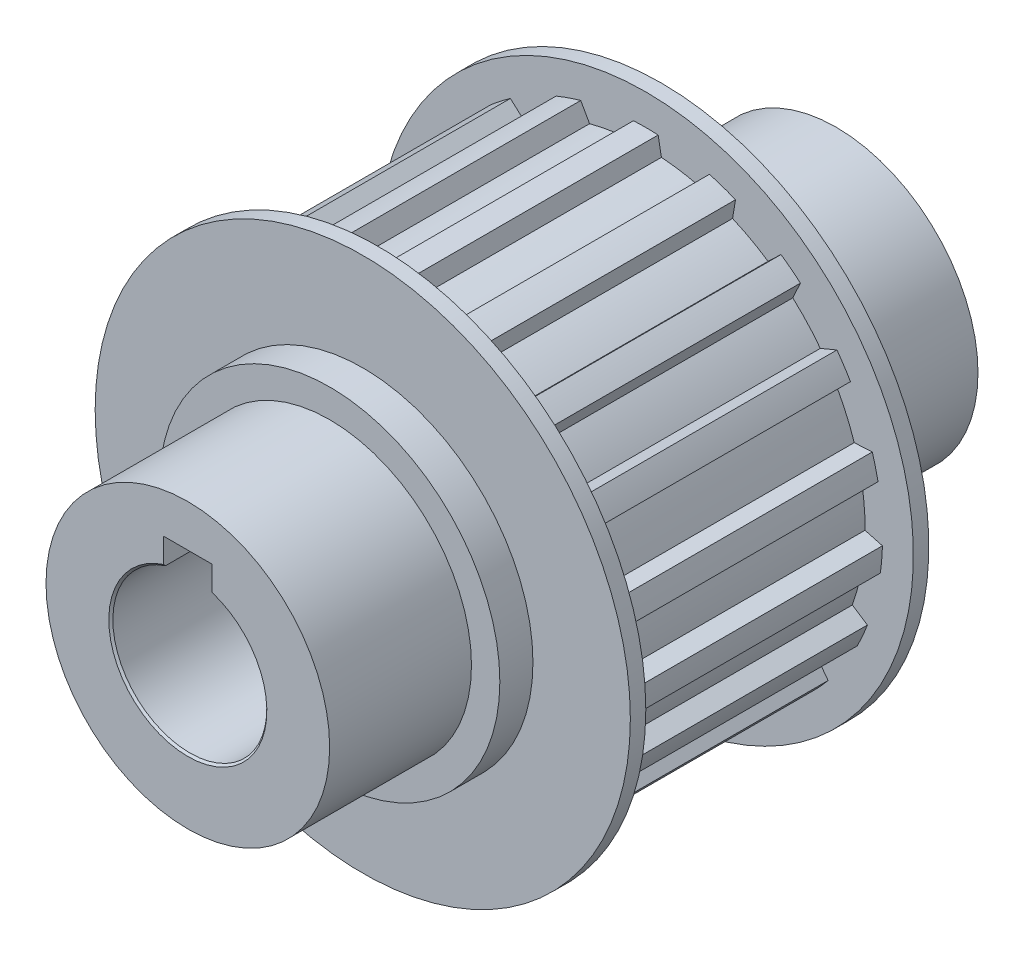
ISO-10303-21;
HEADER;
FILE_DESCRIPTION(('STEP AP214'),'2;1');
FILE_NAME('part.step','',(''),(''),'','','');
FILE_SCHEMA(('AUTOMOTIVE_DESIGN { 1 0 10303 214 1 1 1 1 }'));
ENDSEC;
DATA;
#1=APPLICATION_CONTEXT('core data for automotive mechanical design processes');
#2=APPLICATION_PROTOCOL_DEFINITION('international standard','automotive_design',2000,#1);
#3=PRODUCT_CONTEXT('',#1,'mechanical');
#4=PRODUCT('Part','Part','',(#3));
#5=PRODUCT_RELATED_PRODUCT_CATEGORY('part','',(#4));
#6=PRODUCT_DEFINITION_FORMATION('','',#4);
#7=PRODUCT_DEFINITION_CONTEXT('part definition',#1,'design');
#8=PRODUCT_DEFINITION('design','',#6,#7);
#9=PRODUCT_DEFINITION_SHAPE('','',#8);
#10=(LENGTH_UNIT() NAMED_UNIT(*) SI_UNIT(.MILLI.,.METRE.));
#11=(NAMED_UNIT(*) PLANE_ANGLE_UNIT() SI_UNIT($,.RADIAN.));
#12=(NAMED_UNIT(*) SI_UNIT($,.STERADIAN.) SOLID_ANGLE_UNIT());
#13=UNCERTAINTY_MEASURE_WITH_UNIT(LENGTH_MEASURE(1.E-05),#10,'distance_accuracy_value','');
#14=(GEOMETRIC_REPRESENTATION_CONTEXT(3) GLOBAL_UNCERTAINTY_ASSIGNED_CONTEXT((#13)) GLOBAL_UNIT_ASSIGNED_CONTEXT((#10,
#11,#12)) REPRESENTATION_CONTEXT('',''));
#15=CARTESIAN_POINT('',(0.,0.,0.));
#16=DIRECTION('',(0.,0.,1.));
#17=DIRECTION('',(1.,0.,0.));
#18=AXIS2_PLACEMENT_3D('',#15,#16,#17);
#19=CARTESIAN_POINT('',(0.,0.,0.));
#20=DIRECTION('',(0.,0.,1.));
#21=DIRECTION('',(1.,0.,0.));
#22=AXIS2_PLACEMENT_3D('',#19,#20,#21);
#23=CYLINDRICAL_SURFACE('',#22,29.21);
#24=CARTESIAN_POINT('',(0.,0.,-16.51));
#25=DIRECTION('',(0.,0.,1.));
#26=DIRECTION('',(1.,0.,0.));
#27=AXIS2_PLACEMENT_3D('',#24,#25,#26);
#28=CIRCLE('',#27,29.21);
#29=CARTESIAN_POINT('',(-1.524,29.1702163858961,-16.51));
#30=VERTEX_POINT('',#29);
#31=CARTESIAN_POINT('',(1.524,29.1702163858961,-16.51));
#32=VERTEX_POINT('',#31);
#33=EDGE_CURVE('E532',#30,#32,#28,.F.);
#34=ORIENTED_EDGE('',*,*,#33,.F.);
#35=DIRECTION('',(0.,0.,1.));
#36=VECTOR('',#35,1.);
#37=CARTESIAN_POINT('',(-1.524,29.1702163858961,0.));
#38=LINE('',#37,#36);
#39=CARTESIAN_POINT('',(-1.524,29.1702163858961,16.51));
#40=VERTEX_POINT('',#39);
#41=EDGE_CURVE('E531',#40,#30,#38,.F.);
#42=ORIENTED_EDGE('',*,*,#41,.F.);
#43=CARTESIAN_POINT('',(0.,0.,16.51));
#44=DIRECTION('',(0.,0.,1.));
#45=DIRECTION('',(1.,0.,0.));
#46=AXIS2_PLACEMENT_3D('',#43,#44,#45);
#47=CIRCLE('',#46,29.21);
#48=CARTESIAN_POINT('',(1.524,29.1702163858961,16.51));
#49=VERTEX_POINT('',#48);
#50=EDGE_CURVE('E19',#49,#40,#47,.T.);
#51=ORIENTED_EDGE('',*,*,#50,.F.);
#52=DIRECTION('',(0.,0.,1.));
#53=VECTOR('',#52,1.);
#54=CARTESIAN_POINT('',(1.524,29.1702163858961,0.));
#55=LINE('',#54,#53);
#56=EDGE_CURVE('E513',#32,#49,#55,.T.);
#57=ORIENTED_EDGE('',*,*,#56,.F.);
#58=EDGE_LOOP('',(#34,#42,#51,#57));
#59=FACE_BOUND('',#58,.T.);
#60=ADVANCED_FACE('F15',(#59),#23,.T.);
#61=CARTESIAN_POINT('',(1.524,29.1702163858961,0.));
#62=DIRECTION('',(0.983423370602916,0.181324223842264,0.));
#63=DIRECTION('',(-0.181324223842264,0.983423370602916,0.));
#64=AXIS2_PLACEMENT_3D('',#61,#62,#63);
#65=PLANE('',#64);
#66=DIRECTION('',(0.181324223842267,-0.983423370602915,0.));
#67=VECTOR('',#66,1.);
#68=CARTESIAN_POINT('',(1.524,29.1702163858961,-16.51));
#69=LINE('',#68,#67);
#70=CARTESIAN_POINT('',(1.92741928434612,26.9822464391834,-16.51));
#71=VERTEX_POINT('',#70);
#72=EDGE_CURVE('E929',#32,#71,#69,.T.);
#73=ORIENTED_EDGE('',*,*,#72,.F.);
#74=ORIENTED_EDGE('',*,*,#56,.T.);
#75=DIRECTION('',(-0.181324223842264,0.983423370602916,0.));
#76=VECTOR('',#75,1.);
#77=CARTESIAN_POINT('',(1.92741928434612,26.9822464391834,16.51));
#78=LINE('',#77,#76);
#79=CARTESIAN_POINT('',(1.92741928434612,26.9822464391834,16.51));
#80=VERTEX_POINT('',#79);
#81=EDGE_CURVE('E527',#80,#49,#78,.T.);
#82=ORIENTED_EDGE('',*,*,#81,.F.);
#83=DIRECTION('',(0.,0.,1.));
#84=VECTOR('',#83,1.);
#85=CARTESIAN_POINT('',(1.92741928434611,26.9822464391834,0.));
#86=LINE('',#85,#84);
#87=EDGE_CURVE('E690',#71,#80,#86,.T.);
#88=ORIENTED_EDGE('',*,*,#87,.F.);
#89=EDGE_LOOP('',(#73,#74,#82,#88));
#90=FACE_BOUND('',#89,.T.);
#91=ADVANCED_FACE('F1941',(#90),#65,.T.);
#92=CARTESIAN_POINT('',(0.,0.,0.));
#93=DIRECTION('',(0.,0.,1.));
#94=DIRECTION('',(1.,0.,0.));
#95=AXIS2_PLACEMENT_3D('',#92,#93,#94);
#96=CYLINDRICAL_SURFACE('',#95,27.0509993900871);
#97=CARTESIAN_POINT('',(0.,0.,-16.51));
#98=DIRECTION('',(0.,0.,1.));
#99=DIRECTION('',(1.,0.,0.));
#100=AXIS2_PLACEMENT_3D('',#97,#98,#99);
#101=CIRCLE('',#100,27.0509993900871);
#102=CARTESIAN_POINT('',(6.93813470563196,26.1461059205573,-16.51));
#103=VERTEX_POINT('',#102);
#104=EDGE_CURVE('E927',#71,#103,#101,.F.);
#105=ORIENTED_EDGE('',*,*,#104,.F.);
#106=ORIENTED_EDGE('',*,*,#87,.T.);
#107=CARTESIAN_POINT('',(0.,0.,16.51));
#108=DIRECTION('',(0.,0.,1.));
#109=DIRECTION('',(1.,0.,0.));
#110=AXIS2_PLACEMENT_3D('',#107,#108,#109);
#111=CIRCLE('',#110,27.0509993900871);
#112=CARTESIAN_POINT('',(6.93813470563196,26.1461059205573,16.51));
#113=VERTEX_POINT('',#112);
#114=EDGE_CURVE('E932',#113,#80,#111,.T.);
#115=ORIENTED_EDGE('',*,*,#114,.F.);
#116=DIRECTION('',(0.,0.,1.));
#117=VECTOR('',#116,1.);
#118=CARTESIAN_POINT('',(6.93813470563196,26.1461059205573,0.));
#119=LINE('',#118,#117);
#120=EDGE_CURVE('E688',#103,#113,#119,.T.);
#121=ORIENTED_EDGE('',*,*,#120,.F.);
#122=EDGE_LOOP('',(#105,#106,#115,#121));
#123=FACE_BOUND('',#122,.T.);
#124=ADVANCED_FACE('F1933',(#123),#96,.T.);
#125=CARTESIAN_POINT('',(6.93813470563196,26.1461059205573,0.));
#126=DIRECTION('',(-0.908770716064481,0.417295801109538,0.));
#127=DIRECTION('',(-0.417295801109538,-0.908770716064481,0.));
#128=AXIS2_PLACEMENT_3D('',#125,#126,#127);
#129=PLANE('',#128);
#130=DIRECTION('',(0.417295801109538,0.908770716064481,0.));
#131=VECTOR('',#130,1.);
#132=CARTESIAN_POINT('',(6.93813470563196,26.1461059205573,-16.51));
#133=LINE('',#132,#131);
#134=CARTESIAN_POINT('',(7.85141826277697,28.1350196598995,-16.51));
#135=VERTEX_POINT('',#134);
#136=EDGE_CURVE('E925',#103,#135,#133,.T.);
#137=ORIENTED_EDGE('',*,*,#136,.F.);
#138=ORIENTED_EDGE('',*,*,#120,.T.);
#139=DIRECTION('',(-0.417295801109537,-0.908770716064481,0.));
#140=VECTOR('',#139,1.);
#141=CARTESIAN_POINT('',(7.85141826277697,28.1350196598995,16.51));
#142=LINE('',#141,#140);
#143=CARTESIAN_POINT('',(7.85141826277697,28.1350196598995,16.51));
#144=VERTEX_POINT('',#143);
#145=EDGE_CURVE('E934',#144,#113,#142,.T.);
#146=ORIENTED_EDGE('',*,*,#145,.F.);
#147=DIRECTION('',(0.,0.,1.));
#148=VECTOR('',#147,1.);
#149=CARTESIAN_POINT('',(7.85141826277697,28.1350196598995,0.));
#150=LINE('',#149,#148);
#151=EDGE_CURVE('E686',#135,#144,#150,.T.);
#152=ORIENTED_EDGE('',*,*,#151,.F.);
#153=EDGE_LOOP('',(#137,#138,#146,#152));
#154=FACE_BOUND('',#153,.T.);
#155=ADVANCED_FACE('F1925',(#154),#129,.T.);
#156=CARTESIAN_POINT('',(0.,0.,0.));
#157=DIRECTION('',(0.,0.,1.));
#158=DIRECTION('',(1.,0.,0.));
#159=AXIS2_PLACEMENT_3D('',#156,#157,#158);
#160=CYLINDRICAL_SURFACE('',#159,29.21);
#161=CARTESIAN_POINT('',(0.,0.,-16.51));
#162=DIRECTION('',(0.,0.,1.));
#163=DIRECTION('',(1.,0.,0.));
#164=AXIS2_PLACEMENT_3D('',#161,#162,#163);
#165=CIRCLE('',#164,29.21);
#166=CARTESIAN_POINT('',(11.0725078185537,27.0300512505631,-16.51));
#167=VERTEX_POINT('',#166);
#168=EDGE_CURVE('E923',#135,#167,#165,.F.);
#169=ORIENTED_EDGE('',*,*,#168,.F.);
#170=ORIENTED_EDGE('',*,*,#151,.T.);
#171=CARTESIAN_POINT('',(0.,0.,16.51));
#172=DIRECTION('',(0.,0.,1.));
#173=DIRECTION('',(1.,0.,0.));
#174=AXIS2_PLACEMENT_3D('',#171,#172,#173);
#175=CIRCLE('',#174,29.21);
#176=CARTESIAN_POINT('',(11.0725078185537,27.0300512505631,16.51));
#177=VERTEX_POINT('',#176);
#178=EDGE_CURVE('E935',#177,#144,#175,.T.);
#179=ORIENTED_EDGE('',*,*,#178,.F.);
#180=DIRECTION('',(0.,0.,1.));
#181=VECTOR('',#180,1.);
#182=CARTESIAN_POINT('',(11.0725078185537,27.0300512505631,0.));
#183=LINE('',#182,#181);
#184=EDGE_CURVE('E684',#167,#177,#183,.T.);
#185=ORIENTED_EDGE('',*,*,#184,.F.);
#186=EDGE_LOOP('',(#169,#170,#179,#185));
#187=FACE_BOUND('',#186,.T.);
#188=ADVANCED_FACE('F1917',(#187),#160,.T.);
#189=CARTESIAN_POINT('',(11.0725078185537,27.0300512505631,0.));
#190=DIRECTION('',(0.986361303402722,-0.164594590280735,0.));
#191=DIRECTION('',(0.164594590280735,0.986361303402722,0.));
#192=AXIS2_PLACEMENT_3D('',#189,#190,#191);
#193=PLANE('',#192);
#194=DIRECTION('',(-0.164594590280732,-0.986361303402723,0.));
#195=VECTOR('',#194,1.);
#196=CARTESIAN_POINT('',(11.0725078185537,27.0300512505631,-16.51));
#197=LINE('',#196,#195);
#198=CARTESIAN_POINT('',(10.7073348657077,24.8416897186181,-16.51));
#199=VERTEX_POINT('',#198);
#200=EDGE_CURVE('E921',#167,#199,#197,.T.);
#201=ORIENTED_EDGE('',*,*,#200,.F.);
#202=ORIENTED_EDGE('',*,*,#184,.T.);
#203=DIRECTION('',(0.164594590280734,0.986361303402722,0.));
#204=VECTOR('',#203,1.);
#205=CARTESIAN_POINT('',(10.7073348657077,24.8416897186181,16.51));
#206=LINE('',#205,#204);
#207=CARTESIAN_POINT('',(10.7073348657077,24.8416897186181,16.51));
#208=VERTEX_POINT('',#207);
#209=EDGE_CURVE('E938',#208,#177,#206,.T.);
#210=ORIENTED_EDGE('',*,*,#209,.F.);
#211=DIRECTION('',(0.,0.,1.));
#212=VECTOR('',#211,1.);
#213=CARTESIAN_POINT('',(10.7073348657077,24.8416897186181,0.));
#214=LINE('',#213,#212);
#215=EDGE_CURVE('E682',#199,#208,#214,.T.);
#216=ORIENTED_EDGE('',*,*,#215,.F.);
#217=EDGE_LOOP('',(#201,#202,#210,#216));
#218=FACE_BOUND('',#217,.T.);
#219=ADVANCED_FACE('F1909',(#218),#193,.T.);
#220=CARTESIAN_POINT('',(0.,0.,0.));
#221=DIRECTION('',(0.,0.,1.));
#222=DIRECTION('',(1.,0.,0.));
#223=AXIS2_PLACEMENT_3D('',#220,#221,#222);
#224=CYLINDRICAL_SURFACE('',#223,27.0509993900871);
#225=CARTESIAN_POINT('',(0.,0.,-16.51));
#226=DIRECTION('',(0.,0.,1.));
#227=DIRECTION('',(1.,0.,0.));
#228=AXIS2_PLACEMENT_3D('',#225,#226,#227);
#229=CIRCLE('',#228,27.0509993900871);
#230=CARTESIAN_POINT('',(15.0844039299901,22.4547840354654,-16.51));
#231=VERTEX_POINT('',#230);
#232=EDGE_CURVE('E919',#199,#231,#229,.F.);
#233=ORIENTED_EDGE('',*,*,#232,.F.);
#234=ORIENTED_EDGE('',*,*,#215,.T.);
#235=CARTESIAN_POINT('',(0.,0.,16.51));
#236=DIRECTION('',(0.,0.,1.));
#237=DIRECTION('',(1.,0.,0.));
#238=AXIS2_PLACEMENT_3D('',#235,#236,#237);
#239=CIRCLE('',#238,27.0509993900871);
#240=CARTESIAN_POINT('',(15.0844039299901,22.4547840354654,16.51));
#241=VERTEX_POINT('',#240);
#242=EDGE_CURVE('E939',#241,#208,#239,.T.);
#243=ORIENTED_EDGE('',*,*,#242,.F.);
#244=DIRECTION('',(0.,0.,1.));
#245=VECTOR('',#244,1.);
#246=CARTESIAN_POINT('',(15.0844039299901,22.4547840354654,0.));
#247=LINE('',#246,#245);
#248=EDGE_CURVE('E680',#231,#241,#247,.T.);
#249=ORIENTED_EDGE('',*,*,#248,.F.);
#250=EDGE_LOOP('',(#233,#234,#243,#249));
#251=FACE_BOUND('',#250,.T.);
#252=ADVANCED_FACE('F1901',(#251),#224,.T.);
#253=CARTESIAN_POINT('',(15.0844039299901,22.4547840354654,0.));
#254=DIRECTION('',(-0.689624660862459,0.724166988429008,0.));
#255=DIRECTION('',(-0.724166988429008,-0.689624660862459,0.));
#256=AXIS2_PLACEMENT_3D('',#253,#254,#255);
#257=PLANE('',#256);
#258=DIRECTION('',(0.724166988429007,0.68962466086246,0.));
#259=VECTOR('',#258,1.);
#260=CARTESIAN_POINT('',(15.0844039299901,22.4547840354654,-16.51));
#261=LINE('',#260,#259);
#262=CARTESIAN_POINT('',(16.6829866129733,23.9771152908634,-16.51));
#263=VERTEX_POINT('',#262);
#264=EDGE_CURVE('E917',#231,#263,#261,.T.);
#265=ORIENTED_EDGE('',*,*,#264,.F.);
#266=ORIENTED_EDGE('',*,*,#248,.T.);
#267=DIRECTION('',(-0.724166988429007,-0.689624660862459,0.));
#268=VECTOR('',#267,1.);
#269=CARTESIAN_POINT('',(16.6829866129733,23.9771152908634,16.51));
#270=LINE('',#269,#268);
#271=CARTESIAN_POINT('',(16.6829866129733,23.9771152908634,16.51));
#272=VERTEX_POINT('',#271);
#273=EDGE_CURVE('E942',#272,#241,#270,.T.);
#274=ORIENTED_EDGE('',*,*,#273,.F.);
#275=DIRECTION('',(0.,0.,1.));
#276=VECTOR('',#275,1.);
#277=CARTESIAN_POINT('',(16.6829866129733,23.9771152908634,0.));
#278=LINE('',#277,#276);
#279=EDGE_CURVE('E678',#263,#272,#278,.T.);
#280=ORIENTED_EDGE('',*,*,#279,.F.);
#281=EDGE_LOOP('',(#265,#266,#274,#280));
#282=FACE_BOUND('',#281,.T.);
#283=ADVANCED_FACE('F1893',(#282),#257,.T.);
#284=CARTESIAN_POINT('',(0.,0.,0.));
#285=DIRECTION('',(0.,0.,1.));
#286=DIRECTION('',(1.,0.,0.));
#287=AXIS2_PLACEMENT_3D('',#284,#285,#286);
#288=CYLINDRICAL_SURFACE('',#287,29.21);
#289=CARTESIAN_POINT('',(0.,0.,-16.51));
#290=DIRECTION('',(0.,0.,1.));
#291=DIRECTION('',(1.,0.,0.));
#292=AXIS2_PLACEMENT_3D('',#289,#290,#291);
#293=CIRCLE('',#292,29.21);
#294=CARTESIAN_POINT('',(19.07738962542,22.1196135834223,-16.51));
#295=VERTEX_POINT('',#294);
#296=EDGE_CURVE('E915',#263,#295,#293,.F.);
#297=ORIENTED_EDGE('',*,*,#296,.F.);
#298=ORIENTED_EDGE('',*,*,#279,.T.);
#299=CARTESIAN_POINT('',(0.,0.,16.51));
#300=DIRECTION('',(0.,0.,1.));
#301=DIRECTION('',(1.,0.,0.));
#302=AXIS2_PLACEMENT_3D('',#299,#300,#301);
#303=CIRCLE('',#302,29.21);
#304=CARTESIAN_POINT('',(19.07738962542,22.1196135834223,16.51));
#305=VERTEX_POINT('',#304);
#306=EDGE_CURVE('E943',#305,#272,#303,.T.);
#307=ORIENTED_EDGE('',*,*,#306,.F.);
#308=DIRECTION('',(0.,0.,1.));
#309=VECTOR('',#308,1.);
#310=CARTESIAN_POINT('',(19.07738962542,22.1196135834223,0.));
#311=LINE('',#310,#309);
#312=EDGE_CURVE('E676',#295,#305,#311,.T.);
#313=ORIENTED_EDGE('',*,*,#312,.F.);
#314=EDGE_LOOP('',(#297,#298,#307,#313));
#315=FACE_BOUND('',#314,.T.);
#316=ADVANCED_FACE('F1885',(#315),#288,.T.);
#317=CARTESIAN_POINT('',(19.07738962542,22.1196135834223,0.));
#318=DIRECTION('',(0.908770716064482,-0.417295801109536,0.));
#319=DIRECTION('',(0.417295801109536,0.908770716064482,0.));
#320=AXIS2_PLACEMENT_3D('',#317,#318,#319);
#321=PLANE('',#320);
#322=DIRECTION('',(-0.417295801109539,-0.90877071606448,0.));
#323=VECTOR('',#322,1.);
#324=CARTESIAN_POINT('',(19.07738962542,22.1196135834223,-16.51));
#325=LINE('',#324,#323);
#326=CARTESIAN_POINT('',(18.1364655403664,20.0705053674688,-16.51));
#327=VERTEX_POINT('',#326);
#328=EDGE_CURVE('E913',#295,#327,#325,.T.);
#329=ORIENTED_EDGE('',*,*,#328,.F.);
#330=ORIENTED_EDGE('',*,*,#312,.T.);
#331=DIRECTION('',(0.417295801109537,0.908770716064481,0.));
#332=VECTOR('',#331,1.);
#333=CARTESIAN_POINT('',(18.1364655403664,20.0705053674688,16.51));
#334=LINE('',#333,#332);
#335=CARTESIAN_POINT('',(18.1364655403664,20.0705053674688,16.51));
#336=VERTEX_POINT('',#335);
#337=EDGE_CURVE('E946',#336,#305,#334,.T.);
#338=ORIENTED_EDGE('',*,*,#337,.F.);
#339=DIRECTION('',(0.,0.,1.));
#340=VECTOR('',#339,1.);
#341=CARTESIAN_POINT('',(18.1364655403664,20.0705053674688,0.));
#342=LINE('',#341,#340);
#343=EDGE_CURVE('E674',#327,#336,#342,.T.);
#344=ORIENTED_EDGE('',*,*,#343,.F.);
#345=EDGE_LOOP('',(#329,#330,#338,#344));
#346=FACE_BOUND('',#345,.T.);
#347=ADVANCED_FACE('F1877',(#346),#321,.T.);
#348=CARTESIAN_POINT('',(0.,0.,0.));
#349=DIRECTION('',(0.,0.,1.));
#350=DIRECTION('',(1.,0.,0.));
#351=AXIS2_PLACEMENT_3D('',#348,#349,#350);
#352=CYLINDRICAL_SURFACE('',#351,27.0509993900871);
#353=CARTESIAN_POINT('',(0.,0.,-16.51));
#354=DIRECTION('',(0.,0.,1.));
#355=DIRECTION('',(1.,0.,0.));
#356=AXIS2_PLACEMENT_3D('',#353,#354,#355);
#357=CIRCLE('',#356,27.0509993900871);
#358=CARTESIAN_POINT('',(21.5344337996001,16.3714608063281,-16.51));
#359=VERTEX_POINT('',#358);
#360=EDGE_CURVE('E911',#327,#359,#357,.F.);
#361=ORIENTED_EDGE('',*,*,#360,.F.);
#362=ORIENTED_EDGE('',*,*,#343,.T.);
#363=CARTESIAN_POINT('',(0.,0.,16.51));
#364=DIRECTION('',(0.,0.,1.));
#365=DIRECTION('',(1.,0.,0.));
#366=AXIS2_PLACEMENT_3D('',#363,#364,#365);
#367=CIRCLE('',#366,27.0509993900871);
#368=CARTESIAN_POINT('',(21.5344337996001,16.3714608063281,16.51));
#369=VERTEX_POINT('',#368);
#370=EDGE_CURVE('E947',#369,#336,#367,.T.);
#371=ORIENTED_EDGE('',*,*,#370,.F.);
#372=DIRECTION('',(0.,0.,1.));
#373=VECTOR('',#372,1.);
#374=CARTESIAN_POINT('',(21.5344337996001,16.3714608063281,0.));
#375=LINE('',#374,#373);
#376=EDGE_CURVE('E672',#359,#369,#375,.T.);
#377=ORIENTED_EDGE('',*,*,#376,.F.);
#378=EDGE_LOOP('',(#361,#362,#371,#377));
#379=FACE_BOUND('',#378,.T.);
#380=ADVANCED_FACE('F1869',(#379),#352,.T.);
#381=CARTESIAN_POINT('',(21.5344337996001,16.3714608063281,0.));
#382=DIRECTION('',(-0.3860830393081,0.922464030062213,0.));
#383=DIRECTION('',(-0.922464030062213,-0.3860830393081,0.));
#384=AXIS2_PLACEMENT_3D('',#381,#382,#383);
#385=PLANE('',#384);
#386=DIRECTION('',(0.922464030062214,0.3860830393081,0.));
#387=VECTOR('',#386,1.);
#388=CARTESIAN_POINT('',(21.5344337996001,16.3714608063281,-16.51));
#389=LINE('',#388,#387);
#390=CARTESIAN_POINT('',(23.5867783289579,17.2304378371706,-16.51));
#391=VERTEX_POINT('',#390);
#392=EDGE_CURVE('E909',#359,#391,#389,.T.);
#393=ORIENTED_EDGE('',*,*,#392,.F.);
#394=ORIENTED_EDGE('',*,*,#376,.T.);
#395=DIRECTION('',(-0.922464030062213,-0.3860830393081,0.));
#396=VECTOR('',#395,1.);
#397=CARTESIAN_POINT('',(23.586778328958,17.2304378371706,16.51));
#398=LINE('',#397,#396);
#399=CARTESIAN_POINT('',(23.586778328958,17.2304378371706,16.51));
#400=VERTEX_POINT('',#399);
#401=EDGE_CURVE('E950',#400,#369,#398,.T.);
#402=ORIENTED_EDGE('',*,*,#401,.F.);
#403=DIRECTION('',(0.,0.,1.));
#404=VECTOR('',#403,1.);
#405=CARTESIAN_POINT('',(23.586778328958,17.2304378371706,0.));
#406=LINE('',#405,#404);
#407=EDGE_CURVE('E670',#391,#400,#406,.T.);
#408=ORIENTED_EDGE('',*,*,#407,.F.);
#409=EDGE_LOOP('',(#393,#394,#402,#408));
#410=FACE_BOUND('',#409,.T.);
#411=ADVANCED_FACE('F1861',(#410),#385,.T.);
#412=CARTESIAN_POINT('',(0.,0.,0.));
#413=DIRECTION('',(0.,0.,1.));
#414=DIRECTION('',(1.,0.,0.));
#415=AXIS2_PLACEMENT_3D('',#412,#413,#414);
#416=CYLINDRICAL_SURFACE('',#415,29.21);
#417=CARTESIAN_POINT('',(0.,0.,-16.51));
#418=DIRECTION('',(0.,0.,1.));
#419=DIRECTION('',(1.,0.,0.));
#420=AXIS2_PLACEMENT_3D('',#417,#418,#419);
#421=CIRCLE('',#420,29.21);
#422=CARTESIAN_POINT('',(25.2542665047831,14.6780830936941,-16.51));
#423=VERTEX_POINT('',#422);
#424=EDGE_CURVE('E907',#391,#423,#421,.F.);
#425=ORIENTED_EDGE('',*,*,#424,.F.);
#426=ORIENTED_EDGE('',*,*,#407,.T.);
#427=CARTESIAN_POINT('',(0.,0.,16.51));
#428=DIRECTION('',(0.,0.,1.));
#429=DIRECTION('',(1.,0.,0.));
#430=AXIS2_PLACEMENT_3D('',#427,#428,#429);
#431=CIRCLE('',#430,29.21);
#432=CARTESIAN_POINT('',(25.2542665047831,14.6780830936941,16.51));
#433=VERTEX_POINT('',#432);
#434=EDGE_CURVE('E951',#433,#400,#431,.T.);
#435=ORIENTED_EDGE('',*,*,#434,.F.);
#436=DIRECTION('',(0.,0.,1.));
#437=VECTOR('',#436,1.);
#438=CARTESIAN_POINT('',(25.2542665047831,14.6780830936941,0.));
#439=LINE('',#438,#437);
#440=EDGE_CURVE('E668',#423,#433,#439,.T.);
#441=ORIENTED_EDGE('',*,*,#440,.F.);
#442=EDGE_LOOP('',(#425,#426,#435,#441));
#443=FACE_BOUND('',#442,.T.);
#444=ADVANCED_FACE('F1853',(#443),#416,.T.);
#445=CARTESIAN_POINT('',(25.2542665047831,14.6780830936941,0.));
#446=DIRECTION('',(0.68962466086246,-0.724166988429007,0.));
#447=DIRECTION('',(0.724166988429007,0.68962466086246,0.));
#448=AXIS2_PLACEMENT_3D('',#445,#446,#447);
#449=PLANE('',#448);
#450=DIRECTION('',(-0.724166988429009,-0.689624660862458,0.));
#451=VECTOR('',#450,1.);
#452=CARTESIAN_POINT('',(25.2542665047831,14.6780830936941,-16.51));
#453=LINE('',#452,#451);
#454=CARTESIAN_POINT('',(23.6431241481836,13.1437912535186,-16.51));
#455=VERTEX_POINT('',#454);
#456=EDGE_CURVE('E905',#423,#455,#453,.T.);
#457=ORIENTED_EDGE('',*,*,#456,.F.);
#458=ORIENTED_EDGE('',*,*,#440,.T.);
#459=DIRECTION('',(0.724166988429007,0.689624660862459,0.));
#460=VECTOR('',#459,1.);
#461=CARTESIAN_POINT('',(23.6431241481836,13.1437912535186,16.51));
#462=LINE('',#461,#460);
#463=CARTESIAN_POINT('',(23.6431241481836,13.1437912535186,16.51));
#464=VERTEX_POINT('',#463);
#465=EDGE_CURVE('E954',#464,#433,#462,.T.);
#466=ORIENTED_EDGE('',*,*,#465,.F.);
#467=DIRECTION('',(0.,0.,1.));
#468=VECTOR('',#467,1.);
#469=CARTESIAN_POINT('',(23.6431241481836,13.1437912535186,0.));
#470=LINE('',#469,#468);
#471=EDGE_CURVE('E666',#455,#464,#470,.T.);
#472=ORIENTED_EDGE('',*,*,#471,.F.);
#473=EDGE_LOOP('',(#457,#458,#466,#472));
#474=FACE_BOUND('',#473,.T.);
#475=ADVANCED_FACE('F1845',(#474),#449,.T.);
#476=CARTESIAN_POINT('',(0.,0.,0.));
#477=DIRECTION('',(0.,0.,1.));
#478=DIRECTION('',(1.,0.,0.));
#479=AXIS2_PLACEMENT_3D('',#476,#477,#478);
#480=CYLINDRICAL_SURFACE('',#479,27.0509993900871);
#481=CARTESIAN_POINT('',(0.,0.,-16.51));
#482=DIRECTION('',(0.,0.,1.));
#483=DIRECTION('',(1.,0.,0.));
#484=AXIS2_PLACEMENT_3D('',#481,#482,#483);
#485=CIRCLE('',#484,27.0509993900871);
#486=CARTESIAN_POINT('',(25.7165817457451,8.39130450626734,-16.51));
#487=VERTEX_POINT('',#486);
#488=EDGE_CURVE('E903',#455,#487,#485,.F.);
#489=ORIENTED_EDGE('',*,*,#488,.F.);
#490=ORIENTED_EDGE('',*,*,#471,.T.);
#491=CARTESIAN_POINT('',(0.,0.,16.51));
#492=DIRECTION('',(0.,0.,1.));
#493=DIRECTION('',(1.,0.,0.));
#494=AXIS2_PLACEMENT_3D('',#491,#492,#493);
#495=CIRCLE('',#494,27.0509993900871);
#496=CARTESIAN_POINT('',(25.7165817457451,8.39130450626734,16.51));
#497=VERTEX_POINT('',#496);
#498=EDGE_CURVE('E955',#497,#464,#495,.T.);
#499=ORIENTED_EDGE('',*,*,#498,.F.);
#500=DIRECTION('',(0.,0.,1.));
#501=VECTOR('',#500,1.);
#502=CARTESIAN_POINT('',(25.7165817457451,8.39130450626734,0.));
#503=LINE('',#502,#501);
#504=EDGE_CURVE('E664',#487,#497,#503,.T.);
#505=ORIENTED_EDGE('',*,*,#504,.F.);
#506=EDGE_LOOP('',(#489,#490,#499,#505));
#507=FACE_BOUND('',#506,.T.);
#508=ADVANCED_FACE('F1837',(#507),#480,.T.);
#509=CARTESIAN_POINT('',(25.7165817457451,8.39130450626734,0.));
#510=DIRECTION('',(-0.052173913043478,0.998638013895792,0.));
#511=DIRECTION('',(-0.998638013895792,-0.052173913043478,0.));
#512=AXIS2_PLACEMENT_3D('',#509,#510,#511);
#513=PLANE('',#512);
#514=DIRECTION('',(0.998638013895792,0.0521739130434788,0.));
#515=VECTOR('',#514,1.);
#516=CARTESIAN_POINT('',(25.7165817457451,8.39130450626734,-16.51));
#517=LINE('',#516,#515);
#518=CARTESIAN_POINT('',(27.9435845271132,8.50765442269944,-16.51));
#519=VERTEX_POINT('',#518);
#520=EDGE_CURVE('E901',#487,#519,#517,.T.);
#521=ORIENTED_EDGE('',*,*,#520,.F.);
#522=ORIENTED_EDGE('',*,*,#504,.T.);
#523=DIRECTION('',(-0.998638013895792,-0.0521739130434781,0.));
#524=VECTOR('',#523,1.);
#525=CARTESIAN_POINT('',(27.9435845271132,8.50765442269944,16.51));
#526=LINE('',#525,#524);
#527=CARTESIAN_POINT('',(27.9435845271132,8.50765442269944,16.51));
#528=VERTEX_POINT('',#527);
#529=EDGE_CURVE('E958',#528,#497,#526,.T.);
#530=ORIENTED_EDGE('',*,*,#529,.F.);
#531=DIRECTION('',(0.,0.,1.));
#532=VECTOR('',#531,1.);
#533=CARTESIAN_POINT('',(27.9435845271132,8.50765442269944,0.));
#534=LINE('',#533,#532);
#535=EDGE_CURVE('E662',#519,#528,#534,.T.);
#536=ORIENTED_EDGE('',*,*,#535,.F.);
#537=EDGE_LOOP('',(#521,#522,#530,#536));
#538=FACE_BOUND('',#537,.T.);
#539=ADVANCED_FACE('F1829',(#538),#513,.T.);
#540=CARTESIAN_POINT('',(0.,0.,0.));
#541=DIRECTION('',(0.,0.,1.));
#542=DIRECTION('',(1.,0.,0.));
#543=AXIS2_PLACEMENT_3D('',#540,#541,#542);
#544=CYLINDRICAL_SURFACE('',#543,29.21);
#545=CARTESIAN_POINT('',(0.,0.,-16.51));
#546=DIRECTION('',(0.,0.,1.));
#547=DIRECTION('',(1.,0.,0.));
#548=AXIS2_PLACEMENT_3D('',#545,#546,#547);
#549=CIRCLE('',#548,29.21);
#550=CARTESIAN_POINT('',(28.6517354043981,5.68349877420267,-16.51));
#551=VERTEX_POINT('',#550);
#552=EDGE_CURVE('E899',#519,#551,#549,.F.);
#553=ORIENTED_EDGE('',*,*,#552,.F.);
#554=ORIENTED_EDGE('',*,*,#535,.T.);
#555=CARTESIAN_POINT('',(0.,0.,16.51));
#556=DIRECTION('',(0.,0.,1.));
#557=DIRECTION('',(1.,0.,0.));
#558=AXIS2_PLACEMENT_3D('',#555,#556,#557);
#559=CIRCLE('',#558,29.21);
#560=CARTESIAN_POINT('',(28.651735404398,5.68349877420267,16.51));
#561=VERTEX_POINT('',#560);
#562=EDGE_CURVE('E959',#561,#528,#559,.T.);
#563=ORIENTED_EDGE('',*,*,#562,.F.);
#564=DIRECTION('',(0.,0.,1.));
#565=VECTOR('',#564,1.);
#566=CARTESIAN_POINT('',(28.6517354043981,5.68349877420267,0.));
#567=LINE('',#566,#565);
#568=EDGE_CURVE('E660',#551,#561,#567,.T.);
#569=ORIENTED_EDGE('',*,*,#568,.F.);
#570=EDGE_LOOP('',(#553,#554,#563,#569));
#571=FACE_BOUND('',#570,.T.);
#572=ADVANCED_FACE('F1821',(#571),#544,.T.);
#573=CARTESIAN_POINT('',(28.6517354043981,5.68349877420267,0.));
#574=DIRECTION('',(0.417191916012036,-0.908818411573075,0.));
#575=DIRECTION('',(0.908818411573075,0.417191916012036,0.));
#576=AXIS2_PLACEMENT_3D('',#573,#574,#575);
#577=PLANE('',#576);
#578=DIRECTION('',(-0.908818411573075,-0.417191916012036,0.));
#579=VECTOR('',#578,1.);
#580=CARTESIAN_POINT('',(28.6517354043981,5.68349877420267,-16.51));
#581=LINE('',#580,#579);
#582=CARTESIAN_POINT('',(26.6297503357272,4.7553091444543,-16.51));
#583=VERTEX_POINT('',#582);
#584=EDGE_CURVE('E897',#551,#583,#581,.T.);
#585=ORIENTED_EDGE('',*,*,#584,.F.);
#586=ORIENTED_EDGE('',*,*,#568,.T.);
#587=DIRECTION('',(0.908818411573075,0.417191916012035,0.));
#588=VECTOR('',#587,1.);
#589=CARTESIAN_POINT('',(26.6297503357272,4.7553091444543,16.51));
#590=LINE('',#589,#588);
#591=CARTESIAN_POINT('',(26.6297503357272,4.7553091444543,16.51));
#592=VERTEX_POINT('',#591);
#593=EDGE_CURVE('E962',#592,#561,#590,.T.);
#594=ORIENTED_EDGE('',*,*,#593,.F.);
#595=DIRECTION('',(0.,0.,1.));
#596=VECTOR('',#595,1.);
#597=CARTESIAN_POINT('',(26.6297503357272,4.7553091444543,0.));
#598=LINE('',#597,#596);
#599=EDGE_CURVE('E658',#583,#592,#598,.T.);
#600=ORIENTED_EDGE('',*,*,#599,.F.);
#601=EDGE_LOOP('',(#585,#586,#594,#600));
#602=FACE_BOUND('',#601,.T.);
#603=ADVANCED_FACE('F1813',(#602),#577,.T.);
#604=CARTESIAN_POINT('',(0.,0.,0.));
#605=DIRECTION('',(0.,0.,1.));
#606=DIRECTION('',(1.,0.,0.));
#607=AXIS2_PLACEMENT_3D('',#604,#605,#606);
#608=CYLINDRICAL_SURFACE('',#607,27.0509993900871);
#609=CARTESIAN_POINT('',(0.,0.,-16.51));
#610=DIRECTION('',(0.,0.,1.));
#611=DIRECTION('',(1.,0.,0.));
#612=AXIS2_PLACEMENT_3D('',#609,#610,#611);
#613=CIRCLE('',#612,27.0509993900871);
#614=CARTESIAN_POINT('',(27.0492602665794,-0.30673609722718,-16.51));
#615=VERTEX_POINT('',#614);
#616=EDGE_CURVE('E895',#583,#615,#613,.F.);
#617=ORIENTED_EDGE('',*,*,#616,.F.);
#618=ORIENTED_EDGE('',*,*,#599,.T.);
#619=CARTESIAN_POINT('',(0.,0.,16.51));
#620=DIRECTION('',(0.,0.,1.));
#621=DIRECTION('',(1.,0.,0.));
#622=AXIS2_PLACEMENT_3D('',#619,#620,#621);
#623=CIRCLE('',#622,27.0509993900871);
#624=CARTESIAN_POINT('',(27.0492602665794,-0.306736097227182,16.51));
#625=VERTEX_POINT('',#624);
#626=EDGE_CURVE('E963',#625,#592,#623,.T.);
#627=ORIENTED_EDGE('',*,*,#626,.F.);
#628=DIRECTION('',(0.,0.,1.));
#629=VECTOR('',#628,1.);
#630=CARTESIAN_POINT('',(27.0492602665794,-0.306736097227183,0.));
#631=LINE('',#630,#629);
#632=EDGE_CURVE('E656',#615,#625,#631,.T.);
#633=ORIENTED_EDGE('',*,*,#632,.F.);
#634=EDGE_LOOP('',(#617,#618,#627,#633));
#635=FACE_BOUND('',#634,.T.);
#636=ADVANCED_FACE('F1805',(#635),#608,.T.);
#637=CARTESIAN_POINT('',(27.0492602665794,-0.306736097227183,0.));
#638=DIRECTION('',(0.261841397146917,0.965110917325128,0.));
#639=DIRECTION('',(-0.965110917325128,0.261841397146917,0.));
#640=AXIS2_PLACEMENT_3D('',#637,#638,#639);
#641=PLANE('',#640);
#642=DIRECTION('',(0.965110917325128,-0.261841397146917,0.));
#643=VECTOR('',#642,1.);
#644=CARTESIAN_POINT('',(27.0492602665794,-0.30673609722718,-16.51));
#645=LINE('',#644,#643);
#646=CARTESIAN_POINT('',(29.1964598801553,-0.889286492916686,-16.51));
#647=VERTEX_POINT('',#646);
#648=EDGE_CURVE('E893',#615,#647,#645,.T.);
#649=ORIENTED_EDGE('',*,*,#648,.F.);
#650=ORIENTED_EDGE('',*,*,#632,.T.);
#651=DIRECTION('',(-0.965110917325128,0.261841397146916,0.));
#652=VECTOR('',#651,1.);
#653=CARTESIAN_POINT('',(29.1964598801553,-0.889286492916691,16.51));
#654=LINE('',#653,#652);
#655=CARTESIAN_POINT('',(29.1964598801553,-0.889286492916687,16.51));
#656=VERTEX_POINT('',#655);
#657=EDGE_CURVE('E966',#656,#625,#654,.T.);
#658=ORIENTED_EDGE('',*,*,#657,.F.);
#659=DIRECTION('',(0.,0.,1.));
#660=VECTOR('',#659,1.);
#661=CARTESIAN_POINT('',(29.1964598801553,-0.889286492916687,0.));
#662=LINE('',#661,#660);
#663=EDGE_CURVE('E654',#647,#656,#662,.T.);
#664=ORIENTED_EDGE('',*,*,#663,.F.);
#665=EDGE_LOOP('',(#649,#650,#658,#664));
#666=FACE_BOUND('',#665,.T.);
#667=ADVANCED_FACE('F1797',(#666),#641,.T.);
#668=CARTESIAN_POINT('',(0.,0.,0.));
#669=DIRECTION('',(0.,0.,1.));
#670=DIRECTION('',(1.,0.,0.));
#671=AXIS2_PLACEMENT_3D('',#668,#669,#670);
#672=CYLINDRICAL_SURFACE('',#671,29.21);
#673=CARTESIAN_POINT('',(0.,0.,-16.51));
#674=DIRECTION('',(0.,0.,1.));
#675=DIRECTION('',(1.,0.,0.));
#676=AXIS2_PLACEMENT_3D('',#673,#674,#675);
#677=CIRCLE('',#676,29.21);
#678=CARTESIAN_POINT('',(28.9447343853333,-3.92765214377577,-16.51));
#679=VERTEX_POINT('',#678);
#680=EDGE_CURVE('E891',#647,#679,#677,.F.);
#681=ORIENTED_EDGE('',*,*,#680,.F.);
#682=ORIENTED_EDGE('',*,*,#663,.T.);
#683=CARTESIAN_POINT('',(0.,0.,16.51));
#684=DIRECTION('',(0.,0.,1.));
#685=DIRECTION('',(1.,0.,0.));
#686=AXIS2_PLACEMENT_3D('',#683,#684,#685);
#687=CIRCLE('',#686,29.21);
#688=CARTESIAN_POINT('',(28.9447343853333,-3.92765214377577,16.51));
#689=VERTEX_POINT('',#688);
#690=EDGE_CURVE('E967',#689,#656,#687,.T.);
#691=ORIENTED_EDGE('',*,*,#690,.F.);
#692=DIRECTION('',(0.,0.,1.));
#693=VECTOR('',#692,1.);
#694=CARTESIAN_POINT('',(28.9447343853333,-3.92765214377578,0.));
#695=LINE('',#694,#693);
#696=EDGE_CURVE('E652',#679,#689,#695,.T.);
#697=ORIENTED_EDGE('',*,*,#696,.F.);
#698=EDGE_LOOP('',(#681,#682,#691,#697));
#699=FACE_BOUND('',#698,.T.);
#700=ADVANCED_FACE('F1789',(#699),#672,.T.);
#701=CARTESIAN_POINT('',(28.9447343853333,-3.92765214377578,0.));
#702=DIRECTION('',(0.071251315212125,-0.997458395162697,0.));
#703=DIRECTION('',(0.997458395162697,0.071251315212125,0.));
#704=AXIS2_PLACEMENT_3D('',#701,#702,#703);
#705=PLANE('',#704);
#706=DIRECTION('',(-0.997458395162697,-0.0712513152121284,0.));
#707=VECTOR('',#706,1.);
#708=CARTESIAN_POINT('',(28.9447343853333,-3.92765214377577,-16.51));
#709=LINE('',#708,#707);
#710=CARTESIAN_POINT('',(26.7407671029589,-4.08508785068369,-16.51));
#711=VERTEX_POINT('',#710);
#712=EDGE_CURVE('E889',#679,#711,#709,.T.);
#713=ORIENTED_EDGE('',*,*,#712,.F.);
#714=ORIENTED_EDGE('',*,*,#696,.T.);
#715=DIRECTION('',(0.997458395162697,0.0712513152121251,0.));
#716=VECTOR('',#715,1.);
#717=CARTESIAN_POINT('',(26.7407671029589,-4.08508785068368,16.51));
#718=LINE('',#717,#716);
#719=CARTESIAN_POINT('',(26.7407671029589,-4.08508785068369,16.51));
#720=VERTEX_POINT('',#719);
#721=EDGE_CURVE('E970',#720,#689,#718,.T.);
#722=ORIENTED_EDGE('',*,*,#721,.F.);
#723=DIRECTION('',(0.,0.,1.));
#724=VECTOR('',#723,1.);
#725=CARTESIAN_POINT('',(26.7407671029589,-4.08508785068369,0.));
#726=LINE('',#725,#724);
#727=EDGE_CURVE('E650',#711,#720,#726,.T.);
#728=ORIENTED_EDGE('',*,*,#727,.F.);
#729=EDGE_LOOP('',(#713,#714,#722,#728));
#730=FACE_BOUND('',#729,.T.);
#731=ADVANCED_FACE('F1781',(#730),#705,.T.);
#732=CARTESIAN_POINT('',(0.,0.,0.));
#733=DIRECTION('',(0.,0.,1.));
#734=DIRECTION('',(1.,0.,0.));
#735=AXIS2_PLACEMENT_3D('',#732,#733,#734);
#736=CYLINDRICAL_SURFACE('',#735,27.0509993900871);
#737=CARTESIAN_POINT('',(0.,0.,-16.51));
#738=DIRECTION('',(0.,0.,1.));
#739=DIRECTION('',(1.,0.,0.));
#740=AXIS2_PLACEMENT_3D('',#737,#738,#739);
#741=CIRCLE('',#740,27.0509993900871);
#742=CARTESIAN_POINT('',(25.4838570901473,-9.0735657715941,-16.51));
#743=VERTEX_POINT('',#742);
#744=EDGE_CURVE('E887',#711,#743,#741,.F.);
#745=ORIENTED_EDGE('',*,*,#744,.F.);
#746=ORIENTED_EDGE('',*,*,#727,.T.);
#747=CARTESIAN_POINT('',(0.,0.,16.51));
#748=DIRECTION('',(0.,0.,1.));
#749=DIRECTION('',(1.,0.,0.));
#750=AXIS2_PLACEMENT_3D('',#747,#748,#749);
#751=CIRCLE('',#750,27.0509993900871);
#752=CARTESIAN_POINT('',(25.4838570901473,-9.0735657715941,16.51));
#753=VERTEX_POINT('',#752);
#754=EDGE_CURVE('E971',#753,#720,#751,.T.);
#755=ORIENTED_EDGE('',*,*,#754,.F.);
#756=DIRECTION('',(0.,0.,1.));
#757=VECTOR('',#756,1.);
#758=CARTESIAN_POINT('',(25.4838570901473,-9.0735657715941,0.));
#759=LINE('',#758,#757);
#760=EDGE_CURVE('E648',#743,#753,#759,.T.);
#761=ORIENTED_EDGE('',*,*,#760,.F.);
#762=EDGE_LOOP('',(#745,#746,#755,#761));
#763=FACE_BOUND('',#762,.T.);
#764=ADVANCED_FACE('F1773',(#763),#736,.T.);
#765=CARTESIAN_POINT('',(25.4838570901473,-9.0735657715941,0.));
#766=DIRECTION('',(0.547252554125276,0.836967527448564,0.));
#767=DIRECTION('',(-0.836967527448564,0.547252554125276,0.));
#768=AXIS2_PLACEMENT_3D('',#765,#766,#767);
#769=PLANE('',#768);
#770=DIRECTION('',(0.836967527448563,-0.547252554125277,0.));
#771=VECTOR('',#770,1.);
#772=CARTESIAN_POINT('',(25.4838570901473,-9.0735657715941,-16.51));
#773=LINE('',#772,#771);
#774=CARTESIAN_POINT('',(27.3388530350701,-10.2864578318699,-16.51));
#775=VERTEX_POINT('',#774);
#776=EDGE_CURVE('E885',#743,#775,#773,.T.);
#777=ORIENTED_EDGE('',*,*,#776,.F.);
#778=ORIENTED_EDGE('',*,*,#760,.T.);
#779=DIRECTION('',(-0.836967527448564,0.547252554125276,0.));
#780=VECTOR('',#779,1.);
#781=CARTESIAN_POINT('',(27.3388530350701,-10.2864578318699,16.51));
#782=LINE('',#781,#780);
#783=CARTESIAN_POINT('',(27.3388530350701,-10.2864578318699,16.51));
#784=VERTEX_POINT('',#783);
#785=EDGE_CURVE('E974',#784,#753,#782,.T.);
#786=ORIENTED_EDGE('',*,*,#785,.F.);
#787=DIRECTION('',(0.,0.,1.));
#788=VECTOR('',#787,1.);
#789=CARTESIAN_POINT('',(27.3388530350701,-10.2864578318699,0.));
#790=LINE('',#789,#788);
#791=EDGE_CURVE('E646',#775,#784,#790,.T.);
#792=ORIENTED_EDGE('',*,*,#791,.F.);
#793=EDGE_LOOP('',(#777,#778,#786,#792));
#794=FACE_BOUND('',#793,.T.);
#795=ADVANCED_FACE('F1765',(#794),#769,.T.);
#796=CARTESIAN_POINT('',(0.,0.,0.));
#797=DIRECTION('',(0.,0.,1.));
#798=DIRECTION('',(1.,0.,0.));
#799=AXIS2_PLACEMENT_3D('',#796,#797,#798);
#800=CYLINDRICAL_SURFACE('',#799,29.21);
#801=CARTESIAN_POINT('',(0.,0.,-16.51));
#802=DIRECTION('',(0.,0.,1.));
#803=DIRECTION('',(1.,0.,0.));
#804=AXIS2_PLACEMENT_3D('',#801,#802,#803);
#805=CIRCLE('',#804,29.21);
#806=CARTESIAN_POINT('',(26.084094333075,-13.1470195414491,-16.51));
#807=VERTEX_POINT('',#806);
#808=EDGE_CURVE('E883',#775,#807,#805,.F.);
#809=ORIENTED_EDGE('',*,*,#808,.F.);
#810=ORIENTED_EDGE('',*,*,#791,.T.);
#811=CARTESIAN_POINT('',(0.,0.,16.51));
#812=DIRECTION('',(0.,0.,1.));
#813=DIRECTION('',(1.,0.,0.));
#814=AXIS2_PLACEMENT_3D('',#811,#812,#813);
#815=CIRCLE('',#814,29.21);
#816=CARTESIAN_POINT('',(26.084094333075,-13.1470195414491,16.51));
#817=VERTEX_POINT('',#816);
#818=EDGE_CURVE('E975',#817,#784,#815,.T.);
#819=ORIENTED_EDGE('',*,*,#818,.F.);
#820=DIRECTION('',(0.,0.,1.));
#821=VECTOR('',#820,1.);
#822=CARTESIAN_POINT('',(26.084094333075,-13.1470195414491,0.));
#823=LINE('',#822,#821);
#824=EDGE_CURVE('E644',#807,#817,#823,.T.);
#825=ORIENTED_EDGE('',*,*,#824,.F.);
#826=EDGE_LOOP('',(#809,#810,#819,#825));
#827=FACE_BOUND('',#826,.T.);
#828=ADVANCED_FACE('F1757',(#827),#800,.T.);
#829=CARTESIAN_POINT('',(26.084094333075,-13.1470195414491,0.));
#830=DIRECTION('',(-0.261841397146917,-0.965110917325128,0.));
#831=DIRECTION('',(0.965110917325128,-0.261841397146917,0.));
#832=AXIS2_PLACEMENT_3D('',#829,#830,#831);
#833=PLANE('',#832);
#834=DIRECTION('',(-0.965110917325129,0.261841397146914,0.));
#835=VECTOR('',#834,1.);
#836=CARTESIAN_POINT('',(26.084094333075,-13.1470195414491,-16.51));
#837=LINE('',#836,#835);
#838=CARTESIAN_POINT('',(23.9536332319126,-12.5690104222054,-16.51));
#839=VERTEX_POINT('',#838);
#840=EDGE_CURVE('E881',#807,#839,#837,.T.);
#841=ORIENTED_EDGE('',*,*,#840,.F.);
#842=ORIENTED_EDGE('',*,*,#824,.T.);
#843=DIRECTION('',(0.965110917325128,-0.261841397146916,0.));
#844=VECTOR('',#843,1.);
#845=CARTESIAN_POINT('',(23.9536332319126,-12.5690104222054,16.51));
#846=LINE('',#845,#844);
#847=CARTESIAN_POINT('',(23.9536332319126,-12.5690104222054,16.51));
#848=VERTEX_POINT('',#847);
#849=EDGE_CURVE('E978',#848,#817,#846,.T.);
#850=ORIENTED_EDGE('',*,*,#849,.F.);
#851=DIRECTION('',(0.,0.,1.));
#852=VECTOR('',#851,1.);
#853=CARTESIAN_POINT('',(23.9536332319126,-12.5690104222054,0.));
#854=LINE('',#853,#852);
#855=EDGE_CURVE('E642',#839,#848,#854,.T.);
#856=ORIENTED_EDGE('',*,*,#855,.F.);
#857=EDGE_LOOP('',(#841,#842,#850,#856));
#858=FACE_BOUND('',#857,.T.);
#859=ADVANCED_FACE('F1749',(#858),#833,.T.);
#860=CARTESIAN_POINT('',(0.,0.,0.));
#861=DIRECTION('',(0.,0.,1.));
#862=DIRECTION('',(1.,0.,0.));
#863=AXIS2_PLACEMENT_3D('',#860,#861,#862);
#864=CYLINDRICAL_SURFACE('',#863,27.0509993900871);
#865=CARTESIAN_POINT('',(0.,0.,-16.51));
#866=DIRECTION('',(0.,0.,1.));
#867=DIRECTION('',(1.,0.,0.));
#868=AXIS2_PLACEMENT_3D('',#865,#866,#867);
#869=CIRCLE('',#868,27.0509993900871);
#870=CARTESIAN_POINT('',(21.1568894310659,-16.8565298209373,-16.51));
#871=VERTEX_POINT('',#870);
#872=EDGE_CURVE('E879',#839,#871,#869,.F.);
#873=ORIENTED_EDGE('',*,*,#872,.F.);
#874=ORIENTED_EDGE('',*,*,#855,.T.);
#875=CARTESIAN_POINT('',(0.,0.,16.51));
#876=DIRECTION('',(0.,0.,1.));
#877=DIRECTION('',(1.,0.,0.));
#878=AXIS2_PLACEMENT_3D('',#875,#876,#877);
#879=CIRCLE('',#878,27.0509993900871);
#880=CARTESIAN_POINT('',(21.1568894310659,-16.8565298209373,16.51));
#881=VERTEX_POINT('',#880);
#882=EDGE_CURVE('E979',#881,#848,#879,.T.);
#883=ORIENTED_EDGE('',*,*,#882,.F.);
#884=DIRECTION('',(0.,0.,1.));
#885=VECTOR('',#884,1.);
#886=CARTESIAN_POINT('',(21.1568894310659,-16.8565298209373,0.));
#887=LINE('',#886,#885);
#888=EDGE_CURVE('E640',#871,#881,#887,.T.);
#889=ORIENTED_EDGE('',*,*,#888,.F.);
#890=EDGE_LOOP('',(#873,#874,#883,#889));
#891=FACE_BOUND('',#890,.T.);
#892=ADVANCED_FACE('F1741',(#891),#864,.T.);
#893=CARTESIAN_POINT('',(21.1568894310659,-16.8565298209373,0.));
#894=DIRECTION('',(0.799459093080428,0.600720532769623,0.));
#895=DIRECTION('',(-0.600720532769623,0.799459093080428,0.));
#896=AXIS2_PLACEMENT_3D('',#893,#894,#895);
#897=PLANE('',#896);
#898=DIRECTION('',(0.600720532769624,-0.799459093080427,0.));
#899=VECTOR('',#898,1.);
#900=CARTESIAN_POINT('',(21.1568894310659,-16.8565298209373,-16.51));
#901=LINE('',#900,#899);
#902=CARTESIAN_POINT('',(22.4934027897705,-18.6352067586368,-16.51));
#903=VERTEX_POINT('',#902);
#904=EDGE_CURVE('E877',#871,#903,#901,.T.);
#905=ORIENTED_EDGE('',*,*,#904,.F.);
#906=ORIENTED_EDGE('',*,*,#888,.T.);
#907=DIRECTION('',(-0.600720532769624,0.799459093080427,0.));
#908=VECTOR('',#907,1.);
#909=CARTESIAN_POINT('',(22.4934027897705,-18.6352067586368,16.51));
#910=LINE('',#909,#908);
#911=CARTESIAN_POINT('',(22.4934027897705,-18.6352067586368,16.51));
#912=VERTEX_POINT('',#911);
#913=EDGE_CURVE('E982',#912,#881,#910,.T.);
#914=ORIENTED_EDGE('',*,*,#913,.F.);
#915=DIRECTION('',(0.,0.,1.));
#916=VECTOR('',#915,1.);
#917=CARTESIAN_POINT('',(22.4934027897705,-18.6352067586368,0.));
#918=LINE('',#917,#916);
#919=EDGE_CURVE('E638',#903,#912,#918,.T.);
#920=ORIENTED_EDGE('',*,*,#919,.F.);
#921=EDGE_LOOP('',(#905,#906,#914,#920));
#922=FACE_BOUND('',#921,.T.);
#923=ADVANCED_FACE('F1733',(#922),#897,.T.);
#924=CARTESIAN_POINT('',(0.,0.,0.));
#925=DIRECTION('',(0.,0.,1.));
#926=DIRECTION('',(1.,0.,0.));
#927=AXIS2_PLACEMENT_3D('',#924,#925,#926);
#928=CYLINDRICAL_SURFACE('',#927,29.21);
#929=CARTESIAN_POINT('',(0.,0.,-16.51));
#930=DIRECTION('',(0.,0.,1.));
#931=DIRECTION('',(1.,0.,0.));
#932=AXIS2_PLACEMENT_3D('',#929,#930,#931);
#933=CIRCLE('',#932,29.21);
#934=CARTESIAN_POINT('',(20.4290485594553,-20.8776932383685,-16.51));
#935=VERTEX_POINT('',#934);
#936=EDGE_CURVE('E875',#903,#935,#933,.F.);
#937=ORIENTED_EDGE('',*,*,#936,.F.);
#938=ORIENTED_EDGE('',*,*,#919,.T.);
#939=CARTESIAN_POINT('',(0.,0.,16.51));
#940=DIRECTION('',(0.,0.,1.));
#941=DIRECTION('',(1.,0.,0.));
#942=AXIS2_PLACEMENT_3D('',#939,#940,#941);
#943=CIRCLE('',#942,29.21);
#944=CARTESIAN_POINT('',(20.4290485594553,-20.8776932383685,16.51));
#945=VERTEX_POINT('',#944);
#946=EDGE_CURVE('E983',#945,#912,#943,.T.);
#947=ORIENTED_EDGE('',*,*,#946,.F.);
#948=DIRECTION('',(0.,0.,1.));
#949=VECTOR('',#948,1.);
#950=CARTESIAN_POINT('',(20.4290485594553,-20.8776932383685,0.));
#951=LINE('',#950,#949);
#952=EDGE_CURVE('E636',#935,#945,#951,.T.);
#953=ORIENTED_EDGE('',*,*,#952,.F.);
#954=EDGE_LOOP('',(#937,#938,#947,#953));
#955=FACE_BOUND('',#954,.T.);
#956=ADVANCED_FACE('F1725',(#955),#928,.T.);
#957=CARTESIAN_POINT('',(20.4290485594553,-20.8776932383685,0.));
#958=DIRECTION('',(-0.532649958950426,-0.846335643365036,0.));
#959=DIRECTION('',(0.846335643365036,-0.532649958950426,0.));
#960=AXIS2_PLACEMENT_3D('',#957,#958,#959);
#961=PLANE('',#960);
#962=DIRECTION('',(-0.846335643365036,0.532649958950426,0.));
#963=VECTOR('',#962,1.);
#964=CARTESIAN_POINT('',(20.4290485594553,-20.8776932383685,-16.51));
#965=LINE('',#964,#963);
#966=CARTESIAN_POINT('',(18.5460783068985,-19.6926267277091,-16.51));
#967=VERTEX_POINT('',#966);
#968=EDGE_CURVE('E873',#935,#967,#965,.T.);
#969=ORIENTED_EDGE('',*,*,#968,.F.);
#970=ORIENTED_EDGE('',*,*,#952,.T.);
#971=DIRECTION('',(0.846335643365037,-0.532649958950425,0.));
#972=VECTOR('',#971,1.);
#973=CARTESIAN_POINT('',(18.5460783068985,-19.6926267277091,16.51));
#974=LINE('',#973,#972);
#975=CARTESIAN_POINT('',(18.5460783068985,-19.6926267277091,16.51));
#976=VERTEX_POINT('',#975);
#977=EDGE_CURVE('E986',#976,#945,#974,.T.);
#978=ORIENTED_EDGE('',*,*,#977,.F.);
#979=DIRECTION('',(0.,0.,1.));
#980=VECTOR('',#979,1.);
#981=CARTESIAN_POINT('',(18.5460783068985,-19.6926267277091,0.));
#982=LINE('',#981,#980);
#983=EDGE_CURVE('E634',#967,#976,#982,.T.);
#984=ORIENTED_EDGE('',*,*,#983,.F.);
#985=EDGE_LOOP('',(#969,#970,#978,#984));
#986=FACE_BOUND('',#985,.T.);
#987=ADVANCED_FACE('F1717',(#986),#961,.T.);
#988=CARTESIAN_POINT('',(0.,0.,0.));
#989=DIRECTION('',(0.,0.,1.));
#990=DIRECTION('',(1.,0.,0.));
#991=AXIS2_PLACEMENT_3D('',#988,#989,#990);
#992=CYLINDRICAL_SURFACE('',#991,27.0509993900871);
#993=CARTESIAN_POINT('',(0.,0.,-16.51));
#994=DIRECTION('',(0.,0.,1.));
#995=DIRECTION('',(1.,0.,0.));
#996=AXIS2_PLACEMENT_3D('',#993,#994,#995);
#997=CIRCLE('',#996,27.0509993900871);
#998=CARTESIAN_POINT('',(14.5372445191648,-22.8128273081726,-16.51));
#999=VERTEX_POINT('',#998);
#1000=EDGE_CURVE('E871',#967,#999,#997,.F.);
#1001=ORIENTED_EDGE('',*,*,#1000,.F.);
#1002=ORIENTED_EDGE('',*,*,#983,.T.);
#1003=CARTESIAN_POINT('',(0.,0.,16.51));
#1004=DIRECTION('',(0.,0.,1.));
#1005=DIRECTION('',(1.,0.,0.));
#1006=AXIS2_PLACEMENT_3D('',#1003,#1004,#1005);
#1007=CIRCLE('',#1006,27.0509993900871);
#1008=CARTESIAN_POINT('',(14.5372445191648,-22.8128273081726,16.51));
#1009=VERTEX_POINT('',#1008);
#1010=EDGE_CURVE('E987',#1009,#976,#1007,.T.);
#1011=ORIENTED_EDGE('',*,*,#1010,.F.);
#1012=DIRECTION('',(0.,0.,1.));
#1013=VECTOR('',#1012,1.);
#1014=CARTESIAN_POINT('',(14.5372445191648,-22.8128273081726,0.));
#1015=LINE('',#1014,#1013);
#1016=EDGE_CURVE('E632',#999,#1009,#1015,.T.);
#1017=ORIENTED_EDGE('',*,*,#1016,.F.);
#1018=EDGE_LOOP('',(#1001,#1002,#1011,#1017));
#1019=FACE_BOUND('',#1018,.T.);
#1020=ADVANCED_FACE('F1709',(#1019),#992,.T.);
#1021=CARTESIAN_POINT('',(14.5372445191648,-22.8128273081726,0.));
#1022=DIRECTION('',(0.951195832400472,0.308587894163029,0.));
#1023=DIRECTION('',(-0.308587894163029,0.951195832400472,0.));
#1024=AXIS2_PLACEMENT_3D('',#1021,#1022,#1023);
#1025=PLANE('',#1024);
#1026=DIRECTION('',(0.30858789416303,-0.951195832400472,0.));
#1027=VECTOR('',#1026,1.);
#1028=CARTESIAN_POINT('',(14.5372445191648,-22.8128273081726,-16.51));
#1029=LINE('',#1028,#1027);
#1030=CARTESIAN_POINT('',(15.2238064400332,-24.9290958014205,-16.51));
#1031=VERTEX_POINT('',#1030);
#1032=EDGE_CURVE('E869',#999,#1031,#1029,.T.);
#1033=ORIENTED_EDGE('',*,*,#1032,.F.);
#1034=ORIENTED_EDGE('',*,*,#1016,.T.);
#1035=DIRECTION('',(-0.30858789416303,0.951195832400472,0.));
#1036=VECTOR('',#1035,1.);
#1037=CARTESIAN_POINT('',(15.2238064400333,-24.9290958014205,16.51));
#1038=LINE('',#1037,#1036);
#1039=CARTESIAN_POINT('',(15.2238064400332,-24.9290958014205,16.51));
#1040=VERTEX_POINT('',#1039);
#1041=EDGE_CURVE('E990',#1040,#1009,#1038,.T.);
#1042=ORIENTED_EDGE('',*,*,#1041,.F.);
#1043=DIRECTION('',(0.,0.,1.));
#1044=VECTOR('',#1043,1.);
#1045=CARTESIAN_POINT('',(15.2238064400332,-24.9290958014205,0.));
#1046=LINE('',#1045,#1044);
#1047=EDGE_CURVE('E630',#1031,#1040,#1046,.T.);
#1048=ORIENTED_EDGE('',*,*,#1047,.F.);
#1049=EDGE_LOOP('',(#1033,#1034,#1042,#1048));
#1050=FACE_BOUND('',#1049,.T.);
#1051=ADVANCED_FACE('F1701',(#1050),#1025,.T.);
#1052=CARTESIAN_POINT('',(0.,0.,0.));
#1053=DIRECTION('',(0.,0.,1.));
#1054=DIRECTION('',(1.,0.,0.));
#1055=AXIS2_PLACEMENT_3D('',#1052,#1053,#1054);
#1056=CYLINDRICAL_SURFACE('',#1055,29.21);
#1057=CARTESIAN_POINT('',(0.,0.,-16.51));
#1058=DIRECTION('',(0.,0.,1.));
#1059=DIRECTION('',(1.,0.,0.));
#1060=AXIS2_PLACEMENT_3D('',#1057,#1058,#1059);
#1061=CIRCLE('',#1060,29.21);
#1062=CARTESIAN_POINT('',(12.5431704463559,-26.3797834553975,-16.51));
#1063=VERTEX_POINT('',#1062);
#1064=EDGE_CURVE('E867',#1031,#1063,#1061,.F.);
#1065=ORIENTED_EDGE('',*,*,#1064,.F.);
#1066=ORIENTED_EDGE('',*,*,#1047,.T.);
#1067=CARTESIAN_POINT('',(0.,0.,16.51));
#1068=DIRECTION('',(0.,0.,1.));
#1069=DIRECTION('',(1.,0.,0.));
#1070=AXIS2_PLACEMENT_3D('',#1067,#1068,#1069);
#1071=CIRCLE('',#1070,29.21);
#1072=CARTESIAN_POINT('',(12.5431704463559,-26.3797834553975,16.51));
#1073=VERTEX_POINT('',#1072);
#1074=EDGE_CURVE('E991',#1073,#1040,#1071,.T.);
#1075=ORIENTED_EDGE('',*,*,#1074,.F.);
#1076=DIRECTION('',(0.,0.,1.));
#1077=VECTOR('',#1076,1.);
#1078=CARTESIAN_POINT('',(12.5431704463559,-26.3797834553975,0.));
#1079=LINE('',#1078,#1077);
#1080=EDGE_CURVE('E628',#1063,#1073,#1079,.T.);
#1081=ORIENTED_EDGE('',*,*,#1080,.F.);
#1082=EDGE_LOOP('',(#1065,#1066,#1075,#1081));
#1083=FACE_BOUND('',#1082,.T.);
#1084=ADVANCED_FACE('F1693',(#1083),#1056,.T.);
#1085=CARTESIAN_POINT('',(12.5431704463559,-26.3797834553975,0.));
#1086=DIRECTION('',(-0.77859424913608,-0.62752768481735,0.));
#1087=DIRECTION('',(0.62752768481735,-0.77859424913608,0.));
#1088=AXIS2_PLACEMENT_3D('',#1085,#1086,#1087);
#1089=PLANE('',#1088);
#1090=DIRECTION('',(-0.627527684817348,0.778594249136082,0.));
#1091=VECTOR('',#1090,1.);
#1092=CARTESIAN_POINT('',(12.5431704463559,-26.3797834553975,-16.51));
#1093=LINE('',#1092,#1091);
#1094=CARTESIAN_POINT('',(11.1470151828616,-24.6475276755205,-16.51));
#1095=VERTEX_POINT('',#1094);
#1096=EDGE_CURVE('E865',#1063,#1095,#1093,.T.);
#1097=ORIENTED_EDGE('',*,*,#1096,.F.);
#1098=ORIENTED_EDGE('',*,*,#1080,.T.);
#1099=DIRECTION('',(0.62752768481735,-0.77859424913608,0.));
#1100=VECTOR('',#1099,1.);
#1101=CARTESIAN_POINT('',(11.1470151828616,-24.6475276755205,16.51));
#1102=LINE('',#1101,#1100);
#1103=CARTESIAN_POINT('',(11.1470151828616,-24.6475276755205,16.51));
#1104=VERTEX_POINT('',#1103);
#1105=EDGE_CURVE('E994',#1104,#1073,#1102,.T.);
#1106=ORIENTED_EDGE('',*,*,#1105,.F.);
#1107=DIRECTION('',(0.,0.,1.));
#1108=VECTOR('',#1107,1.);
#1109=CARTESIAN_POINT('',(11.1470151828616,-24.6475276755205,0.));
#1110=LINE('',#1109,#1108);
#1111=EDGE_CURVE('E626',#1095,#1104,#1110,.T.);
#1112=ORIENTED_EDGE('',*,*,#1111,.F.);
#1113=EDGE_LOOP('',(#1097,#1098,#1106,#1112));
#1114=FACE_BOUND('',#1113,.T.);
#1115=ADVANCED_FACE('F1685',(#1114),#1089,.T.);
#1116=CARTESIAN_POINT('',(0.,0.,0.));
#1117=DIRECTION('',(0.,0.,1.));
#1118=DIRECTION('',(1.,0.,0.));
#1119=AXIS2_PLACEMENT_3D('',#1116,#1117,#1118);
#1120=CYLINDRICAL_SURFACE('',#1119,27.0509993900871);
#1121=CARTESIAN_POINT('',(0.,0.,-16.51));
#1122=DIRECTION('',(0.,0.,1.));
#1123=DIRECTION('',(1.,0.,0.));
#1124=AXIS2_PLACEMENT_3D('',#1121,#1122,#1123);
#1125=CIRCLE('',#1124,27.0509993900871);
#1126=CARTESIAN_POINT('',(6.34226359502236,-26.2970009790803,-16.51));
#1127=VERTEX_POINT('',#1126);
#1128=EDGE_CURVE('E863',#1095,#1127,#1125,.F.);
#1129=ORIENTED_EDGE('',*,*,#1128,.F.);
#1130=ORIENTED_EDGE('',*,*,#1111,.T.);
#1131=CARTESIAN_POINT('',(0.,0.,16.51));
#1132=DIRECTION('',(0.,0.,1.));
#1133=DIRECTION('',(1.,0.,0.));
#1134=AXIS2_PLACEMENT_3D('',#1131,#1132,#1133);
#1135=CIRCLE('',#1134,27.0509993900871);
#1136=CARTESIAN_POINT('',(6.34226359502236,-26.2970009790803,16.51));
#1137=VERTEX_POINT('',#1136);
#1138=EDGE_CURVE('E995',#1137,#1104,#1135,.T.);
#1139=ORIENTED_EDGE('',*,*,#1138,.F.);
#1140=DIRECTION('',(0.,0.,1.));
#1141=VECTOR('',#1140,1.);
#1142=CARTESIAN_POINT('',(6.34226359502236,-26.2970009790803,0.));
#1143=LINE('',#1142,#1141);
#1144=EDGE_CURVE('E624',#1127,#1137,#1143,.T.);
#1145=ORIENTED_EDGE('',*,*,#1144,.F.);
#1146=EDGE_LOOP('',(#1129,#1130,#1139,#1145));
#1147=FACE_BOUND('',#1146,.T.);
#1148=ADVANCED_FACE('F1677',(#1147),#1120,.T.);
#1149=CARTESIAN_POINT('',(6.34226359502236,-26.2970009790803,0.));
#1150=DIRECTION('',(0.99985574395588,-0.016985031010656,0.));
#1151=DIRECTION('',(0.016985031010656,0.99985574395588,0.));
#1152=AXIS2_PLACEMENT_3D('',#1149,#1150,#1151);
#1153=PLANE('',#1152);
#1154=DIRECTION('',(-0.016985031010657,-0.99985574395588,0.));
#1155=VECTOR('',#1154,1.);
#1156=CARTESIAN_POINT('',(6.34226359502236,-26.2970009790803,-16.51));
#1157=LINE('',#1156,#1155);
#1158=CARTESIAN_POINT('',(6.30447444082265,-28.5215304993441,-16.51));
#1159=VERTEX_POINT('',#1158);
#1160=EDGE_CURVE('E861',#1127,#1159,#1157,.T.);
#1161=ORIENTED_EDGE('',*,*,#1160,.F.);
#1162=ORIENTED_EDGE('',*,*,#1144,.T.);
#1163=DIRECTION('',(0.0169850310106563,0.99985574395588,0.));
#1164=VECTOR('',#1163,1.);
#1165=CARTESIAN_POINT('',(6.30447444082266,-28.5215304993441,16.51));
#1166=LINE('',#1165,#1164);
#1167=CARTESIAN_POINT('',(6.30447444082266,-28.5215304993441,16.51));
#1168=VERTEX_POINT('',#1167);
#1169=EDGE_CURVE('E998',#1168,#1137,#1166,.T.);
#1170=ORIENTED_EDGE('',*,*,#1169,.F.);
#1171=DIRECTION('',(0.,0.,1.));
#1172=VECTOR('',#1171,1.);
#1173=CARTESIAN_POINT('',(6.30447444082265,-28.5215304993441,0.));
#1174=LINE('',#1173,#1172);
#1175=EDGE_CURVE('E622',#1159,#1168,#1174,.T.);
#1176=ORIENTED_EDGE('',*,*,#1175,.F.);
#1177=EDGE_LOOP('',(#1161,#1162,#1170,#1176));
#1178=FACE_BOUND('',#1177,.T.);
#1179=ADVANCED_FACE('F1669',(#1178),#1153,.T.);
#1180=CARTESIAN_POINT('',(0.,0.,0.));
#1181=DIRECTION('',(0.,0.,1.));
#1182=DIRECTION('',(1.,0.,0.));
#1183=AXIS2_PLACEMENT_3D('',#1180,#1181,#1182);
#1184=CYLINDRICAL_SURFACE('',#1183,29.21);
#1185=CARTESIAN_POINT('',(0.,0.,-16.51));
#1186=DIRECTION('',(0.,0.,1.));
#1187=DIRECTION('',(1.,0.,0.));
#1188=AXIS2_PLACEMENT_3D('',#1185,#1186,#1187);
#1189=CIRCLE('',#1188,29.21);
#1190=CARTESIAN_POINT('',(3.29804518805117,-29.0232148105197,-16.51));
#1191=VERTEX_POINT('',#1190);
#1192=EDGE_CURVE('E859',#1159,#1191,#1189,.F.);
#1193=ORIENTED_EDGE('',*,*,#1192,.F.);
#1194=ORIENTED_EDGE('',*,*,#1175,.T.);
#1195=CARTESIAN_POINT('',(0.,0.,16.51));
#1196=DIRECTION('',(0.,0.,1.));
#1197=DIRECTION('',(1.,0.,0.));
#1198=AXIS2_PLACEMENT_3D('',#1195,#1196,#1197);
#1199=CIRCLE('',#1198,29.21);
#1200=CARTESIAN_POINT('',(3.29804518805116,-29.0232148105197,16.51));
#1201=VERTEX_POINT('',#1200);
#1202=EDGE_CURVE('E999',#1201,#1168,#1199,.T.);
#1203=ORIENTED_EDGE('',*,*,#1202,.F.);
#1204=DIRECTION('',(0.,0.,1.));
#1205=VECTOR('',#1204,1.);
#1206=CARTESIAN_POINT('',(3.29804518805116,-29.0232148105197,0.));
#1207=LINE('',#1206,#1205);
#1208=EDGE_CURVE('E620',#1191,#1201,#1207,.T.);
#1209=ORIENTED_EDGE('',*,*,#1208,.F.);
#1210=EDGE_LOOP('',(#1193,#1194,#1203,#1209));
#1211=FACE_BOUND('',#1210,.T.);
#1212=ADVANCED_FACE('F1661',(#1211),#1184,.T.);
#1213=CARTESIAN_POINT('',(3.29804518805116,-29.0232148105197,0.));
#1214=DIRECTION('',(-0.940165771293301,-0.34071736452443,0.));
#1215=DIRECTION('',(0.34071736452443,-0.940165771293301,0.));
#1216=AXIS2_PLACEMENT_3D('',#1213,#1214,#1215);
#1217=PLANE('',#1216);
#1218=DIRECTION('',(-0.340717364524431,0.9401657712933,0.));
#1219=VECTOR('',#1218,1.);
#1220=CARTESIAN_POINT('',(3.29804518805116,-29.0232148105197,-16.51));
#1221=LINE('',#1220,#1219);
#1222=CARTESIAN_POINT('',(2.53999999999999,-26.9314865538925,-16.51));
#1223=VERTEX_POINT('',#1222);
#1224=EDGE_CURVE('E857',#1191,#1223,#1221,.T.);
#1225=ORIENTED_EDGE('',*,*,#1224,.F.);
#1226=ORIENTED_EDGE('',*,*,#1208,.T.);
#1227=DIRECTION('',(0.34071736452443,-0.9401657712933,0.));
#1228=VECTOR('',#1227,1.);
#1229=CARTESIAN_POINT('',(2.54,-26.9314865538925,16.51));
#1230=LINE('',#1229,#1228);
#1231=CARTESIAN_POINT('',(2.53999999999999,-26.9314865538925,16.51));
#1232=VERTEX_POINT('',#1231);
#1233=EDGE_CURVE('E1002',#1232,#1201,#1230,.T.);
#1234=ORIENTED_EDGE('',*,*,#1233,.F.);
#1235=DIRECTION('',(0.,0.,1.));
#1236=VECTOR('',#1235,1.);
#1237=CARTESIAN_POINT('',(2.53999999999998,-26.9314865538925,0.));
#1238=LINE('',#1237,#1236);
#1239=EDGE_CURVE('E618',#1223,#1232,#1238,.T.);
#1240=ORIENTED_EDGE('',*,*,#1239,.F.);
#1241=EDGE_LOOP('',(#1225,#1226,#1234,#1240));
#1242=FACE_BOUND('',#1241,.T.);
#1243=ADVANCED_FACE('F1653',(#1242),#1217,.T.);
#1244=CARTESIAN_POINT('',(0.,0.,0.));
#1245=DIRECTION('',(0.,0.,1.));
#1246=DIRECTION('',(1.,0.,0.));
#1247=AXIS2_PLACEMENT_3D('',#1244,#1245,#1246);
#1248=CYLINDRICAL_SURFACE('',#1247,27.0509993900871);
#1249=CARTESIAN_POINT('',(0.,0.,-16.51));
#1250=DIRECTION('',(0.,0.,1.));
#1251=DIRECTION('',(1.,0.,0.));
#1252=AXIS2_PLACEMENT_3D('',#1249,#1250,#1251);
#1253=CIRCLE('',#1252,27.0509993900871);
#1254=CARTESIAN_POINT('',(-2.54000000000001,-26.9314865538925,-16.51));
#1255=VERTEX_POINT('',#1254);
#1256=EDGE_CURVE('E855',#1223,#1255,#1253,.F.);
#1257=ORIENTED_EDGE('',*,*,#1256,.F.);
#1258=ORIENTED_EDGE('',*,*,#1239,.T.);
#1259=CARTESIAN_POINT('',(0.,0.,16.51));
#1260=DIRECTION('',(0.,0.,1.));
#1261=DIRECTION('',(1.,0.,0.));
#1262=AXIS2_PLACEMENT_3D('',#1259,#1260,#1261);
#1263=CIRCLE('',#1262,27.0509993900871);
#1264=CARTESIAN_POINT('',(-2.54000000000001,-26.9314865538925,16.51));
#1265=VERTEX_POINT('',#1264);
#1266=EDGE_CURVE('E1003',#1265,#1232,#1263,.T.);
#1267=ORIENTED_EDGE('',*,*,#1266,.F.);
#1268=DIRECTION('',(0.,0.,1.));
#1269=VECTOR('',#1268,1.);
#1270=CARTESIAN_POINT('',(-2.54000000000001,-26.9314865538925,0.));
#1271=LINE('',#1270,#1269);
#1272=EDGE_CURVE('E616',#1255,#1265,#1271,.T.);
#1273=ORIENTED_EDGE('',*,*,#1272,.F.);
#1274=EDGE_LOOP('',(#1257,#1258,#1267,#1273));
#1275=FACE_BOUND('',#1274,.T.);
#1276=ADVANCED_FACE('F1645',(#1275),#1248,.T.);
#1277=CARTESIAN_POINT('',(-2.54000000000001,-26.9314865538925,0.));
#1278=DIRECTION('',(0.940165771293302,-0.340717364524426,0.));
#1279=DIRECTION('',(0.340717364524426,0.940165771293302,0.));
#1280=AXIS2_PLACEMENT_3D('',#1277,#1278,#1279);
#1281=PLANE('',#1280);
#1282=DIRECTION('',(-0.340717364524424,-0.940165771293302,0.));
#1283=VECTOR('',#1282,1.);
#1284=CARTESIAN_POINT('',(-2.54000000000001,-26.9314865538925,-16.51));
#1285=LINE('',#1284,#1283);
#1286=CARTESIAN_POINT('',(-3.29804518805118,-29.0232148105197,-16.51));
#1287=VERTEX_POINT('',#1286);
#1288=EDGE_CURVE('E853',#1255,#1287,#1285,.T.);
#1289=ORIENTED_EDGE('',*,*,#1288,.F.);
#1290=ORIENTED_EDGE('',*,*,#1272,.T.);
#1291=DIRECTION('',(0.340717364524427,0.940165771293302,0.));
#1292=VECTOR('',#1291,1.);
#1293=CARTESIAN_POINT('',(-3.29804518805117,-29.0232148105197,16.51));
#1294=LINE('',#1293,#1292);
#1295=CARTESIAN_POINT('',(-3.29804518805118,-29.0232148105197,16.51));
#1296=VERTEX_POINT('',#1295);
#1297=EDGE_CURVE('E1006',#1296,#1265,#1294,.T.);
#1298=ORIENTED_EDGE('',*,*,#1297,.F.);
#1299=DIRECTION('',(0.,0.,1.));
#1300=VECTOR('',#1299,1.);
#1301=CARTESIAN_POINT('',(-3.29804518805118,-29.0232148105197,0.));
#1302=LINE('',#1301,#1300);
#1303=EDGE_CURVE('E614',#1287,#1296,#1302,.T.);
#1304=ORIENTED_EDGE('',*,*,#1303,.F.);
#1305=EDGE_LOOP('',(#1289,#1290,#1298,#1304));
#1306=FACE_BOUND('',#1305,.T.);
#1307=ADVANCED_FACE('F1637',(#1306),#1281,.T.);
#1308=CARTESIAN_POINT('',(0.,0.,0.));
#1309=DIRECTION('',(0.,0.,1.));
#1310=DIRECTION('',(1.,0.,0.));
#1311=AXIS2_PLACEMENT_3D('',#1308,#1309,#1310);
#1312=CYLINDRICAL_SURFACE('',#1311,29.21);
#1313=CARTESIAN_POINT('',(0.,0.,-16.51));
#1314=DIRECTION('',(0.,0.,1.));
#1315=DIRECTION('',(1.,0.,0.));
#1316=AXIS2_PLACEMENT_3D('',#1313,#1314,#1315);
#1317=CIRCLE('',#1316,29.21);
#1318=CARTESIAN_POINT('',(-6.30447444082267,-28.5215304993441,-16.51));
#1319=VERTEX_POINT('',#1318);
#1320=EDGE_CURVE('E851',#1287,#1319,#1317,.F.);
#1321=ORIENTED_EDGE('',*,*,#1320,.F.);
#1322=ORIENTED_EDGE('',*,*,#1303,.T.);
#1323=CARTESIAN_POINT('',(0.,0.,16.51));
#1324=DIRECTION('',(0.,0.,1.));
#1325=DIRECTION('',(1.,0.,0.));
#1326=AXIS2_PLACEMENT_3D('',#1323,#1324,#1325);
#1327=CIRCLE('',#1326,29.21);
#1328=CARTESIAN_POINT('',(-6.30447444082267,-28.5215304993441,16.51));
#1329=VERTEX_POINT('',#1328);
#1330=EDGE_CURVE('E1007',#1329,#1296,#1327,.T.);
#1331=ORIENTED_EDGE('',*,*,#1330,.F.);
#1332=DIRECTION('',(0.,0.,1.));
#1333=VECTOR('',#1332,1.);
#1334=CARTESIAN_POINT('',(-6.30447444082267,-28.5215304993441,0.));
#1335=LINE('',#1334,#1333);
#1336=EDGE_CURVE('E612',#1319,#1329,#1335,.T.);
#1337=ORIENTED_EDGE('',*,*,#1336,.F.);
#1338=EDGE_LOOP('',(#1321,#1322,#1331,#1337));
#1339=FACE_BOUND('',#1338,.T.);
#1340=ADVANCED_FACE('F1629',(#1339),#1312,.T.);
#1341=CARTESIAN_POINT('',(-6.30447444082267,-28.5215304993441,0.));
#1342=DIRECTION('',(-0.99985574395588,-0.016985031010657,0.));
#1343=DIRECTION('',(0.016985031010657,-0.99985574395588,0.));
#1344=AXIS2_PLACEMENT_3D('',#1341,#1342,#1343);
#1345=PLANE('',#1344);
#1346=DIRECTION('',(-0.016985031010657,0.99985574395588,0.));
#1347=VECTOR('',#1346,1.);
#1348=CARTESIAN_POINT('',(-6.30447444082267,-28.5215304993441,-16.51));
#1349=LINE('',#1348,#1347);
#1350=CARTESIAN_POINT('',(-6.34226359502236,-26.2970009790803,-16.51));
#1351=VERTEX_POINT('',#1350);
#1352=EDGE_CURVE('E849',#1319,#1351,#1349,.T.);
#1353=ORIENTED_EDGE('',*,*,#1352,.F.);
#1354=ORIENTED_EDGE('',*,*,#1336,.T.);
#1355=DIRECTION('',(0.0169850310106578,-0.99985574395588,0.));
#1356=VECTOR('',#1355,1.);
#1357=CARTESIAN_POINT('',(-6.34226359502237,-26.2970009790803,16.51));
#1358=LINE('',#1357,#1356);
#1359=CARTESIAN_POINT('',(-6.34226359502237,-26.2970009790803,16.51));
#1360=VERTEX_POINT('',#1359);
#1361=EDGE_CURVE('E1010',#1360,#1329,#1358,.T.);
#1362=ORIENTED_EDGE('',*,*,#1361,.F.);
#1363=DIRECTION('',(0.,0.,1.));
#1364=VECTOR('',#1363,1.);
#1365=CARTESIAN_POINT('',(-6.34226359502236,-26.2970009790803,0.));
#1366=LINE('',#1365,#1364);
#1367=EDGE_CURVE('E610',#1351,#1360,#1366,.T.);
#1368=ORIENTED_EDGE('',*,*,#1367,.F.);
#1369=EDGE_LOOP('',(#1353,#1354,#1362,#1368));
#1370=FACE_BOUND('',#1369,.T.);
#1371=ADVANCED_FACE('F1621',(#1370),#1345,.T.);
#1372=CARTESIAN_POINT('',(0.,0.,0.));
#1373=DIRECTION('',(0.,0.,1.));
#1374=DIRECTION('',(1.,0.,0.));
#1375=AXIS2_PLACEMENT_3D('',#1372,#1373,#1374);
#1376=CYLINDRICAL_SURFACE('',#1375,27.0509993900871);
#1377=CARTESIAN_POINT('',(0.,0.,-16.51));
#1378=DIRECTION('',(0.,0.,1.));
#1379=DIRECTION('',(1.,0.,0.));
#1380=AXIS2_PLACEMENT_3D('',#1377,#1378,#1379);
#1381=CIRCLE('',#1380,27.0509993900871);
#1382=CARTESIAN_POINT('',(-11.1827363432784,-24.6313413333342,-16.51));
#1383=VERTEX_POINT('',#1382);
#1384=EDGE_CURVE('E847',#1351,#1383,#1381,.F.);
#1385=ORIENTED_EDGE('',*,*,#1384,.F.);
#1386=ORIENTED_EDGE('',*,*,#1367,.T.);
#1387=CARTESIAN_POINT('',(0.,0.,16.51));
#1388=DIRECTION('',(0.,0.,1.));
#1389=DIRECTION('',(1.,0.,0.));
#1390=AXIS2_PLACEMENT_3D('',#1387,#1388,#1389);
#1391=CIRCLE('',#1390,27.0509993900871);
#1392=CARTESIAN_POINT('',(-11.1827363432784,-24.6313413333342,16.51));
#1393=VERTEX_POINT('',#1392);
#1394=EDGE_CURVE('E1011',#1393,#1360,#1391,.T.);
#1395=ORIENTED_EDGE('',*,*,#1394,.F.);
#1396=DIRECTION('',(0.,0.,1.));
#1397=VECTOR('',#1396,1.);
#1398=CARTESIAN_POINT('',(-11.1827363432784,-24.6313413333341,0.));
#1399=LINE('',#1398,#1397);
#1400=EDGE_CURVE('E608',#1383,#1393,#1399,.T.);
#1401=ORIENTED_EDGE('',*,*,#1400,.F.);
#1402=EDGE_LOOP('',(#1385,#1386,#1395,#1401));
#1403=FACE_BOUND('',#1402,.T.);
#1404=ADVANCED_FACE('F1613',(#1403),#1376,.T.);
#1405=CARTESIAN_POINT('',(-11.1827363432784,-24.6313413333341,0.));
#1406=DIRECTION('',(0.799413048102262,-0.600781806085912,0.));
#1407=DIRECTION('',(0.600781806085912,0.799413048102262,0.));
#1408=AXIS2_PLACEMENT_3D('',#1405,#1406,#1407);
#1409=PLANE('',#1408);
#1410=DIRECTION('',(-0.600781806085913,-0.799413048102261,0.));
#1411=VECTOR('',#1410,1.);
#1412=CARTESIAN_POINT('',(-11.1827363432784,-24.6313413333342,-16.51));
#1413=LINE('',#1412,#1411);
#1414=CARTESIAN_POINT('',(-12.5089489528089,-26.3960280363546,-16.51));
#1415=VERTEX_POINT('',#1414);
#1416=EDGE_CURVE('E845',#1383,#1415,#1413,.T.);
#1417=ORIENTED_EDGE('',*,*,#1416,.F.);
#1418=ORIENTED_EDGE('',*,*,#1400,.T.);
#1419=DIRECTION('',(0.600781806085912,0.799413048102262,0.));
#1420=VECTOR('',#1419,1.);
#1421=CARTESIAN_POINT('',(-12.5089489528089,-26.3960280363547,16.51));
#1422=LINE('',#1421,#1420);
#1423=CARTESIAN_POINT('',(-12.5089489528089,-26.3960280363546,16.51));
#1424=VERTEX_POINT('',#1423);
#1425=EDGE_CURVE('E1014',#1424,#1393,#1422,.T.);
#1426=ORIENTED_EDGE('',*,*,#1425,.F.);
#1427=DIRECTION('',(0.,0.,1.));
#1428=VECTOR('',#1427,1.);
#1429=CARTESIAN_POINT('',(-12.5089489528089,-26.3960280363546,0.));
#1430=LINE('',#1429,#1428);
#1431=EDGE_CURVE('E606',#1415,#1424,#1430,.T.);
#1432=ORIENTED_EDGE('',*,*,#1431,.F.);
#1433=EDGE_LOOP('',(#1417,#1418,#1426,#1432));
#1434=FACE_BOUND('',#1433,.T.);
#1435=ADVANCED_FACE('F1605',(#1434),#1409,.T.);
#1436=CARTESIAN_POINT('',(0.,0.,0.));
#1437=DIRECTION('',(0.,0.,1.));
#1438=DIRECTION('',(1.,0.,0.));
#1439=AXIS2_PLACEMENT_3D('',#1436,#1437,#1438);
#1440=CYLINDRICAL_SURFACE('',#1439,29.21);
#1441=CARTESIAN_POINT('',(0.,0.,-16.51));
#1442=DIRECTION('',(0.,0.,1.));
#1443=DIRECTION('',(1.,0.,0.));
#1444=AXIS2_PLACEMENT_3D('',#1441,#1442,#1443);
#1445=CIRCLE('',#1444,29.21);
#1446=CARTESIAN_POINT('',(-15.2238064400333,-24.9290958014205,-16.51));
#1447=VERTEX_POINT('',#1446);
#1448=EDGE_CURVE('E843',#1415,#1447,#1445,.F.);
#1449=ORIENTED_EDGE('',*,*,#1448,.F.);
#1450=ORIENTED_EDGE('',*,*,#1431,.T.);
#1451=CARTESIAN_POINT('',(0.,0.,16.51));
#1452=DIRECTION('',(0.,0.,1.));
#1453=DIRECTION('',(1.,0.,0.));
#1454=AXIS2_PLACEMENT_3D('',#1451,#1452,#1453);
#1455=CIRCLE('',#1454,29.21);
#1456=CARTESIAN_POINT('',(-15.2238064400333,-24.9290958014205,16.51));
#1457=VERTEX_POINT('',#1456);
#1458=EDGE_CURVE('E1015',#1457,#1424,#1455,.T.);
#1459=ORIENTED_EDGE('',*,*,#1458,.F.);
#1460=DIRECTION('',(0.,0.,1.));
#1461=VECTOR('',#1460,1.);
#1462=CARTESIAN_POINT('',(-15.2238064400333,-24.9290958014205,0.));
#1463=LINE('',#1462,#1461);
#1464=EDGE_CURVE('E604',#1447,#1457,#1463,.T.);
#1465=ORIENTED_EDGE('',*,*,#1464,.F.);
#1466=EDGE_LOOP('',(#1449,#1450,#1459,#1465));
#1467=FACE_BOUND('',#1466,.T.);
#1468=ADVANCED_FACE('F1597',(#1467),#1440,.T.);
#1469=CARTESIAN_POINT('',(-15.2238064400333,-24.9290958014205,0.));
#1470=DIRECTION('',(-0.951195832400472,0.30858789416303,0.));
#1471=DIRECTION('',(-0.30858789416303,-0.951195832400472,0.));
#1472=AXIS2_PLACEMENT_3D('',#1469,#1470,#1471);
#1473=PLANE('',#1472);
#1474=DIRECTION('',(0.308587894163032,0.951195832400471,0.));
#1475=VECTOR('',#1474,1.);
#1476=CARTESIAN_POINT('',(-15.2238064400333,-24.9290958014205,-16.51));
#1477=LINE('',#1476,#1475);
#1478=CARTESIAN_POINT('',(-14.5372445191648,-22.8128273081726,-16.51));
#1479=VERTEX_POINT('',#1478);
#1480=EDGE_CURVE('E841',#1447,#1479,#1477,.T.);
#1481=ORIENTED_EDGE('',*,*,#1480,.F.);
#1482=ORIENTED_EDGE('',*,*,#1464,.T.);
#1483=DIRECTION('',(-0.30858789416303,-0.951195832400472,0.));
#1484=VECTOR('',#1483,1.);
#1485=CARTESIAN_POINT('',(-14.5372445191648,-22.8128273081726,16.51));
#1486=LINE('',#1485,#1484);
#1487=CARTESIAN_POINT('',(-14.5372445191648,-22.8128273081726,16.51));
#1488=VERTEX_POINT('',#1487);
#1489=EDGE_CURVE('E1018',#1488,#1457,#1486,.T.);
#1490=ORIENTED_EDGE('',*,*,#1489,.F.);
#1491=DIRECTION('',(0.,0.,1.));
#1492=VECTOR('',#1491,1.);
#1493=CARTESIAN_POINT('',(-14.5372445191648,-22.8128273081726,0.));
#1494=LINE('',#1493,#1492);
#1495=EDGE_CURVE('E602',#1479,#1488,#1494,.T.);
#1496=ORIENTED_EDGE('',*,*,#1495,.F.);
#1497=EDGE_LOOP('',(#1481,#1482,#1490,#1496));
#1498=FACE_BOUND('',#1497,.T.);
#1499=ADVANCED_FACE('F1589',(#1498),#1473,.T.);
#1500=CARTESIAN_POINT('',(0.,0.,0.));
#1501=DIRECTION('',(0.,0.,1.));
#1502=DIRECTION('',(1.,0.,0.));
#1503=AXIS2_PLACEMENT_3D('',#1500,#1501,#1502);
#1504=CYLINDRICAL_SURFACE('',#1503,27.0509993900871);
#1505=CARTESIAN_POINT('',(0.,0.,-16.51));
#1506=DIRECTION('',(0.,0.,1.));
#1507=DIRECTION('',(1.,0.,0.));
#1508=AXIS2_PLACEMENT_3D('',#1505,#1506,#1507);
#1509=CIRCLE('',#1508,27.0509993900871);
#1510=CARTESIAN_POINT('',(-18.5460783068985,-19.6926267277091,-16.51));
#1511=VERTEX_POINT('',#1510);
#1512=EDGE_CURVE('E839',#1479,#1511,#1509,.F.);
#1513=ORIENTED_EDGE('',*,*,#1512,.F.);
#1514=ORIENTED_EDGE('',*,*,#1495,.T.);
#1515=CARTESIAN_POINT('',(0.,0.,16.51));
#1516=DIRECTION('',(0.,0.,1.));
#1517=DIRECTION('',(1.,0.,0.));
#1518=AXIS2_PLACEMENT_3D('',#1515,#1516,#1517);
#1519=CIRCLE('',#1518,27.0509993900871);
#1520=CARTESIAN_POINT('',(-18.5460783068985,-19.6926267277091,16.51));
#1521=VERTEX_POINT('',#1520);
#1522=EDGE_CURVE('E1019',#1521,#1488,#1519,.T.);
#1523=ORIENTED_EDGE('',*,*,#1522,.F.);
#1524=DIRECTION('',(0.,0.,1.));
#1525=VECTOR('',#1524,1.);
#1526=CARTESIAN_POINT('',(-18.5460783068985,-19.6926267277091,0.));
#1527=LINE('',#1526,#1525);
#1528=EDGE_CURVE('E600',#1511,#1521,#1527,.T.);
#1529=ORIENTED_EDGE('',*,*,#1528,.F.);
#1530=EDGE_LOOP('',(#1513,#1514,#1523,#1529));
#1531=FACE_BOUND('',#1530,.T.);
#1532=ADVANCED_FACE('F1581',(#1531),#1504,.T.);
#1533=CARTESIAN_POINT('',(-18.5460783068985,-19.6926267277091,0.));
#1534=DIRECTION('',(0.532649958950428,-0.846335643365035,0.));
#1535=DIRECTION('',(0.846335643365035,0.532649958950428,0.));
#1536=AXIS2_PLACEMENT_3D('',#1533,#1534,#1535);
#1537=PLANE('',#1536);
#1538=DIRECTION('',(-0.846335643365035,-0.532649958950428,0.));
#1539=VECTOR('',#1538,1.);
#1540=CARTESIAN_POINT('',(-18.5460783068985,-19.6926267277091,-16.51));
#1541=LINE('',#1540,#1539);
#1542=CARTESIAN_POINT('',(-20.4290485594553,-20.8776932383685,-16.51));
#1543=VERTEX_POINT('',#1542);
#1544=EDGE_CURVE('E837',#1511,#1543,#1541,.T.);
#1545=ORIENTED_EDGE('',*,*,#1544,.F.);
#1546=ORIENTED_EDGE('',*,*,#1528,.T.);
#1547=DIRECTION('',(0.846335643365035,0.532649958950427,0.));
#1548=VECTOR('',#1547,1.);
#1549=CARTESIAN_POINT('',(-20.4290485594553,-20.8776932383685,16.51));
#1550=LINE('',#1549,#1548);
#1551=CARTESIAN_POINT('',(-20.4290485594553,-20.8776932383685,16.51));
#1552=VERTEX_POINT('',#1551);
#1553=EDGE_CURVE('E1022',#1552,#1521,#1550,.T.);
#1554=ORIENTED_EDGE('',*,*,#1553,.F.);
#1555=DIRECTION('',(0.,0.,1.));
#1556=VECTOR('',#1555,1.);
#1557=CARTESIAN_POINT('',(-20.4290485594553,-20.8776932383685,0.));
#1558=LINE('',#1557,#1556);
#1559=EDGE_CURVE('E598',#1543,#1552,#1558,.T.);
#1560=ORIENTED_EDGE('',*,*,#1559,.F.);
#1561=EDGE_LOOP('',(#1545,#1546,#1554,#1560));
#1562=FACE_BOUND('',#1561,.T.);
#1563=ADVANCED_FACE('F1573',(#1562),#1537,.T.);
#1564=CARTESIAN_POINT('',(0.,0.,0.));
#1565=DIRECTION('',(0.,0.,1.));
#1566=DIRECTION('',(1.,0.,0.));
#1567=AXIS2_PLACEMENT_3D('',#1564,#1565,#1566);
#1568=CYLINDRICAL_SURFACE('',#1567,29.21);
#1569=CARTESIAN_POINT('',(0.,0.,-16.51));
#1570=DIRECTION('',(0.,0.,1.));
#1571=DIRECTION('',(1.,0.,0.));
#1572=AXIS2_PLACEMENT_3D('',#1569,#1570,#1571);
#1573=CIRCLE('',#1572,29.21);
#1574=CARTESIAN_POINT('',(-22.4938981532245,-18.6346088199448,-16.51));
#1575=VERTEX_POINT('',#1574);
#1576=EDGE_CURVE('E835',#1543,#1575,#1573,.F.);
#1577=ORIENTED_EDGE('',*,*,#1576,.F.);
#1578=ORIENTED_EDGE('',*,*,#1559,.T.);
#1579=CARTESIAN_POINT('',(0.,0.,16.51));
#1580=DIRECTION('',(0.,0.,1.));
#1581=DIRECTION('',(1.,0.,0.));
#1582=AXIS2_PLACEMENT_3D('',#1579,#1580,#1581);
#1583=CIRCLE('',#1582,29.21);
#1584=CARTESIAN_POINT('',(-22.4938981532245,-18.6346088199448,16.51));
#1585=VERTEX_POINT('',#1584);
#1586=EDGE_CURVE('E1023',#1585,#1552,#1583,.T.);
#1587=ORIENTED_EDGE('',*,*,#1586,.F.);
#1588=DIRECTION('',(0.,0.,1.));
#1589=VECTOR('',#1588,1.);
#1590=CARTESIAN_POINT('',(-22.4938981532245,-18.6346088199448,0.));
#1591=LINE('',#1590,#1589);
#1592=EDGE_CURVE('E596',#1575,#1585,#1591,.T.);
#1593=ORIENTED_EDGE('',*,*,#1592,.F.);
#1594=EDGE_LOOP('',(#1577,#1578,#1587,#1593));
#1595=FACE_BOUND('',#1594,.T.);
#1596=ADVANCED_FACE('F1565',(#1595),#1568,.T.);
#1597=CARTESIAN_POINT('',(-22.4938981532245,-18.6346088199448,0.));
#1598=DIRECTION('',(-0.799413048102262,0.600781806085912,0.));
#1599=DIRECTION('',(-0.600781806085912,-0.799413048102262,0.));
#1600=AXIS2_PLACEMENT_3D('',#1597,#1598,#1599);
#1601=PLANE('',#1600);
#1602=DIRECTION('',(0.600781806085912,0.799413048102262,0.));
#1603=VECTOR('',#1602,1.);
#1604=CARTESIAN_POINT('',(-22.4938981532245,-18.6346088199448,-16.51));
#1605=LINE('',#1604,#1603);
#1606=CARTESIAN_POINT('',(-21.1572658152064,-16.8560574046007,-16.51));
#1607=VERTEX_POINT('',#1606);
#1608=EDGE_CURVE('E833',#1575,#1607,#1605,.T.);
#1609=ORIENTED_EDGE('',*,*,#1608,.F.);
#1610=ORIENTED_EDGE('',*,*,#1592,.T.);
#1611=DIRECTION('',(-0.60078180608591,-0.799413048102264,0.));
#1612=VECTOR('',#1611,1.);
#1613=CARTESIAN_POINT('',(-21.1572658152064,-16.8560574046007,16.51));
#1614=LINE('',#1613,#1612);
#1615=CARTESIAN_POINT('',(-21.1572658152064,-16.8560574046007,16.51));
#1616=VERTEX_POINT('',#1615);
#1617=EDGE_CURVE('E1026',#1616,#1585,#1614,.T.);
#1618=ORIENTED_EDGE('',*,*,#1617,.F.);
#1619=DIRECTION('',(0.,0.,1.));
#1620=VECTOR('',#1619,1.);
#1621=CARTESIAN_POINT('',(-21.1572658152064,-16.8560574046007,0.));
#1622=LINE('',#1621,#1620);
#1623=EDGE_CURVE('E594',#1607,#1616,#1622,.T.);
#1624=ORIENTED_EDGE('',*,*,#1623,.F.);
#1625=EDGE_LOOP('',(#1609,#1610,#1618,#1624));
#1626=FACE_BOUND('',#1625,.T.);
#1627=ADVANCED_FACE('F1557',(#1626),#1601,.T.);
#1628=CARTESIAN_POINT('',(0.,0.,0.));
#1629=DIRECTION('',(0.,0.,1.));
#1630=DIRECTION('',(1.,0.,0.));
#1631=AXIS2_PLACEMENT_3D('',#1628,#1629,#1630);
#1632=CYLINDRICAL_SURFACE('',#1631,27.0509993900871);
#1633=CARTESIAN_POINT('',(0.,0.,-16.51));
#1634=DIRECTION('',(0.,0.,1.));
#1635=DIRECTION('',(1.,0.,0.));
#1636=AXIS2_PLACEMENT_3D('',#1633,#1634,#1635);
#1637=CIRCLE('',#1636,27.0509993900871);
#1638=CARTESIAN_POINT('',(-23.9353860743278,-12.6037241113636,-16.51));
#1639=VERTEX_POINT('',#1638);
#1640=EDGE_CURVE('E831',#1607,#1639,#1637,.F.);
#1641=ORIENTED_EDGE('',*,*,#1640,.F.);
#1642=ORIENTED_EDGE('',*,*,#1623,.T.);
#1643=CARTESIAN_POINT('',(0.,0.,16.51));
#1644=DIRECTION('',(0.,0.,1.));
#1645=DIRECTION('',(1.,0.,0.));
#1646=AXIS2_PLACEMENT_3D('',#1643,#1644,#1645);
#1647=CIRCLE('',#1646,27.0509993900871);
#1648=CARTESIAN_POINT('',(-23.9353860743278,-12.6037241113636,16.51));
#1649=VERTEX_POINT('',#1648);
#1650=EDGE_CURVE('E1027',#1649,#1616,#1647,.T.);
#1651=ORIENTED_EDGE('',*,*,#1650,.F.);
#1652=DIRECTION('',(0.,0.,1.));
#1653=VECTOR('',#1652,1.);
#1654=CARTESIAN_POINT('',(-23.9353860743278,-12.6037241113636,0.));
#1655=LINE('',#1654,#1653);
#1656=EDGE_CURVE('E592',#1639,#1649,#1655,.T.);
#1657=ORIENTED_EDGE('',*,*,#1656,.F.);
#1658=EDGE_LOOP('',(#1641,#1642,#1651,#1657));
#1659=FACE_BOUND('',#1658,.T.);
#1660=ADVANCED_FACE('F1549',(#1659),#1632,.T.);
#1661=CARTESIAN_POINT('',(-23.9353860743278,-12.6037241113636,0.));
#1662=DIRECTION('',(0.228984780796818,-0.97343000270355,0.));
#1663=DIRECTION('',(0.97343000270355,0.228984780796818,0.));
#1664=AXIS2_PLACEMENT_3D('',#1661,#1662,#1663);
#1665=PLANE('',#1664);
#1666=DIRECTION('',(-0.97343000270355,-0.228984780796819,0.));
#1667=VECTOR('',#1666,1.);
#1668=CARTESIAN_POINT('',(-23.9353860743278,-12.6037241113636,-16.51));
#1669=LINE('',#1668,#1667);
#1670=CARTESIAN_POINT('',(-26.1011222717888,-13.1131810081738,-16.51));
#1671=VERTEX_POINT('',#1670);
#1672=EDGE_CURVE('E829',#1639,#1671,#1669,.T.);
#1673=ORIENTED_EDGE('',*,*,#1672,.F.);
#1674=ORIENTED_EDGE('',*,*,#1656,.T.);
#1675=DIRECTION('',(0.97343000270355,0.228984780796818,0.));
#1676=VECTOR('',#1675,1.);
#1677=CARTESIAN_POINT('',(-26.1011222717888,-13.1131810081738,16.51));
#1678=LINE('',#1677,#1676);
#1679=CARTESIAN_POINT('',(-26.1011222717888,-13.1131810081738,16.51));
#1680=VERTEX_POINT('',#1679);
#1681=EDGE_CURVE('E1030',#1680,#1649,#1678,.T.);
#1682=ORIENTED_EDGE('',*,*,#1681,.F.);
#1683=DIRECTION('',(0.,0.,1.));
#1684=VECTOR('',#1683,1.);
#1685=CARTESIAN_POINT('',(-26.1011222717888,-13.1131810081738,0.));
#1686=LINE('',#1685,#1684);
#1687=EDGE_CURVE('E590',#1671,#1680,#1686,.T.);
#1688=ORIENTED_EDGE('',*,*,#1687,.F.);
#1689=EDGE_LOOP('',(#1673,#1674,#1682,#1688));
#1690=FACE_BOUND('',#1689,.T.);
#1691=ADVANCED_FACE('F1541',(#1690),#1665,.T.);
#1692=CARTESIAN_POINT('',(0.,0.,0.));
#1693=DIRECTION('',(0.,0.,1.));
#1694=DIRECTION('',(1.,0.,0.));
#1695=AXIS2_PLACEMENT_3D('',#1692,#1693,#1694);
#1696=CYLINDRICAL_SURFACE('',#1695,29.21);
#1697=CARTESIAN_POINT('',(0.,0.,-16.51));
#1698=DIRECTION('',(0.,0.,1.));
#1699=DIRECTION('',(1.,0.,0.));
#1700=AXIS2_PLACEMENT_3D('',#1697,#1698,#1699);
#1701=CIRCLE('',#1700,29.21);
#1702=CARTESIAN_POINT('',(-27.325489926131,-10.3219039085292,-16.51));
#1703=VERTEX_POINT('',#1702);
#1704=EDGE_CURVE('E827',#1671,#1703,#1701,.F.);
#1705=ORIENTED_EDGE('',*,*,#1704,.F.);
#1706=ORIENTED_EDGE('',*,*,#1687,.T.);
#1707=CARTESIAN_POINT('',(0.,0.,16.51));
#1708=DIRECTION('',(0.,0.,1.));
#1709=DIRECTION('',(1.,0.,0.));
#1710=AXIS2_PLACEMENT_3D('',#1707,#1708,#1709);
#1711=CIRCLE('',#1710,29.21);
#1712=CARTESIAN_POINT('',(-27.325489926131,-10.3219039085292,16.51));
#1713=VERTEX_POINT('',#1712);
#1714=EDGE_CURVE('E1031',#1713,#1680,#1711,.T.);
#1715=ORIENTED_EDGE('',*,*,#1714,.F.);
#1716=DIRECTION('',(0.,0.,1.));
#1717=VECTOR('',#1716,1.);
#1718=CARTESIAN_POINT('',(-27.325489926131,-10.3219039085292,0.));
#1719=LINE('',#1718,#1717);
#1720=EDGE_CURVE('E588',#1703,#1713,#1719,.T.);
#1721=ORIENTED_EDGE('',*,*,#1720,.F.);
#1722=EDGE_LOOP('',(#1705,#1706,#1715,#1721));
#1723=FACE_BOUND('',#1722,.T.);
#1724=ADVANCED_FACE('F1533',(#1723),#1696,.T.);
#1725=CARTESIAN_POINT('',(-27.325489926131,-10.3219039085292,0.));
#1726=DIRECTION('',(-0.561088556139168,0.827755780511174,0.));
#1727=DIRECTION('',(-0.827755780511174,-0.561088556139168,0.));
#1728=AXIS2_PLACEMENT_3D('',#1725,#1726,#1727);
#1729=PLANE('',#1728);
#1730=DIRECTION('',(0.827755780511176,0.561088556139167,0.));
#1731=VECTOR('',#1730,1.);
#1732=CARTESIAN_POINT('',(-27.325489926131,-10.3219039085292,-16.51));
#1733=LINE('',#1732,#1731);
#1734=CARTESIAN_POINT('',(-25.4838570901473,-9.07356577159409,-16.51));
#1735=VERTEX_POINT('',#1734);
#1736=EDGE_CURVE('E825',#1703,#1735,#1733,.T.);
#1737=ORIENTED_EDGE('',*,*,#1736,.F.);
#1738=ORIENTED_EDGE('',*,*,#1720,.T.);
#1739=DIRECTION('',(-0.827755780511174,-0.561088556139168,0.));
#1740=VECTOR('',#1739,1.);
#1741=CARTESIAN_POINT('',(-25.4838570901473,-9.07356577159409,16.51));
#1742=LINE('',#1741,#1740);
#1743=CARTESIAN_POINT('',(-25.4838570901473,-9.07356577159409,16.51));
#1744=VERTEX_POINT('',#1743);
#1745=EDGE_CURVE('E1034',#1744,#1713,#1742,.T.);
#1746=ORIENTED_EDGE('',*,*,#1745,.F.);
#1747=DIRECTION('',(0.,0.,1.));
#1748=VECTOR('',#1747,1.);
#1749=CARTESIAN_POINT('',(-25.4838570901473,-9.07356577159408,0.));
#1750=LINE('',#1749,#1748);
#1751=EDGE_CURVE('E586',#1735,#1744,#1750,.T.);
#1752=ORIENTED_EDGE('',*,*,#1751,.F.);
#1753=EDGE_LOOP('',(#1737,#1738,#1746,#1752));
#1754=FACE_BOUND('',#1753,.T.);
#1755=ADVANCED_FACE('F1525',(#1754),#1729,.T.);
#1756=CARTESIAN_POINT('',(0.,0.,0.));
#1757=DIRECTION('',(0.,0.,1.));
#1758=DIRECTION('',(1.,0.,0.));
#1759=AXIS2_PLACEMENT_3D('',#1756,#1757,#1758);
#1760=CYLINDRICAL_SURFACE('',#1759,27.0509993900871);
#1761=CARTESIAN_POINT('',(0.,0.,-16.51));
#1762=DIRECTION('',(0.,0.,1.));
#1763=DIRECTION('',(1.,0.,0.));
#1764=AXIS2_PLACEMENT_3D('',#1761,#1762,#1763);
#1765=CIRCLE('',#1764,27.0509993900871);
#1766=CARTESIAN_POINT('',(-26.7308307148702,-4.14960929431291,-16.51));
#1767=VERTEX_POINT('',#1766);
#1768=EDGE_CURVE('E823',#1735,#1767,#1765,.F.);
#1769=ORIENTED_EDGE('',*,*,#1768,.F.);
#1770=ORIENTED_EDGE('',*,*,#1751,.T.);
#1771=CARTESIAN_POINT('',(0.,0.,16.51));
#1772=DIRECTION('',(0.,0.,1.));
#1773=DIRECTION('',(1.,0.,0.));
#1774=AXIS2_PLACEMENT_3D('',#1771,#1772,#1773);
#1775=CIRCLE('',#1774,27.0509993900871);
#1776=CARTESIAN_POINT('',(-26.7308307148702,-4.14960929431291,16.51));
#1777=VERTEX_POINT('',#1776);
#1778=EDGE_CURVE('E1035',#1777,#1744,#1775,.T.);
#1779=ORIENTED_EDGE('',*,*,#1778,.F.);
#1780=DIRECTION('',(0.,0.,1.));
#1781=VECTOR('',#1780,1.);
#1782=CARTESIAN_POINT('',(-26.7308307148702,-4.14960929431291,0.));
#1783=LINE('',#1782,#1781);
#1784=EDGE_CURVE('E584',#1767,#1777,#1783,.T.);
#1785=ORIENTED_EDGE('',*,*,#1784,.F.);
#1786=EDGE_LOOP('',(#1769,#1770,#1779,#1785));
#1787=FACE_BOUND('',#1786,.T.);
#1788=ADVANCED_FACE('F1517',(#1787),#1760,.T.);
#1789=CARTESIAN_POINT('',(-26.7308307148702,-4.14960929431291,0.));
#1790=DIRECTION('',(-0.099418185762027,-0.995045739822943,0.));
#1791=DIRECTION('',(0.995045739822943,-0.099418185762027,0.));
#1792=AXIS2_PLACEMENT_3D('',#1789,#1790,#1791);
#1793=PLANE('',#1792);
#1794=DIRECTION('',(-0.995045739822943,0.0994181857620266,0.));
#1795=VECTOR('',#1794,1.);
#1796=CARTESIAN_POINT('',(-26.7308307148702,-4.14960929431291,-16.51));
#1797=LINE('',#1796,#1795);
#1798=CARTESIAN_POINT('',(-28.9446299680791,-3.92842156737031,-16.51));
#1799=VERTEX_POINT('',#1798);
#1800=EDGE_CURVE('E821',#1767,#1799,#1797,.T.);
#1801=ORIENTED_EDGE('',*,*,#1800,.F.);
#1802=ORIENTED_EDGE('',*,*,#1784,.T.);
#1803=DIRECTION('',(0.995045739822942,-0.0994181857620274,0.));
#1804=VECTOR('',#1803,1.);
#1805=CARTESIAN_POINT('',(-28.944629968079,-3.92842156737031,16.51));
#1806=LINE('',#1805,#1804);
#1807=CARTESIAN_POINT('',(-28.9446299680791,-3.92842156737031,16.51));
#1808=VERTEX_POINT('',#1807);
#1809=EDGE_CURVE('E1038',#1808,#1777,#1806,.T.);
#1810=ORIENTED_EDGE('',*,*,#1809,.F.);
#1811=DIRECTION('',(0.,0.,1.));
#1812=VECTOR('',#1811,1.);
#1813=CARTESIAN_POINT('',(-28.9446299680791,-3.92842156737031,0.));
#1814=LINE('',#1813,#1812);
#1815=EDGE_CURVE('E582',#1799,#1808,#1814,.T.);
#1816=ORIENTED_EDGE('',*,*,#1815,.F.);
#1817=EDGE_LOOP('',(#1801,#1802,#1810,#1816));
#1818=FACE_BOUND('',#1817,.T.);
#1819=ADVANCED_FACE('F1509',(#1818),#1793,.T.);
#1820=CARTESIAN_POINT('',(0.,0.,0.));
#1821=DIRECTION('',(0.,0.,1.));
#1822=DIRECTION('',(1.,0.,0.));
#1823=AXIS2_PLACEMENT_3D('',#1820,#1821,#1822);
#1824=CYLINDRICAL_SURFACE('',#1823,29.21);
#1825=CARTESIAN_POINT('',(0.,0.,-16.51));
#1826=DIRECTION('',(0.,0.,1.));
#1827=DIRECTION('',(1.,0.,0.));
#1828=AXIS2_PLACEMENT_3D('',#1825,#1826,#1827);
#1829=CIRCLE('',#1828,29.21);
#1830=CARTESIAN_POINT('',(-29.1964362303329,-0.89006260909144,-16.51));
#1831=VERTEX_POINT('',#1830);
#1832=EDGE_CURVE('E819',#1799,#1831,#1829,.F.);
#1833=ORIENTED_EDGE('',*,*,#1832,.F.);
#1834=ORIENTED_EDGE('',*,*,#1815,.T.);
#1835=CARTESIAN_POINT('',(0.,0.,16.51));
#1836=DIRECTION('',(0.,0.,1.));
#1837=DIRECTION('',(1.,0.,0.));
#1838=AXIS2_PLACEMENT_3D('',#1835,#1836,#1837);
#1839=CIRCLE('',#1838,29.21);
#1840=CARTESIAN_POINT('',(-29.1964362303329,-0.890062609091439,16.51));
#1841=VERTEX_POINT('',#1840);
#1842=EDGE_CURVE('E1039',#1841,#1808,#1839,.T.);
#1843=ORIENTED_EDGE('',*,*,#1842,.F.);
#1844=DIRECTION('',(0.,0.,1.));
#1845=VECTOR('',#1844,1.);
#1846=CARTESIAN_POINT('',(-29.1964362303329,-0.890062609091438,0.));
#1847=LINE('',#1846,#1845);
#1848=EDGE_CURVE('E580',#1831,#1841,#1847,.T.);
#1849=ORIENTED_EDGE('',*,*,#1848,.F.);
#1850=EDGE_LOOP('',(#1833,#1834,#1843,#1849));
#1851=FACE_BOUND('',#1850,.T.);
#1852=ADVANCED_FACE('F1501',(#1851),#1824,.T.);
#1853=CARTESIAN_POINT('',(-29.1964362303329,-0.890062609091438,0.));
#1854=DIRECTION('',(-0.261915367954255,0.965090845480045,0.));
#1855=DIRECTION('',(-0.965090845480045,-0.261915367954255,0.));
#1856=AXIS2_PLACEMENT_3D('',#1853,#1854,#1855);
#1857=PLANE('',#1856);
#1858=DIRECTION('',(0.965090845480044,0.261915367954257,0.));
#1859=VECTOR('',#1858,1.);
#1860=CARTESIAN_POINT('',(-29.1964362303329,-0.890062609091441,-16.51));
#1861=LINE('',#1860,#1859);
#1862=CARTESIAN_POINT('',(-27.0492534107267,-0.307340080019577,-16.51));
#1863=VERTEX_POINT('',#1862);
#1864=EDGE_CURVE('E817',#1831,#1863,#1861,.T.);
#1865=ORIENTED_EDGE('',*,*,#1864,.F.);
#1866=ORIENTED_EDGE('',*,*,#1848,.T.);
#1867=DIRECTION('',(-0.965090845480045,-0.261915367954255,0.));
#1868=VECTOR('',#1867,1.);
#1869=CARTESIAN_POINT('',(-27.0492534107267,-0.30734008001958,16.51));
#1870=LINE('',#1869,#1868);
#1871=CARTESIAN_POINT('',(-27.0492534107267,-0.307340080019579,16.51));
#1872=VERTEX_POINT('',#1871);
#1873=EDGE_CURVE('E1042',#1872,#1841,#1870,.T.);
#1874=ORIENTED_EDGE('',*,*,#1873,.F.);
#1875=DIRECTION('',(0.,0.,1.));
#1876=VECTOR('',#1875,1.);
#1877=CARTESIAN_POINT('',(-27.0492534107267,-0.307340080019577,0.));
#1878=LINE('',#1877,#1876);
#1879=EDGE_CURVE('E578',#1863,#1872,#1878,.T.);
#1880=ORIENTED_EDGE('',*,*,#1879,.F.);
#1881=EDGE_LOOP('',(#1865,#1866,#1874,#1880));
#1882=FACE_BOUND('',#1881,.T.);
#1883=ADVANCED_FACE('F1493',(#1882),#1857,.T.);
#1884=CARTESIAN_POINT('',(0.,0.,0.));
#1885=DIRECTION('',(0.,0.,1.));
#1886=DIRECTION('',(1.,0.,0.));
#1887=AXIS2_PLACEMENT_3D('',#1884,#1885,#1886);
#1888=CYLINDRICAL_SURFACE('',#1887,27.0509993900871);
#1889=CARTESIAN_POINT('',(0.,0.,-16.51));
#1890=DIRECTION('',(0.,0.,1.));
#1891=DIRECTION('',(1.,0.,0.));
#1892=AXIS2_PLACEMENT_3D('',#1889,#1890,#1891);
#1893=CIRCLE('',#1892,27.0509993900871);
#1894=CARTESIAN_POINT('',(-26.6295919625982,4.75619594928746,-16.51));
#1895=VERTEX_POINT('',#1894);
#1896=EDGE_CURVE('E815',#1863,#1895,#1893,.F.);
#1897=ORIENTED_EDGE('',*,*,#1896,.F.);
#1898=ORIENTED_EDGE('',*,*,#1879,.T.);
#1899=CARTESIAN_POINT('',(0.,0.,16.51));
#1900=DIRECTION('',(0.,0.,1.));
#1901=DIRECTION('',(1.,0.,0.));
#1902=AXIS2_PLACEMENT_3D('',#1899,#1900,#1901);
#1903=CIRCLE('',#1902,27.0509993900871);
#1904=CARTESIAN_POINT('',(-26.6295919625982,4.75619594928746,16.51));
#1905=VERTEX_POINT('',#1904);
#1906=EDGE_CURVE('E1043',#1905,#1872,#1903,.T.);
#1907=ORIENTED_EDGE('',*,*,#1906,.F.);
#1908=DIRECTION('',(0.,0.,1.));
#1909=VECTOR('',#1908,1.);
#1910=CARTESIAN_POINT('',(-26.6295919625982,4.75619594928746,0.));
#1911=LINE('',#1910,#1909);
#1912=EDGE_CURVE('E576',#1895,#1905,#1911,.T.);
#1913=ORIENTED_EDGE('',*,*,#1912,.F.);
#1914=EDGE_LOOP('',(#1897,#1898,#1907,#1913));
#1915=FACE_BOUND('',#1914,.T.);
#1916=ADVANCED_FACE('F1485',(#1915),#1888,.T.);
#1917=CARTESIAN_POINT('',(-26.6295919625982,4.75619594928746,0.));
#1918=DIRECTION('',(-0.417295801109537,-0.908770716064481,0.));
#1919=DIRECTION('',(0.908770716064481,-0.417295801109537,0.));
#1920=AXIS2_PLACEMENT_3D('',#1917,#1918,#1919);
#1921=PLANE('',#1920);
#1922=DIRECTION('',(-0.908770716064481,0.417295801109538,0.));
#1923=VECTOR('',#1922,1.);
#1924=CARTESIAN_POINT('',(-26.6295919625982,4.75619594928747,-16.51));
#1925=LINE('',#1924,#1923);
#1926=CARTESIAN_POINT('',(-28.6515100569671,5.68463468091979,-16.51));
#1927=VERTEX_POINT('',#1926);
#1928=EDGE_CURVE('E813',#1895,#1927,#1925,.T.);
#1929=ORIENTED_EDGE('',*,*,#1928,.F.);
#1930=ORIENTED_EDGE('',*,*,#1912,.T.);
#1931=DIRECTION('',(0.908770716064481,-0.417295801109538,0.));
#1932=VECTOR('',#1931,1.);
#1933=CARTESIAN_POINT('',(-28.651510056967,5.68463468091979,16.51));
#1934=LINE('',#1933,#1932);
#1935=CARTESIAN_POINT('',(-28.6515100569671,5.68463468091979,16.51));
#1936=VERTEX_POINT('',#1935);
#1937=EDGE_CURVE('E1046',#1936,#1905,#1934,.T.);
#1938=ORIENTED_EDGE('',*,*,#1937,.F.);
#1939=DIRECTION('',(0.,0.,1.));
#1940=VECTOR('',#1939,1.);
#1941=CARTESIAN_POINT('',(-28.6515100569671,5.68463468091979,0.));
#1942=LINE('',#1941,#1940);
#1943=EDGE_CURVE('E574',#1927,#1936,#1942,.T.);
#1944=ORIENTED_EDGE('',*,*,#1943,.F.);
#1945=EDGE_LOOP('',(#1929,#1930,#1938,#1944));
#1946=FACE_BOUND('',#1945,.T.);
#1947=ADVANCED_FACE('F1477',(#1946),#1921,.T.);
#1948=CARTESIAN_POINT('',(0.,0.,0.));
#1949=DIRECTION('',(0.,0.,1.));
#1950=DIRECTION('',(1.,0.,0.));
#1951=AXIS2_PLACEMENT_3D('',#1948,#1949,#1950);
#1952=CYLINDRICAL_SURFACE('',#1951,29.21);
#1953=CARTESIAN_POINT('',(0.,0.,-16.51));
#1954=DIRECTION('',(0.,0.,1.));
#1955=DIRECTION('',(1.,0.,0.));
#1956=AXIS2_PLACEMENT_3D('',#1953,#1954,#1955);
#1957=CIRCLE('',#1956,29.21);
#1958=CARTESIAN_POINT('',(-27.8922695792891,8.67441051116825,-16.51));
#1959=VERTEX_POINT('',#1958);
#1960=EDGE_CURVE('E811',#1927,#1959,#1957,.F.);
#1961=ORIENTED_EDGE('',*,*,#1960,.F.);
#1962=ORIENTED_EDGE('',*,*,#1943,.T.);
#1963=CARTESIAN_POINT('',(0.,0.,16.51));
#1964=DIRECTION('',(0.,0.,1.));
#1965=DIRECTION('',(1.,0.,0.));
#1966=AXIS2_PLACEMENT_3D('',#1963,#1964,#1965);
#1967=CIRCLE('',#1966,29.21);
#1968=CARTESIAN_POINT('',(-27.8922695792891,8.67441051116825,16.51));
#1969=VERTEX_POINT('',#1968);
#1970=EDGE_CURVE('E1047',#1969,#1936,#1967,.T.);
#1971=ORIENTED_EDGE('',*,*,#1970,.F.);
#1972=DIRECTION('',(0.,0.,1.));
#1973=VECTOR('',#1972,1.);
#1974=CARTESIAN_POINT('',(-27.892269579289,8.67441051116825,0.));
#1975=LINE('',#1974,#1973);
#1976=EDGE_CURVE('E572',#1959,#1969,#1975,.T.);
#1977=ORIENTED_EDGE('',*,*,#1976,.F.);
#1978=EDGE_LOOP('',(#1961,#1962,#1971,#1977));
#1979=FACE_BOUND('',#1978,.T.);
#1980=ADVANCED_FACE('F1469',(#1979),#1952,.T.);
#1981=CARTESIAN_POINT('',(-27.892269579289,8.67441051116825,0.));
#1982=DIRECTION('',(0.099418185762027,0.995045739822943,0.));
#1983=DIRECTION('',(-0.995045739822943,0.099418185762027,0.));
#1984=AXIS2_PLACEMENT_3D('',#1981,#1982,#1983);
#1985=PLANE('',#1984);
#1986=DIRECTION('',(0.995045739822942,-0.0994181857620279,0.));
#1987=VECTOR('',#1986,1.);
#1988=CARTESIAN_POINT('',(-27.892269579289,8.67441051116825,-16.51));
#1989=LINE('',#1988,#1987);
#1990=CARTESIAN_POINT('',(-25.6957280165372,8.4549470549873,-16.51));
#1991=VERTEX_POINT('',#1990);
#1992=EDGE_CURVE('E809',#1959,#1991,#1989,.T.);
#1993=ORIENTED_EDGE('',*,*,#1992,.F.);
#1994=ORIENTED_EDGE('',*,*,#1976,.T.);
#1995=DIRECTION('',(-0.995045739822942,0.0994181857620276,0.));
#1996=VECTOR('',#1995,1.);
#1997=CARTESIAN_POINT('',(-25.6957280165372,8.4549470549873,16.51));
#1998=LINE('',#1997,#1996);
#1999=CARTESIAN_POINT('',(-25.6957280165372,8.4549470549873,16.51));
#2000=VERTEX_POINT('',#1999);
#2001=EDGE_CURVE('E1050',#2000,#1969,#1998,.T.);
#2002=ORIENTED_EDGE('',*,*,#2001,.F.);
#2003=DIRECTION('',(0.,0.,1.));
#2004=VECTOR('',#2003,1.);
#2005=CARTESIAN_POINT('',(-25.6957280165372,8.4549470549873,0.));
#2006=LINE('',#2005,#2004);
#2007=EDGE_CURVE('E570',#1991,#2000,#2006,.T.);
#2008=ORIENTED_EDGE('',*,*,#2007,.F.);
#2009=EDGE_LOOP('',(#1993,#1994,#2002,#2008));
#2010=FACE_BOUND('',#2009,.T.);
#2011=ADVANCED_FACE('F1461',(#2010),#1985,.T.);
#2012=CARTESIAN_POINT('',(0.,0.,0.));
#2013=DIRECTION('',(0.,0.,1.));
#2014=DIRECTION('',(1.,0.,0.));
#2015=AXIS2_PLACEMENT_3D('',#2012,#2013,#2014);
#2016=CYLINDRICAL_SURFACE('',#2015,27.0509993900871);
#2017=CARTESIAN_POINT('',(0.,0.,-16.51));
#2018=DIRECTION('',(0.,0.,1.));
#2019=DIRECTION('',(1.,0.,0.));
#2020=AXIS2_PLACEMENT_3D('',#2017,#2018,#2019);
#2021=CIRCLE('',#2020,27.0509993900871);
#2022=CARTESIAN_POINT('',(-23.6428306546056,13.1443191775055,-16.51));
#2023=VERTEX_POINT('',#2022);
#2024=EDGE_CURVE('E807',#1991,#2023,#2021,.F.);
#2025=ORIENTED_EDGE('',*,*,#2024,.F.);
#2026=ORIENTED_EDGE('',*,*,#2007,.T.);
#2027=CARTESIAN_POINT('',(0.,0.,16.51));
#2028=DIRECTION('',(0.,0.,1.));
#2029=DIRECTION('',(1.,0.,0.));
#2030=AXIS2_PLACEMENT_3D('',#2027,#2028,#2029);
#2031=CIRCLE('',#2030,27.0509993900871);
#2032=CARTESIAN_POINT('',(-23.6428306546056,13.1443191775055,16.51));
#2033=VERTEX_POINT('',#2032);
#2034=EDGE_CURVE('E1051',#2033,#2000,#2031,.T.);
#2035=ORIENTED_EDGE('',*,*,#2034,.F.);
#2036=DIRECTION('',(0.,0.,1.));
#2037=VECTOR('',#2036,1.);
#2038=CARTESIAN_POINT('',(-23.6428306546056,13.1443191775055,0.));
#2039=LINE('',#2038,#2037);
#2040=EDGE_CURVE('E568',#2023,#2033,#2039,.T.);
#2041=ORIENTED_EDGE('',*,*,#2040,.F.);
#2042=EDGE_LOOP('',(#2025,#2026,#2035,#2041));
#2043=FACE_BOUND('',#2042,.T.);
#2044=ADVANCED_FACE('F1453',(#2043),#2016,.T.);
#2045=CARTESIAN_POINT('',(-23.6428306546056,13.1443191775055,0.));
#2046=DIRECTION('',(-0.689680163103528,-0.724114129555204,0.));
#2047=DIRECTION('',(0.724114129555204,-0.689680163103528,0.));
#2048=AXIS2_PLACEMENT_3D('',#2045,#2046,#2047);
#2049=PLANE('',#2048);
#2050=DIRECTION('',(-0.724114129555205,0.689680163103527,0.));
#2051=VECTOR('',#2050,1.);
#2052=CARTESIAN_POINT('',(-23.6428306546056,13.1443191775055,-16.51));
#2053=LINE('',#2052,#2051);
#2054=CARTESIAN_POINT('',(-25.2538763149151,14.6787544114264,-16.51));
#2055=VERTEX_POINT('',#2054);
#2056=EDGE_CURVE('E805',#2023,#2055,#2053,.T.);
#2057=ORIENTED_EDGE('',*,*,#2056,.F.);
#2058=ORIENTED_EDGE('',*,*,#2040,.T.);
#2059=DIRECTION('',(0.724114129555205,-0.689680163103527,0.));
#2060=VECTOR('',#2059,1.);
#2061=CARTESIAN_POINT('',(-25.2538763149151,14.6787544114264,16.51));
#2062=LINE('',#2061,#2060);
#2063=CARTESIAN_POINT('',(-25.2538763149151,14.6787544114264,16.51));
#2064=VERTEX_POINT('',#2063);
#2065=EDGE_CURVE('E1054',#2064,#2033,#2062,.T.);
#2066=ORIENTED_EDGE('',*,*,#2065,.F.);
#2067=DIRECTION('',(0.,0.,1.));
#2068=VECTOR('',#2067,1.);
#2069=CARTESIAN_POINT('',(-25.2538763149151,14.6787544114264,0.));
#2070=LINE('',#2069,#2068);
#2071=EDGE_CURVE('E566',#2055,#2064,#2070,.T.);
#2072=ORIENTED_EDGE('',*,*,#2071,.F.);
#2073=EDGE_LOOP('',(#2057,#2058,#2066,#2072));
#2074=FACE_BOUND('',#2073,.T.);
#2075=ADVANCED_FACE('F1445',(#2074),#2049,.T.);
#2076=CARTESIAN_POINT('',(0.,0.,0.));
#2077=DIRECTION('',(0.,0.,1.));
#2078=DIRECTION('',(1.,0.,0.));
#2079=AXIS2_PLACEMENT_3D('',#2076,#2077,#2078);
#2080=CYLINDRICAL_SURFACE('',#2079,29.21);
#2081=CARTESIAN_POINT('',(0.,0.,-16.51));
#2082=DIRECTION('',(0.,0.,1.));
#2083=DIRECTION('',(1.,0.,0.));
#2084=AXIS2_PLACEMENT_3D('',#2081,#2082,#2083);
#2085=CIRCLE('',#2084,29.21);
#2086=CARTESIAN_POINT('',(-23.5867783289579,17.2304378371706,-16.51));
#2087=VERTEX_POINT('',#2086);
#2088=EDGE_CURVE('E803',#2055,#2087,#2085,.F.);
#2089=ORIENTED_EDGE('',*,*,#2088,.F.);
#2090=ORIENTED_EDGE('',*,*,#2071,.T.);
#2091=CARTESIAN_POINT('',(0.,0.,16.51));
#2092=DIRECTION('',(0.,0.,1.));
#2093=DIRECTION('',(1.,0.,0.));
#2094=AXIS2_PLACEMENT_3D('',#2091,#2092,#2093);
#2095=CIRCLE('',#2094,29.21);
#2096=CARTESIAN_POINT('',(-23.5867783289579,17.2304378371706,16.51));
#2097=VERTEX_POINT('',#2096);
#2098=EDGE_CURVE('E1055',#2097,#2064,#2095,.T.);
#2099=ORIENTED_EDGE('',*,*,#2098,.F.);
#2100=DIRECTION('',(0.,0.,1.));
#2101=VECTOR('',#2100,1.);
#2102=CARTESIAN_POINT('',(-23.5867783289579,17.2304378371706,0.));
#2103=LINE('',#2102,#2101);
#2104=EDGE_CURVE('E564',#2087,#2097,#2103,.T.);
#2105=ORIENTED_EDGE('',*,*,#2104,.F.);
#2106=EDGE_LOOP('',(#2089,#2090,#2099,#2105));
#2107=FACE_BOUND('',#2106,.T.);
#2108=ADVANCED_FACE('F1437',(#2107),#2080,.T.);
#2109=CARTESIAN_POINT('',(-23.5867783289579,17.2304378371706,0.));
#2110=DIRECTION('',(0.3860830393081,0.922464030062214,0.));
#2111=DIRECTION('',(-0.922464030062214,0.3860830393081,0.));
#2112=AXIS2_PLACEMENT_3D('',#2109,#2110,#2111);
#2113=PLANE('',#2112);
#2114=DIRECTION('',(0.922464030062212,-0.386083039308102,0.));
#2115=VECTOR('',#2114,1.);
#2116=CARTESIAN_POINT('',(-23.5867783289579,17.2304378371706,-16.51));
#2117=LINE('',#2116,#2115);
#2118=CARTESIAN_POINT('',(-21.5344337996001,16.3714608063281,-16.51));
#2119=VERTEX_POINT('',#2118);
#2120=EDGE_CURVE('E801',#2087,#2119,#2117,.T.);
#2121=ORIENTED_EDGE('',*,*,#2120,.F.);
#2122=ORIENTED_EDGE('',*,*,#2104,.T.);
#2123=DIRECTION('',(-0.922464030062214,0.386083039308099,0.));
#2124=VECTOR('',#2123,1.);
#2125=CARTESIAN_POINT('',(-21.5344337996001,16.3714608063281,16.51));
#2126=LINE('',#2125,#2124);
#2127=CARTESIAN_POINT('',(-21.5344337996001,16.3714608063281,16.51));
#2128=VERTEX_POINT('',#2127);
#2129=EDGE_CURVE('E1058',#2128,#2097,#2126,.T.);
#2130=ORIENTED_EDGE('',*,*,#2129,.F.);
#2131=DIRECTION('',(0.,0.,1.));
#2132=VECTOR('',#2131,1.);
#2133=CARTESIAN_POINT('',(-21.5344337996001,16.3714608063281,0.));
#2134=LINE('',#2133,#2132);
#2135=EDGE_CURVE('E562',#2119,#2128,#2134,.T.);
#2136=ORIENTED_EDGE('',*,*,#2135,.F.);
#2137=EDGE_LOOP('',(#2121,#2122,#2130,#2136));
#2138=FACE_BOUND('',#2137,.T.);
#2139=ADVANCED_FACE('F1429',(#2138),#2113,.T.);
#2140=CARTESIAN_POINT('',(0.,0.,0.));
#2141=DIRECTION('',(0.,0.,1.));
#2142=DIRECTION('',(1.,0.,0.));
#2143=AXIS2_PLACEMENT_3D('',#2140,#2141,#2142);
#2144=CYLINDRICAL_SURFACE('',#2143,27.0509993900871);
#2145=CARTESIAN_POINT('',(0.,0.,-16.51));
#2146=DIRECTION('',(0.,0.,1.));
#2147=DIRECTION('',(1.,0.,0.));
#2148=AXIS2_PLACEMENT_3D('',#2145,#2146,#2147);
#2149=CIRCLE('',#2148,27.0509993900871);
#2150=CARTESIAN_POINT('',(-18.0938434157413,20.1089382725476,-16.51));
#2151=VERTEX_POINT('',#2150);
#2152=EDGE_CURVE('E799',#2119,#2151,#2149,.F.);
#2153=ORIENTED_EDGE('',*,*,#2152,.F.);
#2154=ORIENTED_EDGE('',*,*,#2135,.T.);
#2155=CARTESIAN_POINT('',(0.,0.,16.51));
#2156=DIRECTION('',(0.,0.,1.));
#2157=DIRECTION('',(1.,0.,0.));
#2158=AXIS2_PLACEMENT_3D('',#2155,#2156,#2157);
#2159=CIRCLE('',#2158,27.0509993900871);
#2160=CARTESIAN_POINT('',(-18.0938434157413,20.1089382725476,16.51));
#2161=VERTEX_POINT('',#2160);
#2162=EDGE_CURVE('E1059',#2161,#2128,#2159,.T.);
#2163=ORIENTED_EDGE('',*,*,#2162,.F.);
#2164=DIRECTION('',(0.,0.,1.));
#2165=VECTOR('',#2164,1.);
#2166=CARTESIAN_POINT('',(-18.0938434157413,20.1089382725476,0.));
#2167=LINE('',#2166,#2165);
#2168=EDGE_CURVE('E560',#2151,#2161,#2167,.T.);
#2169=ORIENTED_EDGE('',*,*,#2168,.F.);
#2170=EDGE_LOOP('',(#2153,#2154,#2163,#2169));
#2171=FACE_BOUND('',#2170,.T.);
#2172=ADVANCED_FACE('F1421',(#2171),#2144,.T.);
#2173=CARTESIAN_POINT('',(-18.0938434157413,20.1089382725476,0.));
#2174=DIRECTION('',(-0.887430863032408,-0.460940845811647,0.));
#2175=DIRECTION('',(0.460940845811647,-0.887430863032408,0.));
#2176=AXIS2_PLACEMENT_3D('',#2173,#2174,#2175);
#2177=PLANE('',#2176);
#2178=DIRECTION('',(-0.460940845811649,0.887430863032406,0.));
#2179=VECTOR('',#2178,1.);
#2180=CARTESIAN_POINT('',(-18.0938434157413,20.1089382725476,-16.51));
#2181=LINE('',#2180,#2179);
#2182=CARTESIAN_POINT('',(-19.1193678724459,22.08333924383,-16.51));
#2183=VERTEX_POINT('',#2182);
#2184=EDGE_CURVE('E797',#2151,#2183,#2181,.T.);
#2185=ORIENTED_EDGE('',*,*,#2184,.F.);
#2186=ORIENTED_EDGE('',*,*,#2168,.T.);
#2187=DIRECTION('',(0.460940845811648,-0.887430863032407,0.));
#2188=VECTOR('',#2187,1.);
#2189=CARTESIAN_POINT('',(-19.1193678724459,22.08333924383,16.51));
#2190=LINE('',#2189,#2188);
#2191=CARTESIAN_POINT('',(-19.1193678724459,22.08333924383,16.51));
#2192=VERTEX_POINT('',#2191);
#2193=EDGE_CURVE('E1062',#2192,#2161,#2190,.T.);
#2194=ORIENTED_EDGE('',*,*,#2193,.F.);
#2195=DIRECTION('',(0.,0.,1.));
#2196=VECTOR('',#2195,1.);
#2197=CARTESIAN_POINT('',(-19.1193678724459,22.08333924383,0.));
#2198=LINE('',#2197,#2196);
#2199=EDGE_CURVE('E558',#2183,#2192,#2198,.T.);
#2200=ORIENTED_EDGE('',*,*,#2199,.F.);
#2201=EDGE_LOOP('',(#2185,#2186,#2194,#2200));
#2202=FACE_BOUND('',#2201,.T.);
#2203=ADVANCED_FACE('F1413',(#2202),#2177,.T.);
#2204=CARTESIAN_POINT('',(0.,0.,0.));
#2205=DIRECTION('',(0.,0.,1.));
#2206=DIRECTION('',(1.,0.,0.));
#2207=AXIS2_PLACEMENT_3D('',#2204,#2205,#2206);
#2208=CYLINDRICAL_SURFACE('',#2207,29.21);
#2209=CARTESIAN_POINT('',(0.,0.,-16.51));
#2210=DIRECTION('',(0.,0.,1.));
#2211=DIRECTION('',(1.,0.,0.));
#2212=AXIS2_PLACEMENT_3D('',#2209,#2210,#2211);
#2213=CIRCLE('',#2212,29.21);
#2214=CARTESIAN_POINT('',(-16.7140675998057,23.9554595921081,-16.51));
#2215=VERTEX_POINT('',#2214);
#2216=EDGE_CURVE('E795',#2183,#2215,#2213,.F.);
#2217=ORIENTED_EDGE('',*,*,#2216,.F.);
#2218=ORIENTED_EDGE('',*,*,#2199,.T.);
#2219=CARTESIAN_POINT('',(0.,0.,16.51));
#2220=DIRECTION('',(0.,0.,1.));
#2221=DIRECTION('',(1.,0.,0.));
#2222=AXIS2_PLACEMENT_3D('',#2219,#2220,#2221);
#2223=CIRCLE('',#2222,29.21);
#2224=CARTESIAN_POINT('',(-16.7140675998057,23.9554595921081,16.51));
#2225=VERTEX_POINT('',#2224);
#2226=EDGE_CURVE('E1063',#2225,#2192,#2223,.T.);
#2227=ORIENTED_EDGE('',*,*,#2226,.F.);
#2228=DIRECTION('',(0.,0.,1.));
#2229=VECTOR('',#2228,1.);
#2230=CARTESIAN_POINT('',(-16.7140675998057,23.9554595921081,0.));
#2231=LINE('',#2230,#2229);
#2232=EDGE_CURVE('E556',#2215,#2225,#2231,.T.);
#2233=ORIENTED_EDGE('',*,*,#2232,.F.);
#2234=EDGE_LOOP('',(#2217,#2218,#2227,#2233));
#2235=FACE_BOUND('',#2234,.T.);
#2236=ADVANCED_FACE('F1406',(#2235),#2208,.T.);
#2237=CARTESIAN_POINT('',(-16.7140675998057,23.9554595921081,0.));
#2238=DIRECTION('',(0.664687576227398,0.747121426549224,0.));
#2239=DIRECTION('',(-0.747121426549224,0.664687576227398,0.));
#2240=AXIS2_PLACEMENT_3D('',#2237,#2238,#2239);
#2241=PLANE('',#2240);
#2242=DIRECTION('',(0.747121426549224,-0.664687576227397,0.));
#2243=VECTOR('',#2242,1.);
#2244=CARTESIAN_POINT('',(-16.7140675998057,23.9554595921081,-16.51));
#2245=LINE('',#2244,#2243);
#2246=CARTESIAN_POINT('',(-15.0518341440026,22.4766291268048,-16.51));
#2247=VERTEX_POINT('',#2246);
#2248=EDGE_CURVE('E793',#2215,#2247,#2245,.T.);
#2249=ORIENTED_EDGE('',*,*,#2248,.F.);
#2250=ORIENTED_EDGE('',*,*,#2232,.T.);
#2251=DIRECTION('',(-0.747121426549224,0.664687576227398,0.));
#2252=VECTOR('',#2251,1.);
#2253=CARTESIAN_POINT('',(-15.0518341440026,22.4766291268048,16.51));
#2254=LINE('',#2253,#2252);
#2255=CARTESIAN_POINT('',(-15.0518341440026,22.4766291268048,16.51));
#2256=VERTEX_POINT('',#2255);
#2257=EDGE_CURVE('E1066',#2256,#2225,#2254,.T.);
#2258=ORIENTED_EDGE('',*,*,#2257,.F.);
#2259=DIRECTION('',(0.,0.,1.));
#2260=VECTOR('',#2259,1.);
#2261=CARTESIAN_POINT('',(-15.0518341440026,22.4766291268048,0.));
#2262=LINE('',#2261,#2260);
#2263=EDGE_CURVE('E554',#2247,#2256,#2262,.T.);
#2264=ORIENTED_EDGE('',*,*,#2263,.F.);
#2265=EDGE_LOOP('',(#2249,#2250,#2258,#2264));
#2266=FACE_BOUND('',#2265,.T.);
#2267=ADVANCED_FACE('F1099',(#2266),#2241,.T.);
#2268=CARTESIAN_POINT('',(0.,0.,0.));
#2269=DIRECTION('',(0.,0.,1.));
#2270=DIRECTION('',(1.,0.,0.));
#2271=AXIS2_PLACEMENT_3D('',#2268,#2269,#2270);
#2272=CYLINDRICAL_SURFACE('',#2271,27.0509993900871);
#2273=CARTESIAN_POINT('',(0.,0.,-16.51));
#2274=DIRECTION('',(0.,0.,1.));
#2275=DIRECTION('',(1.,0.,0.));
#2276=AXIS2_PLACEMENT_3D('',#2273,#2274,#2275);
#2277=CIRCLE('',#2276,27.0509993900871);
#2278=CARTESIAN_POINT('',(-10.7073348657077,24.8416897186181,-16.51));
#2279=VERTEX_POINT('',#2278);
#2280=EDGE_CURVE('E791',#2247,#2279,#2277,.F.);
#2281=ORIENTED_EDGE('',*,*,#2280,.F.);
#2282=ORIENTED_EDGE('',*,*,#2263,.T.);
#2283=CARTESIAN_POINT('',(0.,0.,16.51));
#2284=DIRECTION('',(0.,0.,1.));
#2285=DIRECTION('',(1.,0.,0.));
#2286=AXIS2_PLACEMENT_3D('',#2283,#2284,#2285);
#2287=CIRCLE('',#2286,27.0509993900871);
#2288=CARTESIAN_POINT('',(-10.7073348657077,24.8416897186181,16.51));
#2289=VERTEX_POINT('',#2288);
#2290=EDGE_CURVE('E1067',#2289,#2256,#2287,.T.);
#2291=ORIENTED_EDGE('',*,*,#2290,.F.);
#2292=DIRECTION('',(0.,0.,1.));
#2293=VECTOR('',#2292,1.);
#2294=CARTESIAN_POINT('',(-10.7073348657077,24.8416897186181,0.));
#2295=LINE('',#2294,#2293);
#2296=EDGE_CURVE('E552',#2279,#2289,#2295,.T.);
#2297=ORIENTED_EDGE('',*,*,#2296,.F.);
#2298=EDGE_LOOP('',(#2281,#2282,#2291,#2297));
#2299=FACE_BOUND('',#2298,.T.);
#2300=ADVANCED_FACE('F1095',(#2299),#2272,.T.);
#2301=CARTESIAN_POINT('',(-10.7073348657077,24.8416897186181,0.));
#2302=DIRECTION('',(-0.986361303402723,-0.164594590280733,0.));
#2303=DIRECTION('',(0.164594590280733,-0.986361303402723,0.));
#2304=AXIS2_PLACEMENT_3D('',#2301,#2302,#2303);
#2305=PLANE('',#2304);
#2306=DIRECTION('',(-0.164594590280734,0.986361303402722,0.));
#2307=VECTOR('',#2306,1.);
#2308=CARTESIAN_POINT('',(-10.7073348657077,24.8416897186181,-16.51));
#2309=LINE('',#2308,#2307);
#2310=CARTESIAN_POINT('',(-11.0725078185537,27.0300512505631,-16.51));
#2311=VERTEX_POINT('',#2310);
#2312=EDGE_CURVE('E789',#2279,#2311,#2309,.T.);
#2313=ORIENTED_EDGE('',*,*,#2312,.F.);
#2314=ORIENTED_EDGE('',*,*,#2296,.T.);
#2315=DIRECTION('',(0.164594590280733,-0.986361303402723,0.));
#2316=VECTOR('',#2315,1.);
#2317=CARTESIAN_POINT('',(-11.0725078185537,27.0300512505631,16.51));
#2318=LINE('',#2317,#2316);
#2319=CARTESIAN_POINT('',(-11.0725078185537,27.0300512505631,16.51));
#2320=VERTEX_POINT('',#2319);
#2321=EDGE_CURVE('E1070',#2320,#2289,#2318,.T.);
#2322=ORIENTED_EDGE('',*,*,#2321,.F.);
#2323=DIRECTION('',(0.,0.,1.));
#2324=VECTOR('',#2323,1.);
#2325=CARTESIAN_POINT('',(-11.0725078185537,27.0300512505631,0.));
#2326=LINE('',#2325,#2324);
#2327=EDGE_CURVE('E550',#2311,#2320,#2326,.T.);
#2328=ORIENTED_EDGE('',*,*,#2327,.F.);
#2329=EDGE_LOOP('',(#2313,#2314,#2322,#2328));
#2330=FACE_BOUND('',#2329,.T.);
#2331=ADVANCED_FACE('F1088',(#2330),#2305,.T.);
#2332=CARTESIAN_POINT('',(0.,0.,0.));
#2333=DIRECTION('',(0.,0.,1.));
#2334=DIRECTION('',(1.,0.,0.));
#2335=AXIS2_PLACEMENT_3D('',#2332,#2333,#2334);
#2336=CYLINDRICAL_SURFACE('',#2335,29.21);
#2337=CARTESIAN_POINT('',(0.,0.,-16.51));
#2338=DIRECTION('',(0.,0.,1.));
#2339=DIRECTION('',(1.,0.,0.));
#2340=AXIS2_PLACEMENT_3D('',#2337,#2338,#2339);
#2341=CIRCLE('',#2340,29.21);
#2342=CARTESIAN_POINT('',(-8.03012830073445,28.0845355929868,-16.51));
#2343=VERTEX_POINT('',#2342);
#2344=EDGE_CURVE('E787',#2311,#2343,#2341,.F.);
#2345=ORIENTED_EDGE('',*,*,#2344,.F.);
#2346=ORIENTED_EDGE('',*,*,#2327,.T.);
#2347=CARTESIAN_POINT('',(0.,0.,16.51));
#2348=DIRECTION('',(0.,0.,1.));
#2349=DIRECTION('',(1.,0.,0.));
#2350=AXIS2_PLACEMENT_3D('',#2347,#2348,#2349);
#2351=CIRCLE('',#2350,29.21);
#2352=CARTESIAN_POINT('',(-8.03012830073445,28.0845355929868,16.51));
#2353=VERTEX_POINT('',#2352);
#2354=EDGE_CURVE('E1071',#2353,#2320,#2351,.T.);
#2355=ORIENTED_EDGE('',*,*,#2354,.F.);
#2356=DIRECTION('',(0.,0.,1.));
#2357=VECTOR('',#2356,1.);
#2358=CARTESIAN_POINT('',(-8.03012830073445,28.0845355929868,0.));
#2359=LINE('',#2358,#2357);
#2360=EDGE_CURVE('E548',#2343,#2353,#2359,.T.);
#2361=ORIENTED_EDGE('',*,*,#2360,.F.);
#2362=EDGE_LOOP('',(#2345,#2346,#2355,#2361));
#2363=FACE_BOUND('',#2362,.T.);
#2364=ADVANCED_FACE('F1083',(#2363),#2336,.T.);
#2365=CARTESIAN_POINT('',(-8.03012830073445,28.0845355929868,0.));
#2366=DIRECTION('',(0.871262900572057,0.490816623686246,0.));
#2367=DIRECTION('',(-0.490816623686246,0.871262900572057,0.));
#2368=AXIS2_PLACEMENT_3D('',#2365,#2366,#2367);
#2369=PLANE('',#2368);
#2370=DIRECTION('',(0.490816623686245,-0.871262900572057,0.));
#2371=VECTOR('',#2370,1.);
#2372=CARTESIAN_POINT('',(-8.03012830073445,28.0845355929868,-16.51));
#2373=LINE('',#2372,#2371);
#2374=CARTESIAN_POINT('',(-6.93813470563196,26.1461059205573,-16.51));
#2375=VERTEX_POINT('',#2374);
#2376=EDGE_CURVE('E785',#2343,#2375,#2373,.T.);
#2377=ORIENTED_EDGE('',*,*,#2376,.F.);
#2378=ORIENTED_EDGE('',*,*,#2360,.T.);
#2379=DIRECTION('',(-0.490816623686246,0.871262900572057,0.));
#2380=VECTOR('',#2379,1.);
#2381=CARTESIAN_POINT('',(-6.93813470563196,26.1461059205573,16.51));
#2382=LINE('',#2381,#2380);
#2383=CARTESIAN_POINT('',(-6.93813470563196,26.1461059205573,16.51));
#2384=VERTEX_POINT('',#2383);
#2385=EDGE_CURVE('E542',#2384,#2353,#2382,.T.);
#2386=ORIENTED_EDGE('',*,*,#2385,.F.);
#2387=DIRECTION('',(0.,0.,1.));
#2388=VECTOR('',#2387,1.);
#2389=CARTESIAN_POINT('',(-6.93813470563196,26.1461059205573,0.));
#2390=LINE('',#2389,#2388);
#2391=EDGE_CURVE('E536',#2375,#2384,#2390,.T.);
#2392=ORIENTED_EDGE('',*,*,#2391,.F.);
#2393=EDGE_LOOP('',(#2377,#2378,#2386,#2392));
#2394=FACE_BOUND('',#2393,.T.);
#2395=ADVANCED_FACE('F1374',(#2394),#2369,.T.);
#2396=CARTESIAN_POINT('',(0.,0.,0.));
#2397=DIRECTION('',(0.,0.,1.));
#2398=DIRECTION('',(1.,0.,0.));
#2399=AXIS2_PLACEMENT_3D('',#2396,#2397,#2398);
#2400=CYLINDRICAL_SURFACE('',#2399,27.0509993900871);
#2401=CARTESIAN_POINT('',(0.,0.,-16.51));
#2402=DIRECTION('',(0.,0.,1.));
#2403=DIRECTION('',(1.,0.,0.));
#2404=AXIS2_PLACEMENT_3D('',#2401,#2402,#2403);
#2405=CIRCLE('',#2404,27.0509993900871);
#2406=CARTESIAN_POINT('',(-1.92741928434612,26.9822464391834,-16.51));
#2407=VERTEX_POINT('',#2406);
#2408=EDGE_CURVE('E783',#2375,#2407,#2405,.F.);
#2409=ORIENTED_EDGE('',*,*,#2408,.F.);
#2410=ORIENTED_EDGE('',*,*,#2391,.T.);
#2411=CARTESIAN_POINT('',(0.,0.,16.51));
#2412=DIRECTION('',(0.,0.,1.));
#2413=DIRECTION('',(1.,0.,0.));
#2414=AXIS2_PLACEMENT_3D('',#2411,#2412,#2413);
#2415=CIRCLE('',#2414,27.0509993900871);
#2416=CARTESIAN_POINT('',(-1.92741928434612,26.9822464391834,16.51));
#2417=VERTEX_POINT('',#2416);
#2418=EDGE_CURVE('E540',#2417,#2384,#2415,.T.);
#2419=ORIENTED_EDGE('',*,*,#2418,.F.);
#2420=DIRECTION('',(0.,0.,1.));
#2421=VECTOR('',#2420,1.);
#2422=CARTESIAN_POINT('',(-1.92741928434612,26.9822464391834,0.));
#2423=LINE('',#2422,#2421);
#2424=EDGE_CURVE('E529',#2407,#2417,#2423,.T.);
#2425=ORIENTED_EDGE('',*,*,#2424,.F.);
#2426=EDGE_LOOP('',(#2409,#2410,#2419,#2425));
#2427=FACE_BOUND('',#2426,.T.);
#2428=ADVANCED_FACE('F1367',(#2427),#2400,.T.);
#2429=CARTESIAN_POINT('',(-1.92741928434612,26.9822464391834,0.));
#2430=DIRECTION('',(-0.983423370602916,0.181324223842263,0.));
#2431=DIRECTION('',(-0.181324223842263,-0.983423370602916,0.));
#2432=AXIS2_PLACEMENT_3D('',#2429,#2430,#2431);
#2433=PLANE('',#2432);
#2434=DIRECTION('',(0.181324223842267,0.983423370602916,0.));
#2435=VECTOR('',#2434,1.);
#2436=CARTESIAN_POINT('',(-1.92741928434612,26.9822464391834,-16.51));
#2437=LINE('',#2436,#2435);
#2438=EDGE_CURVE('E781',#2407,#30,#2437,.T.);
#2439=ORIENTED_EDGE('',*,*,#2438,.F.);
#2440=ORIENTED_EDGE('',*,*,#2424,.T.);
#2441=DIRECTION('',(-0.181324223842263,-0.983423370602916,0.));
#2442=VECTOR('',#2441,1.);
#2443=CARTESIAN_POINT('',(-1.524,29.1702163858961,16.51));
#2444=LINE('',#2443,#2442);
#2445=EDGE_CURVE('E525',#40,#2417,#2444,.T.);
#2446=ORIENTED_EDGE('',*,*,#2445,.F.);
#2447=ORIENTED_EDGE('',*,*,#41,.T.);
#2448=EDGE_LOOP('',(#2439,#2440,#2446,#2447));
#2449=FACE_BOUND('',#2448,.T.);
#2450=ADVANCED_FACE('F538',(#2449),#2433,.T.);
#2451=CARTESIAN_POINT('',(0.,0.,16.51));
#2452=DIRECTION('',(0.,0.,-1.));
#2453=DIRECTION('',(-1.,0.,0.));
#2454=AXIS2_PLACEMENT_3D('',#2451,#2452,#2453);
#2455=PLANE('',#2454);
#2456=ORIENTED_EDGE('',*,*,#114,.T.);
#2457=ORIENTED_EDGE('',*,*,#81,.T.);
#2458=ORIENTED_EDGE('',*,*,#50,.T.);
#2459=ORIENTED_EDGE('',*,*,#2445,.T.);
#2460=ORIENTED_EDGE('',*,*,#2418,.T.);
#2461=ORIENTED_EDGE('',*,*,#2385,.T.);
#2462=ORIENTED_EDGE('',*,*,#2354,.T.);
#2463=ORIENTED_EDGE('',*,*,#2321,.T.);
#2464=ORIENTED_EDGE('',*,*,#2290,.T.);
#2465=ORIENTED_EDGE('',*,*,#2257,.T.);
#2466=ORIENTED_EDGE('',*,*,#2226,.T.);
#2467=ORIENTED_EDGE('',*,*,#2193,.T.);
#2468=ORIENTED_EDGE('',*,*,#2162,.T.);
#2469=ORIENTED_EDGE('',*,*,#2129,.T.);
#2470=ORIENTED_EDGE('',*,*,#2098,.T.);
#2471=ORIENTED_EDGE('',*,*,#2065,.T.);
#2472=ORIENTED_EDGE('',*,*,#2034,.T.);
#2473=ORIENTED_EDGE('',*,*,#2001,.T.);
#2474=ORIENTED_EDGE('',*,*,#1970,.T.);
#2475=ORIENTED_EDGE('',*,*,#1937,.T.);
#2476=ORIENTED_EDGE('',*,*,#1906,.T.);
#2477=ORIENTED_EDGE('',*,*,#1873,.T.);
#2478=ORIENTED_EDGE('',*,*,#1842,.T.);
#2479=ORIENTED_EDGE('',*,*,#1809,.T.);
#2480=ORIENTED_EDGE('',*,*,#1778,.T.);
#2481=ORIENTED_EDGE('',*,*,#1745,.T.);
#2482=ORIENTED_EDGE('',*,*,#1714,.T.);
#2483=ORIENTED_EDGE('',*,*,#1681,.T.);
#2484=ORIENTED_EDGE('',*,*,#1650,.T.);
#2485=ORIENTED_EDGE('',*,*,#1617,.T.);
#2486=ORIENTED_EDGE('',*,*,#1586,.T.);
#2487=ORIENTED_EDGE('',*,*,#1553,.T.);
#2488=ORIENTED_EDGE('',*,*,#1522,.T.);
#2489=ORIENTED_EDGE('',*,*,#1489,.T.);
#2490=ORIENTED_EDGE('',*,*,#1458,.T.);
#2491=ORIENTED_EDGE('',*,*,#1425,.T.);
#2492=ORIENTED_EDGE('',*,*,#1394,.T.);
#2493=ORIENTED_EDGE('',*,*,#1361,.T.);
#2494=ORIENTED_EDGE('',*,*,#1330,.T.);
#2495=ORIENTED_EDGE('',*,*,#1297,.T.);
#2496=ORIENTED_EDGE('',*,*,#1266,.T.);
#2497=ORIENTED_EDGE('',*,*,#1233,.T.);
#2498=ORIENTED_EDGE('',*,*,#1202,.T.);
#2499=ORIENTED_EDGE('',*,*,#1169,.T.);
#2500=ORIENTED_EDGE('',*,*,#1138,.T.);
#2501=ORIENTED_EDGE('',*,*,#1105,.T.);
#2502=ORIENTED_EDGE('',*,*,#1074,.T.);
#2503=ORIENTED_EDGE('',*,*,#1041,.T.);
#2504=ORIENTED_EDGE('',*,*,#1010,.T.);
#2505=ORIENTED_EDGE('',*,*,#977,.T.);
#2506=ORIENTED_EDGE('',*,*,#946,.T.);
#2507=ORIENTED_EDGE('',*,*,#913,.T.);
#2508=ORIENTED_EDGE('',*,*,#882,.T.);
#2509=ORIENTED_EDGE('',*,*,#849,.T.);
#2510=ORIENTED_EDGE('',*,*,#818,.T.);
#2511=ORIENTED_EDGE('',*,*,#785,.T.);
#2512=ORIENTED_EDGE('',*,*,#754,.T.);
#2513=ORIENTED_EDGE('',*,*,#721,.T.);
#2514=ORIENTED_EDGE('',*,*,#690,.T.);
#2515=ORIENTED_EDGE('',*,*,#657,.T.);
#2516=ORIENTED_EDGE('',*,*,#626,.T.);
#2517=ORIENTED_EDGE('',*,*,#593,.T.);
#2518=ORIENTED_EDGE('',*,*,#562,.T.);
#2519=ORIENTED_EDGE('',*,*,#529,.T.);
#2520=ORIENTED_EDGE('',*,*,#498,.T.);
#2521=ORIENTED_EDGE('',*,*,#465,.T.);
#2522=ORIENTED_EDGE('',*,*,#434,.T.);
#2523=ORIENTED_EDGE('',*,*,#401,.T.);
#2524=ORIENTED_EDGE('',*,*,#370,.T.);
#2525=ORIENTED_EDGE('',*,*,#337,.T.);
#2526=ORIENTED_EDGE('',*,*,#306,.T.);
#2527=ORIENTED_EDGE('',*,*,#273,.T.);
#2528=ORIENTED_EDGE('',*,*,#242,.T.);
#2529=ORIENTED_EDGE('',*,*,#209,.T.);
#2530=ORIENTED_EDGE('',*,*,#178,.T.);
#2531=ORIENTED_EDGE('',*,*,#145,.T.);
#2532=EDGE_LOOP('',(#2456,#2457,#2458,#2459,#2460,#2461,#2462,#2463,#2464,#2465,#2466,#2467,
#2468,#2469,#2470,#2471,#2472,#2473,#2474,#2475,#2476,#2477,#2478,#2479,#2480,#2481,#2482,#2483,
#2484,#2485,#2486,#2487,#2488,#2489,#2490,#2491,#2492,#2493,#2494,#2495,#2496,#2497,#2498,#2499,
#2500,#2501,#2502,#2503,#2504,#2505,#2506,#2507,#2508,#2509,#2510,#2511,#2512,#2513,#2514,#2515,
#2516,#2517,#2518,#2519,#2520,#2521,#2522,#2523,#2524,#2525,#2526,#2527,#2528,#2529,#2530,#2531));
#2533=FACE_BOUND('',#2532,.T.);
#2534=CARTESIAN_POINT('',(0.,0.,16.51));
#2535=DIRECTION('',(0.,0.,1.));
#2536=DIRECTION('',(1.,0.,0.));
#2537=AXIS2_PLACEMENT_3D('',#2534,#2535,#2536);
#2538=CIRCLE('',#2537,33.02);
#2539=CARTESIAN_POINT('',(33.02,0.,16.51));
#2540=VERTEX_POINT('',#2539);
#2541=EDGE_CURVE('E778',#2540,#2540,#2538,.T.);
#2542=ORIENTED_EDGE('',*,*,#2541,.F.);
#2543=EDGE_LOOP('',(#2542));
#2544=FACE_BOUND('',#2543,.T.);
#2545=ADVANCED_FACE('F521',(#2533,#2544),#2455,.T.);
#2546=CARTESIAN_POINT('',(33.6804,33.6804,-16.51));
#2547=DIRECTION('',(0.,0.,1.));
#2548=DIRECTION('',(-1.,0.,0.));
#2549=AXIS2_PLACEMENT_3D('',#2546,#2547,#2548);
#2550=PLANE('',#2549);
#2551=ORIENTED_EDGE('',*,*,#2408,.T.);
#2552=ORIENTED_EDGE('',*,*,#2438,.T.);
#2553=ORIENTED_EDGE('',*,*,#33,.T.);
#2554=ORIENTED_EDGE('',*,*,#72,.T.);
#2555=ORIENTED_EDGE('',*,*,#104,.T.);
#2556=ORIENTED_EDGE('',*,*,#136,.T.);
#2557=ORIENTED_EDGE('',*,*,#168,.T.);
#2558=ORIENTED_EDGE('',*,*,#200,.T.);
#2559=ORIENTED_EDGE('',*,*,#232,.T.);
#2560=ORIENTED_EDGE('',*,*,#264,.T.);
#2561=ORIENTED_EDGE('',*,*,#296,.T.);
#2562=ORIENTED_EDGE('',*,*,#328,.T.);
#2563=ORIENTED_EDGE('',*,*,#360,.T.);
#2564=ORIENTED_EDGE('',*,*,#392,.T.);
#2565=ORIENTED_EDGE('',*,*,#424,.T.);
#2566=ORIENTED_EDGE('',*,*,#456,.T.);
#2567=ORIENTED_EDGE('',*,*,#488,.T.);
#2568=ORIENTED_EDGE('',*,*,#520,.T.);
#2569=ORIENTED_EDGE('',*,*,#552,.T.);
#2570=ORIENTED_EDGE('',*,*,#584,.T.);
#2571=ORIENTED_EDGE('',*,*,#616,.T.);
#2572=ORIENTED_EDGE('',*,*,#648,.T.);
#2573=ORIENTED_EDGE('',*,*,#680,.T.);
#2574=ORIENTED_EDGE('',*,*,#712,.T.);
#2575=ORIENTED_EDGE('',*,*,#744,.T.);
#2576=ORIENTED_EDGE('',*,*,#776,.T.);
#2577=ORIENTED_EDGE('',*,*,#808,.T.);
#2578=ORIENTED_EDGE('',*,*,#840,.T.);
#2579=ORIENTED_EDGE('',*,*,#872,.T.);
#2580=ORIENTED_EDGE('',*,*,#904,.T.);
#2581=ORIENTED_EDGE('',*,*,#936,.T.);
#2582=ORIENTED_EDGE('',*,*,#968,.T.);
#2583=ORIENTED_EDGE('',*,*,#1000,.T.);
#2584=ORIENTED_EDGE('',*,*,#1032,.T.);
#2585=ORIENTED_EDGE('',*,*,#1064,.T.);
#2586=ORIENTED_EDGE('',*,*,#1096,.T.);
#2587=ORIENTED_EDGE('',*,*,#1128,.T.);
#2588=ORIENTED_EDGE('',*,*,#1160,.T.);
#2589=ORIENTED_EDGE('',*,*,#1192,.T.);
#2590=ORIENTED_EDGE('',*,*,#1224,.T.);
#2591=ORIENTED_EDGE('',*,*,#1256,.T.);
#2592=ORIENTED_EDGE('',*,*,#1288,.T.);
#2593=ORIENTED_EDGE('',*,*,#1320,.T.);
#2594=ORIENTED_EDGE('',*,*,#1352,.T.);
#2595=ORIENTED_EDGE('',*,*,#1384,.T.);
#2596=ORIENTED_EDGE('',*,*,#1416,.T.);
#2597=ORIENTED_EDGE('',*,*,#1448,.T.);
#2598=ORIENTED_EDGE('',*,*,#1480,.T.);
#2599=ORIENTED_EDGE('',*,*,#1512,.T.);
#2600=ORIENTED_EDGE('',*,*,#1544,.T.);
#2601=ORIENTED_EDGE('',*,*,#1576,.T.);
#2602=ORIENTED_EDGE('',*,*,#1608,.T.);
#2603=ORIENTED_EDGE('',*,*,#1640,.T.);
#2604=ORIENTED_EDGE('',*,*,#1672,.T.);
#2605=ORIENTED_EDGE('',*,*,#1704,.T.);
#2606=ORIENTED_EDGE('',*,*,#1736,.T.);
#2607=ORIENTED_EDGE('',*,*,#1768,.T.);
#2608=ORIENTED_EDGE('',*,*,#1800,.T.);
#2609=ORIENTED_EDGE('',*,*,#1832,.T.);
#2610=ORIENTED_EDGE('',*,*,#1864,.T.);
#2611=ORIENTED_EDGE('',*,*,#1896,.T.);
#2612=ORIENTED_EDGE('',*,*,#1928,.T.);
#2613=ORIENTED_EDGE('',*,*,#1960,.T.);
#2614=ORIENTED_EDGE('',*,*,#1992,.T.);
#2615=ORIENTED_EDGE('',*,*,#2024,.T.);
#2616=ORIENTED_EDGE('',*,*,#2056,.T.);
#2617=ORIENTED_EDGE('',*,*,#2088,.T.);
#2618=ORIENTED_EDGE('',*,*,#2120,.T.);
#2619=ORIENTED_EDGE('',*,*,#2152,.T.);
#2620=ORIENTED_EDGE('',*,*,#2184,.T.);
#2621=ORIENTED_EDGE('',*,*,#2216,.T.);
#2622=ORIENTED_EDGE('',*,*,#2248,.T.);
#2623=ORIENTED_EDGE('',*,*,#2280,.T.);
#2624=ORIENTED_EDGE('',*,*,#2312,.T.);
#2625=ORIENTED_EDGE('',*,*,#2344,.T.);
#2626=ORIENTED_EDGE('',*,*,#2376,.T.);
#2627=EDGE_LOOP('',(#2551,#2552,#2553,#2554,#2555,#2556,#2557,#2558,#2559,#2560,#2561,#2562,
#2563,#2564,#2565,#2566,#2567,#2568,#2569,#2570,#2571,#2572,#2573,#2574,#2575,#2576,#2577,#2578,
#2579,#2580,#2581,#2582,#2583,#2584,#2585,#2586,#2587,#2588,#2589,#2590,#2591,#2592,#2593,#2594,
#2595,#2596,#2597,#2598,#2599,#2600,#2601,#2602,#2603,#2604,#2605,#2606,#2607,#2608,#2609,#2610,
#2611,#2612,#2613,#2614,#2615,#2616,#2617,#2618,#2619,#2620,#2621,#2622,#2623,#2624,#2625,#2626));
#2628=FACE_BOUND('',#2627,.T.);
#2629=CARTESIAN_POINT('',(0.,0.,-16.51));
#2630=DIRECTION('',(0.,0.,-1.));
#2631=DIRECTION('',(0.,1.,0.));
#2632=AXIS2_PLACEMENT_3D('',#2629,#2630,#2631);
#2633=CIRCLE('',#2632,33.02);
#2634=CARTESIAN_POINT('',(0.,33.02,-16.51));
#2635=VERTEX_POINT('',#2634);
#2636=EDGE_CURVE('E775',#2635,#2635,#2633,.T.);
#2637=ORIENTED_EDGE('',*,*,#2636,.F.);
#2638=EDGE_LOOP('',(#2637));
#2639=FACE_BOUND('',#2638,.T.);
#2640=ADVANCED_FACE('F1346',(#2628,#2639),#2550,.T.);
#2641=CARTESIAN_POINT('',(0.,0.,16.51));
#2642=DIRECTION('',(0.,0.,1.));
#2643=DIRECTION('',(1.,0.,0.));
#2644=AXIS2_PLACEMENT_3D('',#2641,#2642,#2643);
#2645=CYLINDRICAL_SURFACE('',#2644,33.02);
#2646=ORIENTED_EDGE('',*,*,#2541,.T.);
#2647=EDGE_LOOP('',(#2646));
#2648=FACE_BOUND('',#2647,.T.);
#2649=CARTESIAN_POINT('',(0.,0.,18.415));
#2650=DIRECTION('',(0.,0.,1.));
#2651=DIRECTION('',(1.,0.,0.));
#2652=AXIS2_PLACEMENT_3D('',#2649,#2650,#2651);
#2653=CIRCLE('',#2652,33.02);
#2654=CARTESIAN_POINT('',(33.02,0.,18.415));
#2655=VERTEX_POINT('',#2654);
#2656=EDGE_CURVE('E772',#2655,#2655,#2653,.F.);
#2657=ORIENTED_EDGE('',*,*,#2656,.T.);
#2658=EDGE_LOOP('',(#2657));
#2659=FACE_BOUND('',#2658,.T.);
#2660=ADVANCED_FACE('F1338',(#2648,#2659),#2645,.T.);
#2661=CARTESIAN_POINT('',(0.,0.,-16.51));
#2662=DIRECTION('',(0.,0.,-1.));
#2663=DIRECTION('',(0.,1.,0.));
#2664=AXIS2_PLACEMENT_3D('',#2661,#2662,#2663);
#2665=CYLINDRICAL_SURFACE('',#2664,33.02);
#2666=ORIENTED_EDGE('',*,*,#2636,.T.);
#2667=EDGE_LOOP('',(#2666));
#2668=FACE_BOUND('',#2667,.T.);
#2669=CARTESIAN_POINT('',(0.,0.,-18.415));
#2670=DIRECTION('',(0.,0.,-1.));
#2671=DIRECTION('',(0.,1.,0.));
#2672=AXIS2_PLACEMENT_3D('',#2669,#2670,#2671);
#2673=CIRCLE('',#2672,33.02);
#2674=CARTESIAN_POINT('',(0.,33.02,-18.415));
#2675=VERTEX_POINT('',#2674);
#2676=EDGE_CURVE('E769',#2675,#2675,#2673,.F.);
#2677=ORIENTED_EDGE('',*,*,#2676,.T.);
#2678=EDGE_LOOP('',(#2677));
#2679=FACE_BOUND('',#2678,.T.);
#2680=ADVANCED_FACE('F1330',(#2668,#2679),#2665,.T.);
#2681=CARTESIAN_POINT('',(0.,0.,18.415));
#2682=DIRECTION('',(0.,0.,-1.));
#2683=DIRECTION('',(-1.,0.,0.));
#2684=AXIS2_PLACEMENT_3D('',#2681,#2682,#2683);
#2685=PLANE('',#2684);
#2686=CARTESIAN_POINT('',(0.,0.,18.415));
#2687=DIRECTION('',(0.,0.,1.));
#2688=DIRECTION('',(1.,0.,0.));
#2689=AXIS2_PLACEMENT_3D('',#2686,#2687,#2688);
#2690=CIRCLE('',#2689,21.);
#2691=CARTESIAN_POINT('',(21.,0.,18.415));
#2692=VERTEX_POINT('',#2691);
#2693=EDGE_CURVE('E766',#2692,#2692,#2690,.T.);
#2694=ORIENTED_EDGE('',*,*,#2693,.F.);
#2695=EDGE_LOOP('',(#2694));
#2696=FACE_BOUND('',#2695,.T.);
#2697=ORIENTED_EDGE('',*,*,#2656,.F.);
#2698=EDGE_LOOP('',(#2697));
#2699=FACE_BOUND('',#2698,.T.);
#2700=ADVANCED_FACE('F1322',(#2696,#2699),#2685,.F.);
#2701=CARTESIAN_POINT('',(33.6804,33.6804,-18.415));
#2702=DIRECTION('',(0.,0.,1.));
#2703=DIRECTION('',(-1.,0.,0.));
#2704=AXIS2_PLACEMENT_3D('',#2701,#2702,#2703);
#2705=PLANE('',#2704);
#2706=CARTESIAN_POINT('',(0.,0.,-18.415));
#2707=DIRECTION('',(0.,0.,-1.));
#2708=DIRECTION('',(0.,1.,0.));
#2709=AXIS2_PLACEMENT_3D('',#2706,#2707,#2708);
#2710=CIRCLE('',#2709,21.);
#2711=CARTESIAN_POINT('',(0.,21.,-18.415));
#2712=VERTEX_POINT('',#2711);
#2713=EDGE_CURVE('E763',#2712,#2712,#2710,.T.);
#2714=ORIENTED_EDGE('',*,*,#2713,.F.);
#2715=EDGE_LOOP('',(#2714));
#2716=FACE_BOUND('',#2715,.T.);
#2717=ORIENTED_EDGE('',*,*,#2676,.F.);
#2718=EDGE_LOOP('',(#2717));
#2719=FACE_BOUND('',#2718,.T.);
#2720=ADVANCED_FACE('F1314',(#2716,#2719),#2705,.F.);
#2721=CARTESIAN_POINT('',(0.,0.,18.415));
#2722=DIRECTION('',(0.,0.,1.));
#2723=DIRECTION('',(1.,0.,0.));
#2724=AXIS2_PLACEMENT_3D('',#2721,#2722,#2723);
#2725=CYLINDRICAL_SURFACE('',#2724,21.);
#2726=ORIENTED_EDGE('',*,*,#2693,.T.);
#2727=EDGE_LOOP('',(#2726));
#2728=FACE_BOUND('',#2727,.T.);
#2729=CARTESIAN_POINT('',(0.,0.,22.5));
#2730=DIRECTION('',(0.,0.,1.));
#2731=DIRECTION('',(1.,0.,0.));
#2732=AXIS2_PLACEMENT_3D('',#2729,#2730,#2731);
#2733=CIRCLE('',#2732,21.);
#2734=CARTESIAN_POINT('',(21.,0.,22.5));
#2735=VERTEX_POINT('',#2734);
#2736=EDGE_CURVE('E760',#2735,#2735,#2733,.F.);
#2737=ORIENTED_EDGE('',*,*,#2736,.T.);
#2738=EDGE_LOOP('',(#2737));
#2739=FACE_BOUND('',#2738,.T.);
#2740=ADVANCED_FACE('F1306',(#2728,#2739),#2725,.T.);
#2741=CARTESIAN_POINT('',(0.,0.,-18.415));
#2742=DIRECTION('',(0.,0.,-1.));
#2743=DIRECTION('',(0.,1.,0.));
#2744=AXIS2_PLACEMENT_3D('',#2741,#2742,#2743);
#2745=CYLINDRICAL_SURFACE('',#2744,21.);
#2746=ORIENTED_EDGE('',*,*,#2713,.T.);
#2747=EDGE_LOOP('',(#2746));
#2748=FACE_BOUND('',#2747,.T.);
#2749=CARTESIAN_POINT('',(0.,0.,-22.5));
#2750=DIRECTION('',(0.,0.,-1.));
#2751=DIRECTION('',(0.,1.,0.));
#2752=AXIS2_PLACEMENT_3D('',#2749,#2750,#2751);
#2753=CIRCLE('',#2752,21.);
#2754=CARTESIAN_POINT('',(0.,21.,-22.5));
#2755=VERTEX_POINT('',#2754);
#2756=EDGE_CURVE('E757',#2755,#2755,#2753,.F.);
#2757=ORIENTED_EDGE('',*,*,#2756,.T.);
#2758=EDGE_LOOP('',(#2757));
#2759=FACE_BOUND('',#2758,.T.);
#2760=ADVANCED_FACE('F1299',(#2748,#2759),#2745,.T.);
#2761=CARTESIAN_POINT('',(0.,0.,22.5));
#2762=DIRECTION('',(0.,0.,-1.));
#2763=DIRECTION('',(-1.,0.,0.));
#2764=AXIS2_PLACEMENT_3D('',#2761,#2762,#2763);
#2765=PLANE('',#2764);
#2766=CARTESIAN_POINT('',(0.,0.,22.5));
#2767=DIRECTION('',(0.,0.,1.));
#2768=DIRECTION('',(1.,0.,0.));
#2769=AXIS2_PLACEMENT_3D('',#2766,#2767,#2768);
#2770=CIRCLE('',#2769,17.5);
#2771=CARTESIAN_POINT('',(17.5,0.,22.5));
#2772=VERTEX_POINT('',#2771);
#2773=EDGE_CURVE('E754',#2772,#2772,#2770,.T.);
#2774=ORIENTED_EDGE('',*,*,#2773,.F.);
#2775=EDGE_LOOP('',(#2774));
#2776=FACE_BOUND('',#2775,.T.);
#2777=ORIENTED_EDGE('',*,*,#2736,.F.);
#2778=EDGE_LOOP('',(#2777));
#2779=FACE_BOUND('',#2778,.T.);
#2780=ADVANCED_FACE('F1238',(#2776,#2779),#2765,.F.);
#2781=CARTESIAN_POINT('',(21.42,21.42,-22.5));
#2782=DIRECTION('',(0.,0.,1.));
#2783=DIRECTION('',(-1.,0.,0.));
#2784=AXIS2_PLACEMENT_3D('',#2781,#2782,#2783);
#2785=PLANE('',#2784);
#2786=CARTESIAN_POINT('',(0.,0.,-22.5));
#2787=DIRECTION('',(0.,0.,-1.));
#2788=DIRECTION('',(0.,1.,0.));
#2789=AXIS2_PLACEMENT_3D('',#2786,#2787,#2788);
#2790=CIRCLE('',#2789,17.5);
#2791=CARTESIAN_POINT('',(0.,17.5,-22.5));
#2792=VERTEX_POINT('',#2791);
#2793=EDGE_CURVE('E751',#2792,#2792,#2790,.T.);
#2794=ORIENTED_EDGE('',*,*,#2793,.F.);
#2795=EDGE_LOOP('',(#2794));
#2796=FACE_BOUND('',#2795,.T.);
#2797=ORIENTED_EDGE('',*,*,#2756,.F.);
#2798=EDGE_LOOP('',(#2797));
#2799=FACE_BOUND('',#2798,.T.);
#2800=ADVANCED_FACE('F1229',(#2796,#2799),#2785,.F.);
#2801=CARTESIAN_POINT('',(0.,0.,22.5));
#2802=DIRECTION('',(0.,0.,1.));
#2803=DIRECTION('',(1.,0.,0.));
#2804=AXIS2_PLACEMENT_3D('',#2801,#2802,#2803);
#2805=CYLINDRICAL_SURFACE('',#2804,17.5);
#2806=ORIENTED_EDGE('',*,*,#2773,.T.);
#2807=EDGE_LOOP('',(#2806));
#2808=FACE_BOUND('',#2807,.T.);
#2809=CARTESIAN_POINT('',(0.,0.,40.));
#2810=DIRECTION('',(0.,0.,1.));
#2811=DIRECTION('',(1.,0.,0.));
#2812=AXIS2_PLACEMENT_3D('',#2809,#2810,#2811);
#2813=CIRCLE('',#2812,17.5);
#2814=CARTESIAN_POINT('',(17.5,0.,40.));
#2815=VERTEX_POINT('',#2814);
#2816=EDGE_CURVE('E748',#2815,#2815,#2813,.F.);
#2817=ORIENTED_EDGE('',*,*,#2816,.T.);
#2818=EDGE_LOOP('',(#2817));
#2819=FACE_BOUND('',#2818,.T.);
#2820=ADVANCED_FACE('F1227',(#2808,#2819),#2805,.T.);
#2821=CARTESIAN_POINT('',(0.,0.,-22.5));
#2822=DIRECTION('',(0.,0.,-1.));
#2823=DIRECTION('',(0.,1.,0.));
#2824=AXIS2_PLACEMENT_3D('',#2821,#2822,#2823);
#2825=CYLINDRICAL_SURFACE('',#2824,17.5);
#2826=ORIENTED_EDGE('',*,*,#2793,.T.);
#2827=EDGE_LOOP('',(#2826));
#2828=FACE_BOUND('',#2827,.T.);
#2829=CARTESIAN_POINT('',(0.,0.,-40.));
#2830=DIRECTION('',(0.,0.,-1.));
#2831=DIRECTION('',(0.,1.,0.));
#2832=AXIS2_PLACEMENT_3D('',#2829,#2830,#2831);
#2833=CIRCLE('',#2832,17.5);
#2834=CARTESIAN_POINT('',(0.,17.5,-40.));
#2835=VERTEX_POINT('',#2834);
#2836=EDGE_CURVE('E743',#2835,#2835,#2833,.F.);
#2837=ORIENTED_EDGE('',*,*,#2836,.T.);
#2838=EDGE_LOOP('',(#2837));
#2839=FACE_BOUND('',#2838,.T.);
#2840=ADVANCED_FACE('F1223',(#2828,#2839),#2825,.T.);
#2841=CARTESIAN_POINT('',(0.,0.,40.));
#2842=DIRECTION('',(0.,0.,-1.));
#2843=DIRECTION('',(-1.,0.,0.));
#2844=AXIS2_PLACEMENT_3D('',#2841,#2842,#2843);
#2845=PLANE('',#2844);
#2846=DIRECTION('',(0.,1.,0.));
#2847=VECTOR('',#2846,1.);
#2848=CARTESIAN_POINT('',(-3.,12.3,40.));
#2849=LINE('',#2848,#2847);
#2850=CARTESIAN_POINT('',(-3.,9.27698765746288,40.0000000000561));
#2851=VERTEX_POINT('',#2850);
#2852=CARTESIAN_POINT('',(-3.,12.3,40.));
#2853=VERTEX_POINT('',#2852);
#2854=EDGE_CURVE('E728',#2851,#2853,#2849,.T.);
#2855=ORIENTED_EDGE('',*,*,#2854,.T.);
#2856=DIRECTION('',(1.,0.,0.));
#2857=VECTOR('',#2856,1.);
#2858=CARTESIAN_POINT('',(3.,12.3,40.));
#2859=LINE('',#2858,#2857);
#2860=CARTESIAN_POINT('',(3.,12.3,40.));
#2861=VERTEX_POINT('',#2860);
#2862=EDGE_CURVE('E747',#2853,#2861,#2859,.T.);
#2863=ORIENTED_EDGE('',*,*,#2862,.T.);
#2864=DIRECTION('',(0.,1.,0.));
#2865=VECTOR('',#2864,1.);
#2866=CARTESIAN_POINT('',(3.,9.01387818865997,40.));
#2867=LINE('',#2866,#2865);
#2868=CARTESIAN_POINT('',(3.,9.27698765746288,40.0000000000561));
#2869=VERTEX_POINT('',#2868);
#2870=EDGE_CURVE('E742',#2861,#2869,#2867,.F.);
#2871=ORIENTED_EDGE('',*,*,#2870,.T.);
#2872=CARTESIAN_POINT('',(0.,0.,40.0000000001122));
#2873=DIRECTION('',(0.,0.,1.));
#2874=DIRECTION('',(1.,0.,0.));
#2875=AXIS2_PLACEMENT_3D('',#2872,#2873,#2874);
#2876=CIRCLE('',#2875,9.74999999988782);
#2877=EDGE_CURVE('E729',#2869,#2851,#2876,.F.);
#2878=ORIENTED_EDGE('',*,*,#2877,.T.);
#2879=EDGE_LOOP('',(#2855,#2863,#2871,#2878));
#2880=FACE_BOUND('',#2879,.T.);
#2881=ORIENTED_EDGE('',*,*,#2816,.F.);
#2882=EDGE_LOOP('',(#2881));
#2883=FACE_BOUND('',#2882,.T.);
#2884=ADVANCED_FACE('F1220',(#2880,#2883),#2845,.F.);
#2885=CARTESIAN_POINT('',(3.,12.3,40.));
#2886=DIRECTION('',(0.,1.,0.));
#2887=DIRECTION('',(0.,0.,1.));
#2888=AXIS2_PLACEMENT_3D('',#2885,#2886,#2887);
#2889=PLANE('',#2888);
#2890=DIRECTION('',(0.,0.,-1.));
#2891=VECTOR('',#2890,1.);
#2892=CARTESIAN_POINT('',(3.,12.3,40.));
#2893=LINE('',#2892,#2891);
#2894=CARTESIAN_POINT('',(3.,12.3,-40.));
#2895=VERTEX_POINT('',#2894);
#2896=EDGE_CURVE('E1171',#2895,#2861,#2893,.F.);
#2897=ORIENTED_EDGE('',*,*,#2896,.T.);
#2898=ORIENTED_EDGE('',*,*,#2862,.F.);
#2899=DIRECTION('',(0.,0.,1.));
#2900=VECTOR('',#2899,1.);
#2901=CARTESIAN_POINT('',(-3.,12.3,40.));
#2902=LINE('',#2901,#2900);
#2903=CARTESIAN_POINT('',(-3.,12.3,-40.));
#2904=VERTEX_POINT('',#2903);
#2905=EDGE_CURVE('E1181',#2853,#2904,#2902,.F.);
#2906=ORIENTED_EDGE('',*,*,#2905,.T.);
#2907=DIRECTION('',(1.,0.,0.));
#2908=VECTOR('',#2907,1.);
#2909=CARTESIAN_POINT('',(0.,12.3,-40.));
#2910=LINE('',#2909,#2908);
#2911=EDGE_CURVE('E746',#2904,#2895,#2910,.T.);
#2912=ORIENTED_EDGE('',*,*,#2911,.T.);
#2913=EDGE_LOOP('',(#2897,#2898,#2906,#2912));
#2914=FACE_BOUND('',#2913,.T.);
#2915=ADVANCED_FACE('F1217',(#2914),#2889,.F.);
#2916=CARTESIAN_POINT('',(17.85,17.85,-40.));
#2917=DIRECTION('',(0.,0.,1.));
#2918=DIRECTION('',(-1.,0.,0.));
#2919=AXIS2_PLACEMENT_3D('',#2916,#2917,#2918);
#2920=PLANE('',#2919);
#2921=DIRECTION('',(0.,1.,0.));
#2922=VECTOR('',#2921,1.);
#2923=CARTESIAN_POINT('',(3.,9.01387818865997,-40.));
#2924=LINE('',#2923,#2922);
#2925=CARTESIAN_POINT('',(3.,9.27698765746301,-40.0000000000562));
#2926=VERTEX_POINT('',#2925);
#2927=EDGE_CURVE('E1174',#2926,#2895,#2924,.T.);
#2928=ORIENTED_EDGE('',*,*,#2927,.T.);
#2929=ORIENTED_EDGE('',*,*,#2911,.F.);
#2930=DIRECTION('',(0.,1.,0.));
#2931=VECTOR('',#2930,1.);
#2932=CARTESIAN_POINT('',(-3.,12.3,-40.));
#2933=LINE('',#2932,#2931);
#2934=CARTESIAN_POINT('',(-3.,9.27698765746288,-40.0000000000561));
#2935=VERTEX_POINT('',#2934);
#2936=EDGE_CURVE('E721',#2904,#2935,#2933,.F.);
#2937=ORIENTED_EDGE('',*,*,#2936,.T.);
#2938=CARTESIAN_POINT('',(0.,0.,-40.0000000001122));
#2939=DIRECTION('',(0.,0.,-1.));
#2940=DIRECTION('',(-1.,0.,0.));
#2941=AXIS2_PLACEMENT_3D('',#2938,#2939,#2940);
#2942=CIRCLE('',#2941,9.74999999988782);
#2943=EDGE_CURVE('E702',#2935,#2926,#2942,.F.);
#2944=ORIENTED_EDGE('',*,*,#2943,.T.);
#2945=EDGE_LOOP('',(#2928,#2929,#2937,#2944));
#2946=FACE_BOUND('',#2945,.T.);
#2947=ORIENTED_EDGE('',*,*,#2836,.F.);
#2948=EDGE_LOOP('',(#2947));
#2949=FACE_BOUND('',#2948,.T.);
#2950=ADVANCED_FACE('F17',(#2946,#2949),#2920,.F.);
#2951=CARTESIAN_POINT('',(3.,9.01387818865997,40.));
#2952=DIRECTION('',(1.,0.,0.));
#2953=DIRECTION('',(0.,0.,-1.));
#2954=AXIS2_PLACEMENT_3D('',#2951,#2952,#2953);
#2955=PLANE('',#2954);
#2956=DIRECTION('',(0.,0.,-1.));
#2957=VECTOR('',#2956,1.);
#2958=CARTESIAN_POINT('',(3.,9.01387818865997,40.));
#2959=LINE('',#2958,#2957);
#2960=CARTESIAN_POINT('',(3.,9.01387818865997,-39.7499999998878));
#2961=VERTEX_POINT('',#2960);
#2962=CARTESIAN_POINT('',(3.,9.01387818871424,39.7499999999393));
#2963=VERTEX_POINT('',#2962);
#2964=EDGE_CURVE('E701',#2961,#2963,#2959,.F.);
#2965=ORIENTED_EDGE('',*,*,#2964,.T.);
#2966=CARTESIAN_POINT('',(2.99999999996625,9.01387818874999,39.7499999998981));
#2967=CARTESIAN_POINT('',(2.99999999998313,9.05775884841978,39.791636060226));
#2968=CARTESIAN_POINT('',(2.99999999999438,9.10162496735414,39.8332874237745));
#2969=CARTESIAN_POINT('',(3.00000000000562,9.18932812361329,39.9166207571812));
#2970=CARTESIAN_POINT('',(3.00000000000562,9.23316516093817,39.9583027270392));
#2971=CARTESIAN_POINT('',(3.,9.27698765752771,40.0000000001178));
#2972=B_SPLINE_CURVE_WITH_KNOTS('',3,(#2966,#2967,#2968,#2969,#2970,#2971),.UNSPECIFIED.,.F.,
.F.,(4,2,4),(0.,0.181470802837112,0.362941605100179),.UNSPECIFIED.);
#2973=EDGE_CURVE('E736',#2963,#2869,#2972,.T.);
#2974=ORIENTED_EDGE('',*,*,#2973,.T.);
#2975=ORIENTED_EDGE('',*,*,#2870,.F.);
#2976=ORIENTED_EDGE('',*,*,#2896,.F.);
#2977=ORIENTED_EDGE('',*,*,#2927,.F.);
#2978=CARTESIAN_POINT('',(3.00000000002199,9.27698765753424,-40.0000000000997));
#2979=CARTESIAN_POINT('',(3.00000000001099,9.23316516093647,-39.9583027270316));
#2980=CARTESIAN_POINT('',(3.00000000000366,9.18932812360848,-39.9166207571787));
#2981=CARTESIAN_POINT('',(2.99999999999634,9.10162496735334,-39.8332874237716));
#2982=CARTESIAN_POINT('',(2.99999999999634,9.05775884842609,-39.7916360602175));
#2983=CARTESIAN_POINT('',(3.,9.01387818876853,-39.7499999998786));
#2984=B_SPLINE_CURVE_WITH_KNOTS('',3,(#2978,#2979,#2980,#2981,#2982,#2983),.UNSPECIFIED.,.F.,
.F.,(4,2,4),(0.,0.181470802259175,0.362941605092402),.UNSPECIFIED.);
#2985=EDGE_CURVE('E693',#2926,#2961,#2984,.T.);
#2986=ORIENTED_EDGE('',*,*,#2985,.T.);
#2987=EDGE_LOOP('',(#2965,#2974,#2975,#2976,#2977,#2986));
#2988=FACE_BOUND('',#2987,.T.);
#2989=ADVANCED_FACE('F704',(#2988),#2955,.F.);
#2990=CARTESIAN_POINT('',(0.,0.,40.0000000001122));
#2991=DIRECTION('',(0.,0.,1.));
#2992=DIRECTION('',(1.,0.,0.));
#2993=AXIS2_PLACEMENT_3D('',#2990,#2991,#2992);
#2994=CONICAL_SURFACE('',#2993,9.74999999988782,0.7853981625);
#2995=ORIENTED_EDGE('',*,*,#2877,.F.);
#2996=ORIENTED_EDGE('',*,*,#2973,.F.);
#2997=CARTESIAN_POINT('',(0.,0.,39.75));
#2998=DIRECTION('',(0.,0.,-1.));
#2999=DIRECTION('',(-1.,0.,0.));
#3000=AXIS2_PLACEMENT_3D('',#2997,#2998,#2999);
#3001=CIRCLE('',#3000,9.5);
#3002=CARTESIAN_POINT('',(-3.,9.01387818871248,39.7499999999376));
#3003=VERTEX_POINT('',#3002);
#3004=EDGE_CURVE('E1176',#2963,#3003,#3001,.T.);
#3005=ORIENTED_EDGE('',*,*,#3004,.T.);
#3006=CARTESIAN_POINT('',(-2.99999999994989,9.0138781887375,39.7499999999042));
#3007=CARTESIAN_POINT('',(-2.99999999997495,9.05775884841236,39.7916360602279));
#3008=CARTESIAN_POINT('',(-2.99999999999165,9.10162496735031,39.8332874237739));
#3009=CARTESIAN_POINT('',(-3.00000000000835,9.18932812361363,39.9166207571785));
#3010=CARTESIAN_POINT('',(-3.00000000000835,9.23316516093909,39.9583027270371));
#3011=CARTESIAN_POINT('',(-3.,9.27698765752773,40.0000000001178));
#3012=B_SPLINE_CURVE_WITH_KNOTS('',3,(#3006,#3007,#3008,#3009,#3010,#3011),.UNSPECIFIED.,.F.,
.F.,(4,2,4),(0.,0.181470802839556,0.362941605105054),.UNSPECIFIED.);
#3013=EDGE_CURVE('E722',#3003,#2851,#3012,.T.);
#3014=ORIENTED_EDGE('',*,*,#3013,.T.);
#3015=EDGE_LOOP('',(#2995,#2996,#3005,#3014));
#3016=FACE_BOUND('',#3015,.T.);
#3017=ADVANCED_FACE('F731',(#3016),#2994,.F.);
#3018=CARTESIAN_POINT('',(-3.,12.3,40.));
#3019=DIRECTION('',(-1.,0.,0.));
#3020=DIRECTION('',(0.,0.,1.));
#3021=AXIS2_PLACEMENT_3D('',#3018,#3019,#3020);
#3022=PLANE('',#3021);
#3023=ORIENTED_EDGE('',*,*,#2936,.F.);
#3024=ORIENTED_EDGE('',*,*,#2905,.F.);
#3025=ORIENTED_EDGE('',*,*,#2854,.F.);
#3026=ORIENTED_EDGE('',*,*,#3013,.F.);
#3027=DIRECTION('',(0.,0.,-1.));
#3028=VECTOR('',#3027,1.);
#3029=CARTESIAN_POINT('',(-3.,9.01387818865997,40.));
#3030=LINE('',#3029,#3028);
#3031=CARTESIAN_POINT('',(-3.,9.01387818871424,-39.7499999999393));
#3032=VERTEX_POINT('',#3031);
#3033=EDGE_CURVE('E25',#3003,#3032,#3030,.T.);
#3034=ORIENTED_EDGE('',*,*,#3033,.T.);
#3035=CARTESIAN_POINT('',(-2.99999999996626,9.01387818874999,-39.7499999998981));
#3036=CARTESIAN_POINT('',(-2.99999999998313,9.05775884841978,-39.791636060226));
#3037=CARTESIAN_POINT('',(-2.99999999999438,9.10162496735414,-39.8332874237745));
#3038=CARTESIAN_POINT('',(-3.00000000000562,9.18932812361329,-39.9166207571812));
#3039=CARTESIAN_POINT('',(-3.00000000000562,9.23316516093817,-39.9583027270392));
#3040=CARTESIAN_POINT('',(-3.,9.27698765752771,-40.0000000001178));
#3041=B_SPLINE_CURVE_WITH_KNOTS('',3,(#3035,#3036,#3037,#3038,#3039,#3040),.UNSPECIFIED.,.F.,
.F.,(4,2,4),(0.,0.181470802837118,0.362941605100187),.UNSPECIFIED.);
#3042=EDGE_CURVE('E33',#3032,#2935,#3041,.T.);
#3043=ORIENTED_EDGE('',*,*,#3042,.T.);
#3044=EDGE_LOOP('',(#3023,#3024,#3025,#3026,#3034,#3043));
#3045=FACE_BOUND('',#3044,.T.);
#3046=ADVANCED_FACE('F714',(#3045),#3022,.F.);
#3047=CARTESIAN_POINT('',(0.,0.,-40.0000000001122));
#3048=DIRECTION('',(0.,0.,-1.));
#3049=DIRECTION('',(-1.,0.,0.));
#3050=AXIS2_PLACEMENT_3D('',#3047,#3048,#3049);
#3051=CONICAL_SURFACE('',#3050,9.74999999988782,0.7853981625);
#3052=ORIENTED_EDGE('',*,*,#2943,.F.);
#3053=ORIENTED_EDGE('',*,*,#3042,.F.);
#3054=CARTESIAN_POINT('',(0.,0.,-39.75));
#3055=DIRECTION('',(0.,0.,-1.));
#3056=DIRECTION('',(-1.,0.,0.));
#3057=AXIS2_PLACEMENT_3D('',#3054,#3055,#3056);
#3058=CIRCLE('',#3057,9.5);
#3059=EDGE_CURVE('E10',#3032,#2961,#3058,.F.);
#3060=ORIENTED_EDGE('',*,*,#3059,.T.);
#3061=ORIENTED_EDGE('',*,*,#2985,.F.);
#3062=EDGE_LOOP('',(#3052,#3053,#3060,#3061));
#3063=FACE_BOUND('',#3062,.T.);
#3064=ADVANCED_FACE('F708',(#3063),#3051,.F.);
#3065=CARTESIAN_POINT('',(0.,0.,40.));
#3066=DIRECTION('',(0.,0.,-1.));
#3067=DIRECTION('',(-1.,0.,0.));
#3068=AXIS2_PLACEMENT_3D('',#3065,#3066,#3067);
#3069=CYLINDRICAL_SURFACE('',#3068,9.5);
#3070=ORIENTED_EDGE('',*,*,#3033,.F.);
#3071=ORIENTED_EDGE('',*,*,#3004,.F.);
#3072=ORIENTED_EDGE('',*,*,#2964,.F.);
#3073=ORIENTED_EDGE('',*,*,#3059,.F.);
#3074=EDGE_LOOP('',(#3070,#3071,#3072,#3073));
#3075=FACE_BOUND('',#3074,.T.);
#3076=ADVANCED_FACE('F713',(#3075),#3069,.F.);
#3077=CLOSED_SHELL('',(#60,#91,#124,#155,#188,#219,#252,#283,#316,#347,#380,#411,#444,#475,#508,
#539,#572,#603,#636,#667,#700,#731,#764,#795,#828,#859,#892,#923,#956,#987,#1020,#1051,#1084,
#1115,#1148,#1179,#1212,#1243,#1276,#1307,#1340,#1371,#1404,#1435,#1468,#1499,#1532,#1563,#1596,
#1627,#1660,#1691,#1724,#1755,#1788,#1819,#1852,#1883,#1916,#1947,#1980,#2011,#2044,#2075,#2108,
#2139,#2172,#2203,#2236,#2267,#2300,#2331,#2364,#2395,#2428,#2450,#2545,#2640,#2660,#2680,#2700,
#2720,#2740,#2760,#2780,#2800,#2820,#2840,#2884,#2915,#2950,#2989,#3017,#3046,#3064,#3076));
#3078=MANIFOLD_SOLID_BREP('B1',#3077);
#3079=ADVANCED_BREP_SHAPE_REPRESENTATION('',(#18,#3078),#14);
#3080=SHAPE_DEFINITION_REPRESENTATION(#9,#3079);
ENDSEC;
END-ISO-10303-21;
